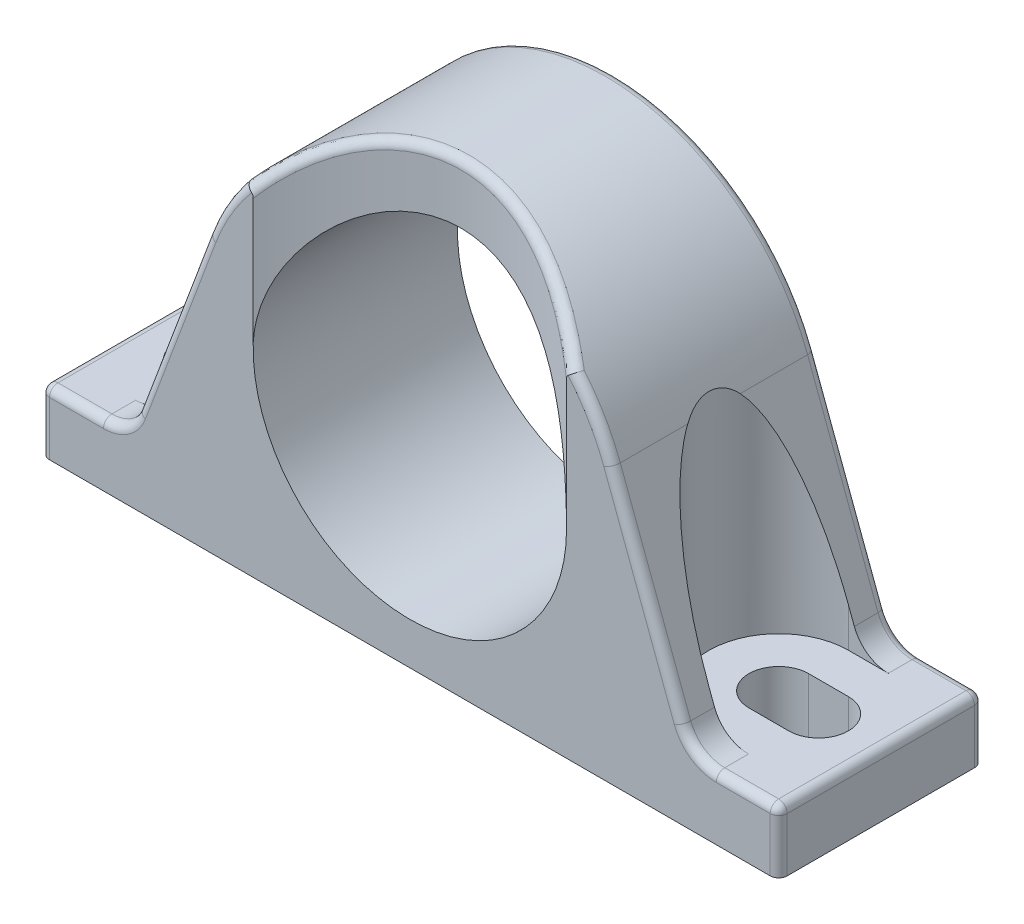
ISO-10303-21;
HEADER;
FILE_DESCRIPTION(('STEP AP214'),'2;1');
FILE_NAME('part.step','',(''),(''),'','','');
FILE_SCHEMA(('AUTOMOTIVE_DESIGN { 1 0 10303 214 1 1 1 1 }'));
ENDSEC;
DATA;
#1=APPLICATION_CONTEXT('core data for automotive mechanical design processes');
#2=APPLICATION_PROTOCOL_DEFINITION('international standard','automotive_design',2000,#1);
#3=PRODUCT_CONTEXT('',#1,'mechanical');
#4=PRODUCT('Part','Part','',(#3));
#5=PRODUCT_RELATED_PRODUCT_CATEGORY('part','',(#4));
#6=PRODUCT_DEFINITION_FORMATION('','',#4);
#7=PRODUCT_DEFINITION_CONTEXT('part definition',#1,'design');
#8=PRODUCT_DEFINITION('design','',#6,#7);
#9=PRODUCT_DEFINITION_SHAPE('','',#8);
#10=(LENGTH_UNIT() NAMED_UNIT(*) SI_UNIT(.MILLI.,.METRE.));
#11=(NAMED_UNIT(*) PLANE_ANGLE_UNIT() SI_UNIT($,.RADIAN.));
#12=(NAMED_UNIT(*) SI_UNIT($,.STERADIAN.) SOLID_ANGLE_UNIT());
#13=UNCERTAINTY_MEASURE_WITH_UNIT(LENGTH_MEASURE(1.E-05),#10,'distance_accuracy_value','');
#14=(GEOMETRIC_REPRESENTATION_CONTEXT(3) GLOBAL_UNCERTAINTY_ASSIGNED_CONTEXT((#13)) GLOBAL_UNIT_ASSIGNED_CONTEXT((#10,
#11,#12)) REPRESENTATION_CONTEXT('',''));
#15=CARTESIAN_POINT('',(0.,0.,0.));
#16=DIRECTION('',(0.,0.,1.));
#17=DIRECTION('',(1.,0.,0.));
#18=AXIS2_PLACEMENT_3D('',#15,#16,#17);
#19=CARTESIAN_POINT('',(0.,0.,28.575));
#20=DIRECTION('',(0.,0.,-1.));
#21=DIRECTION('',(-1.,0.,0.));
#22=AXIS2_PLACEMENT_3D('',#19,#20,#21);
#23=CYLINDRICAL_SURFACE('',#22,60.325);
#24=DIRECTION('',(0.,0.,-1.));
#25=VECTOR('',#24,1.);
#26=CARTESIAN_POINT('',(56.4948100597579,21.1528263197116,28.575));
#27=LINE('',#26,#25);
#28=CARTESIAN_POINT('',(56.4948100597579,21.1528263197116,-7.335143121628));
#29=VERTEX_POINT('',#28);
#30=CARTESIAN_POINT('',(56.4948100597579,21.1528263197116,-26.19375));
#31=VERTEX_POINT('',#30);
#32=EDGE_CURVE('E833',#29,#31,#27,.T.);
#33=ORIENTED_EDGE('',*,*,#32,.T.);
#34=CARTESIAN_POINT('',(0.,0.,-26.19375));
#35=DIRECTION('',(0.,0.,1.));
#36=DIRECTION('',(1.,0.,0.));
#37=AXIS2_PLACEMENT_3D('',#34,#35,#36);
#38=CIRCLE('',#37,60.325);
#39=CARTESIAN_POINT('',(-56.4948100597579,21.1528263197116,-26.19375));
#40=VERTEX_POINT('',#39);
#41=EDGE_CURVE('E483',#31,#40,#38,.T.);
#42=ORIENTED_EDGE('',*,*,#41,.T.);
#43=DIRECTION('',(0.,0.,-1.));
#44=VECTOR('',#43,1.);
#45=CARTESIAN_POINT('',(-56.4948100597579,21.1528263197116,28.575));
#46=LINE('',#45,#44);
#47=CARTESIAN_POINT('',(-56.4948100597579,21.1528263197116,-7.33514312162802));
#48=VERTEX_POINT('',#47);
#49=EDGE_CURVE('E675',#48,#40,#46,.T.);
#50=ORIENTED_EDGE('',*,*,#49,.F.);
#51=CARTESIAN_POINT('',(-56.4948100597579,21.1528263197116,-7.33514312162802));
#52=CARTESIAN_POINT('',(-56.410671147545,21.3775883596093,-7.1271309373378));
#53=CARTESIAN_POINT('',(-56.3274774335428,21.595652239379,-6.91124479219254));
#54=CARTESIAN_POINT('',(-56.1643649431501,22.0163632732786,-6.46298036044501));
#55=CARTESIAN_POINT('',(-56.0844527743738,22.2189799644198,-6.23057114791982));
#56=CARTESIAN_POINT('',(-55.9289357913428,22.60761133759,-5.74717652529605));
#57=CARTESIAN_POINT('',(-55.8533755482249,22.7934625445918,-5.49604443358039));
#58=CARTESIAN_POINT('',(-55.7092480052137,23.1434890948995,-4.97739638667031));
#59=CARTESIAN_POINT('',(-55.640675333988,23.3076811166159,-4.70989327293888));
#60=CARTESIAN_POINT('',(-55.5270414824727,23.5768858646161,-4.22178173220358));
#61=CARTESIAN_POINT('',(-55.4801782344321,23.6868684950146,-4.00432761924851));
#62=CARTESIAN_POINT('',(-55.392741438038,23.890628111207,-3.56075398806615));
#63=CARTESIAN_POINT('',(-55.3521663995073,23.9844089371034,-3.33463653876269));
#64=CARTESIAN_POINT('',(-55.2783439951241,24.1540649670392,-2.8754829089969));
#65=CARTESIAN_POINT('',(-55.2450723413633,24.2299995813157,-2.64247267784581));
#66=CARTESIAN_POINT('',(-55.1865155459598,24.363074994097,-2.17014429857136));
#67=CARTESIAN_POINT('',(-55.1612302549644,24.4202161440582,-1.93082626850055));
#68=CARTESIAN_POINT('',(-55.1191836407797,24.514973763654,-1.44580546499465));
#69=CARTESIAN_POINT('',(-55.102484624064,24.5524475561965,-1.20006925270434));
#70=CARTESIAN_POINT('',(-55.0783753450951,24.6064844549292,-0.705842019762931));
#71=CARTESIAN_POINT('',(-55.0709651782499,24.6230473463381,-0.457350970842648));
#72=CARTESIAN_POINT('',(-55.0656572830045,24.6349153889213,0.0403825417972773));
#73=CARTESIAN_POINT('',(-55.0677649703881,24.630208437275,0.289625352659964));
#74=CARTESIAN_POINT('',(-55.081441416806,24.599608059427,0.78653172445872));
#75=CARTESIAN_POINT('',(-55.0930096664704,24.5737157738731,1.03419536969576));
#76=CARTESIAN_POINT('',(-55.1237767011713,24.5046146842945,1.50331644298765));
#77=CARTESIAN_POINT('',(-55.1421791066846,24.4632101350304,1.72509561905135));
#78=CARTESIAN_POINT('',(-55.1860696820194,24.3640365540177,2.1643260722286));
#79=CARTESIAN_POINT('',(-55.2115604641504,24.3062614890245,2.38177572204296));
#80=CARTESIAN_POINT('',(-55.2690586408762,24.175232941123,2.81106024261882));
#81=CARTESIAN_POINT('',(-55.3010660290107,24.1019794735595,3.02289511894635));
#82=CARTESIAN_POINT('',(-55.3709432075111,23.9410103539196,3.44001615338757));
#83=CARTESIAN_POINT('',(-55.4088142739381,23.8532915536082,3.64530087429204));
#84=CARTESIAN_POINT('',(-55.5037488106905,23.6317280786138,4.1185110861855));
#85=CARTESIAN_POINT('',(-55.562914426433,23.4924348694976,4.38348182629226));
#86=CARTESIAN_POINT('',(-55.688839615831,23.1923562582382,4.89899421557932));
#87=CARTESIAN_POINT('',(-55.7556022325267,23.0315622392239,5.1495300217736));
#88=CARTESIAN_POINT('',(-55.9648083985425,22.5206618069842,5.87885227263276));
#89=CARTESIAN_POINT('',(-56.1162033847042,22.1419612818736,6.33550978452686));
#90=CARTESIAN_POINT('',(-56.3096774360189,21.6410783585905,6.86062063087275));
#91=CARTESIAN_POINT('',(-56.3464110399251,21.545266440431,6.95785782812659));
#92=CARTESIAN_POINT('',(-56.4202955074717,21.3510317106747,7.14893373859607));
#93=CARTESIAN_POINT('',(-56.4574449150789,21.252616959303,7.24278120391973));
#94=CARTESIAN_POINT('',(-56.4948100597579,21.1528263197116,7.33514312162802));
#95=B_SPLINE_CURVE_WITH_KNOTS('',3,(#51,#52,#53,#54,#55,#56,#57,#58,#59,#60,#61,#62,#63,#64,#65,
#66,#67,#68,#69,#70,#71,#72,#73,#74,#75,#76,#77,#78,#79,#80,#81,#82,#83,#84,#85,#86,#87,#88,#89,
#90,#91,#92,#93,#94),.UNSPECIFIED.,.F.,.F.,(4,2,2,2,2,2,2,2,2,2,2,2,2,2,2,2,2,2,2,2,2,4),(0.,
0.952865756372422,1.90756447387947,2.87074431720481,3.8331780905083,4.57694279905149,
5.32053098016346,6.0616075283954,6.80267021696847,7.54903712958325,8.29541170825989,
9.04221103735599,9.78897016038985,10.4672986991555,11.1458775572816,11.824455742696,
12.5031818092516,13.4171957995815,14.3315772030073,16.1598161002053,16.5839127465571,
17.006822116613),.UNSPECIFIED.);
#96=CARTESIAN_POINT('',(-56.4948100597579,21.1528263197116,7.33514312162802));
#97=VERTEX_POINT('',#96);
#98=EDGE_CURVE('E832',#48,#97,#95,.T.);
#99=ORIENTED_EDGE('',*,*,#98,.T.);
#100=CARTESIAN_POINT('',(-56.4948100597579,21.1528263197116,26.19375));
#101=VERTEX_POINT('',#100);
#102=EDGE_CURVE('E826',#101,#97,#46,.T.);
#103=ORIENTED_EDGE('',*,*,#102,.F.);
#104=CARTESIAN_POINT('',(0.,0.,26.19375));
#105=DIRECTION('',(0.,0.,1.));
#106=DIRECTION('',(1.,0.,0.));
#107=AXIS2_PLACEMENT_3D('',#104,#105,#106);
#108=CIRCLE('',#107,60.325);
#109=CARTESIAN_POINT('',(-46.4217523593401,38.5243628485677,26.19375));
#110=VERTEX_POINT('',#109);
#111=EDGE_CURVE('E414',#101,#110,#108,.F.);
#112=ORIENTED_EDGE('',*,*,#111,.T.);
#113=CARTESIAN_POINT('',(57.1985697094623,19.1684440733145,35.0651462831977));
#114=CARTESIAN_POINT('',(57.045420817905,19.6254398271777,36.5458274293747));
#115=CARTESIAN_POINT('',(55.631436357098,19.3553892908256,37.1394914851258));
#116=CARTESIAN_POINT('',(54.2174518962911,19.0853387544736,37.7331555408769));
#117=CARTESIAN_POINT('',(53.2367553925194,18.4117949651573,36.7285215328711));
#118=CARTESIAN_POINT('',(56.9267947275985,19.9793762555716,34.7977142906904));
#119=CARTESIAN_POINT('',(56.7637947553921,20.4442583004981,36.2670908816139));
#120=CARTESIAN_POINT('',(55.3601735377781,20.1647742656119,36.8615910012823));
#121=CARTESIAN_POINT('',(53.9573504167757,19.8828876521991,37.4569280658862));
#122=CARTESIAN_POINT('',(52.9838046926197,19.1907166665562,36.4693838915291));
#123=CARTESIAN_POINT('',(56.639107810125,20.7806365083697,34.5185558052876));
#124=CARTESIAN_POINT('',(56.4659676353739,21.2529934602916,35.9762271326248));
#125=CARTESIAN_POINT('',(55.0735058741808,20.9631205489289,36.5719994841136));
#126=CARTESIAN_POINT('',(53.6819645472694,20.6708370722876,37.1686915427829));
#127=CARTESIAN_POINT('',(52.7160441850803,19.9603482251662,36.1988834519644));
#128=CARTESIAN_POINT('',(56.0331009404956,22.3632608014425,33.9402733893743));
#129=CARTESIAN_POINT('',(55.8399047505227,22.847668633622,35.3745859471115));
#130=CARTESIAN_POINT('',(54.4706613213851,22.5374949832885,35.9730952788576));
#131=CARTESIAN_POINT('',(53.1023235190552,22.224962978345,36.5724990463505));
#132=CARTESIAN_POINT('',(52.1520119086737,21.4805005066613,35.6385363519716));
#133=CARTESIAN_POINT('',(55.7147894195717,23.1446302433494,33.6411549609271));
#134=CARTESIAN_POINT('',(55.5118166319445,23.6335626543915,35.063919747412));
#135=CARTESIAN_POINT('',(54.1544925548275,23.3135292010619,35.6637880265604));
#136=CARTESIAN_POINT('',(52.7982074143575,22.9910931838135,36.264653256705));
#137=CARTESIAN_POINT('',(51.8557479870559,22.2310264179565,35.3486950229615));
#138=CARTESIAN_POINT('',(55.0489665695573,24.6864565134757,33.0266521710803));
#139=CARTESIAN_POINT('',(54.826896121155,25.1818677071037,34.4265639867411));
#140=CARTESIAN_POINT('',(53.4941855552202,24.8425810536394,35.0293310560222));
#141=CARTESIAN_POINT('',(52.1625105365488,24.5008931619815,35.6330944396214));
#142=CARTESIAN_POINT('',(51.2360428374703,23.7119911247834,34.753250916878));
#143=CARTESIAN_POINT('',(54.7014901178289,25.4469369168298,32.7112874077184));
#144=CARTESIAN_POINT('',(54.4702272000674,25.9442898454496,34.0999803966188));
#145=CARTESIAN_POINT('',(53.1500807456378,25.5956247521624,34.704200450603));
#146=CARTESIAN_POINT('',(51.831084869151,25.2445718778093,35.3094863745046));
#147=CARTESIAN_POINT('',(50.9126340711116,24.4424525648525,34.4476671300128));
#148=CARTESIAN_POINT('',(53.9779148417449,26.9478093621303,32.067037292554));
#149=CARTESIAN_POINT('',(53.7288841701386,27.4467584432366,33.4336631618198));
#150=CARTESIAN_POINT('',(52.4345391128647,27.079832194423,34.0409212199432));
#151=CARTESIAN_POINT('',(51.1413439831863,26.7105219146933,34.6492458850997));
#152=CARTESIAN_POINT('',(50.2391766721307,25.8840800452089,33.8233983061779));
#153=CARTESIAN_POINT('',(53.6018138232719,27.6881998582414,31.7381509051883));
#154=CARTESIAN_POINT('',(53.3443244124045,28.1868207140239,33.0939946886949));
#155=CARTESIAN_POINT('',(52.0631001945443,27.8109942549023,33.7027715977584));
#156=CARTESIAN_POINT('',(50.7831377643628,27.4328073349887,34.3126780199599));
#157=CARTESIAN_POINT('',(49.8891259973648,26.5952446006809,33.5047122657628));
#158=CARTESIAN_POINT('',(52.4312897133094,29.8799419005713,30.7351580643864));
#159=CARTESIAN_POINT('',(52.1514568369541,30.3710749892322,32.0609867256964));
#160=CARTESIAN_POINT('',(50.9085643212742,29.9728076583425,32.6728230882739));
#161=CARTESIAN_POINT('',(49.6706596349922,29.5651965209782,33.289101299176));
#162=CARTESIAN_POINT('',(48.7996773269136,28.7004705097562,32.5328270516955));
#163=CARTESIAN_POINT('',(51.5949255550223,31.3012185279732,30.0449800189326));
#164=CARTESIAN_POINT('',(51.3009924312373,31.7860495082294,31.3508372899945));
#165=CARTESIAN_POINT('',(50.0855260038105,31.3711466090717,31.9657951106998));
#166=CARTESIAN_POINT('',(48.8757755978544,30.9473815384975,32.5854375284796));
#167=CARTESIAN_POINT('',(48.0212432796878,30.0656441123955,31.8640547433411));
#168=CARTESIAN_POINT('',(49.8150642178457,34.0626589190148,28.6421062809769));
#169=CARTESIAN_POINT('',(49.4961404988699,34.5288433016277,29.9100403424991));
#170=CARTESIAN_POINT('',(48.3377091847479,34.0828640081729,30.5315628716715));
#171=CARTESIAN_POINT('',(47.1849757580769,33.6280383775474,31.1577668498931));
#172=CARTESIAN_POINT('',(46.3646626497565,32.7180802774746,30.5046908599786));
#173=CARTESIAN_POINT('',(48.8715279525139,35.4027928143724,27.9294024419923));
#174=CARTESIAN_POINT('',(48.5423677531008,35.8572298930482,29.1795009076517));
#175=CARTESIAN_POINT('',(47.4128935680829,35.3962111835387,29.8043513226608));
#176=CARTESIAN_POINT('',(46.2896584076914,34.9270556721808,30.4338672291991));
#177=CARTESIAN_POINT('',(45.4864796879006,34.0053141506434,29.8140913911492));
#178=CARTESIAN_POINT('',(46.8585059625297,38.0287016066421,26.4831932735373));
#179=CARTESIAN_POINT('',(46.5124063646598,38.454734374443,27.6995557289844));
#180=CARTESIAN_POINT('',(45.4430633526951,37.9657770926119,28.3310140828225));
#181=CARTESIAN_POINT('',(44.3801898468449,37.468378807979,28.9673123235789));
#182=CARTESIAN_POINT('',(43.6128880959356,36.5275686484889,28.4127361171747));
#183=CARTESIAN_POINT('',(45.7867140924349,39.3126427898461,25.7495742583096));
#184=CARTESIAN_POINT('',(45.4343595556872,39.7228938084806,26.9498827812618));
#185=CARTESIAN_POINT('',(44.3958595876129,39.2201143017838,27.5848230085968));
#186=CARTESIAN_POINT('',(43.3642338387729,38.7097666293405,28.2243913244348));
#187=CARTESIAN_POINT('',(42.6153330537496,37.7608279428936,27.7018701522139));
#188=CARTESIAN_POINT('',(43.5366073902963,41.7907895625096,24.2934898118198));
#189=CARTESIAN_POINT('',(43.1756541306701,42.1662786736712,25.4640176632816));
#190=CARTESIAN_POINT('',(42.2002574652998,41.6382308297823,26.1056196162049));
#191=CARTESIAN_POINT('',(41.2316930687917,41.1026555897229,26.751827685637));
#192=CARTESIAN_POINT('',(40.5210782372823,40.1411531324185,26.2909458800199));
#193=CARTESIAN_POINT('',(42.3582996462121,42.9850011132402,23.5710236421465));
#194=CARTESIAN_POINT('',(41.9953333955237,43.3424172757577,24.727540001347));
#195=CARTESIAN_POINT('',(41.051865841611,42.8020161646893,25.3726064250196));
#196=CARTESIAN_POINT('',(40.1154508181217,42.2550439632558,26.0219026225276));
#197=CARTESIAN_POINT('',(39.4243850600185,41.2882247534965,25.5908868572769));
#198=CARTESIAN_POINT('',(39.8968409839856,45.2788892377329,22.1523327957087));
#199=CARTESIAN_POINT('',(39.533842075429,45.5981287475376,23.2831244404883));
#200=CARTESIAN_POINT('',(38.6553508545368,45.0353808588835,23.9345825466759));
#201=CARTESIAN_POINT('',(37.7838714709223,44.4660971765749,24.5902501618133));
#202=CARTESIAN_POINT('',(37.1334174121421,43.4915646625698,24.2161964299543));
#203=CARTESIAN_POINT('',(38.6136839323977,46.3785602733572,21.4561096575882));
#204=CARTESIAN_POINT('',(38.2528073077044,46.6786689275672,22.5747594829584));
#205=CARTESIAN_POINT('',(37.4072216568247,46.1049546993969,23.2295735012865));
#206=CARTESIAN_POINT('',(36.5686836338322,45.5257048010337,23.8880999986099));
#207=CARTESIAN_POINT('',(35.9391372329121,44.5478276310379,23.5415665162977));
#208=CARTESIAN_POINT('',(35.9449427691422,48.4762428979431,20.10461558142));
#209=CARTESIAN_POINT('',(35.5923105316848,48.737061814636,21.20123092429));
#210=CARTESIAN_POINT('',(34.8133971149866,48.1437509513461,21.8620366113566));
#211=CARTESIAN_POINT('',(34.0414830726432,47.5449345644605,22.5265357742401));
#212=CARTESIAN_POINT('',(33.4552443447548,46.5627069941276,22.2319887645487));
#213=CARTESIAN_POINT('',(34.5593733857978,49.4742690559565,19.4493387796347));
#214=CARTESIAN_POINT('',(34.2128055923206,49.7159365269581,20.5355253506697));
#215=CARTESIAN_POINT('',(33.46771580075,49.1129877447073,21.1995026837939));
#216=CARTESIAN_POINT('',(32.7294479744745,48.5055551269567,21.8665849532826));
#217=CARTESIAN_POINT('',(32.1656453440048,47.5213373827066,21.5970352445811));
#218=CARTESIAN_POINT('',(31.8929050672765,51.2261602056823,18.2831105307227));
#219=CARTESIAN_POINT('',(31.560391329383,51.4326898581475,19.3515598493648));
#220=CARTESIAN_POINT('',(30.8796102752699,50.8133929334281,20.0210293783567));
#221=CARTESIAN_POINT('',(30.2038422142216,50.1908039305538,20.6927827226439));
#222=CARTESIAN_POINT('',(29.6838678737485,49.2040749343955,20.4669773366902));
#223=CARTESIAN_POINT('',(30.6250167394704,51.9945806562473,17.7648685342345));
#224=CARTESIAN_POINT('',(30.3006957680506,52.1852486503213,18.8257093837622));
#225=CARTESIAN_POINT('',(29.6495952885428,51.5588316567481,19.4976236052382));
#226=CARTESIAN_POINT('',(29.0032635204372,50.929764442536,20.1714168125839));
#227=CARTESIAN_POINT('',(28.5037988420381,49.9421629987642,19.9648085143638));
#228=CARTESIAN_POINT('',(28.0197222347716,53.4436339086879,16.7780929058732));
#229=CARTESIAN_POINT('',(27.7146359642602,53.603080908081,17.8252447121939));
#230=CARTESIAN_POINT('',(27.1231919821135,52.9640060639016,18.5014041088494));
#231=CARTESIAN_POINT('',(26.5364926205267,52.3222901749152,19.1794358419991));
#232=CARTESIAN_POINT('',(26.0789580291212,51.3340167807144,19.0086375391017));
#233=CARTESIAN_POINT('',(26.6823159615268,54.1242665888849,16.3095593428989));
#234=CARTESIAN_POINT('',(26.3879658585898,54.2689865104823,17.3502232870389));
#235=CARTESIAN_POINT('',(25.8268035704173,53.6237416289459,18.0285904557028));
#236=CARTESIAN_POINT('',(25.2700162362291,52.9764750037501,18.7084172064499));
#237=CARTESIAN_POINT('',(24.8341861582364,51.9877823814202,18.554635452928));
#238=CARTESIAN_POINT('',(23.9458658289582,55.3892472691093,15.4320403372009));
#239=CARTESIAN_POINT('',(23.6756943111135,55.5055346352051,16.4612270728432));
#240=CARTESIAN_POINT('',(23.175166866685,54.8495153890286,17.143324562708));
#241=CARTESIAN_POINT('',(22.6789847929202,54.1914867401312,17.8268738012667));
#242=CARTESIAN_POINT('',(22.2872741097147,53.2028296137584,17.7043325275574));
#243=CARTESIAN_POINT('',(22.5469533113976,55.9737889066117,15.0229353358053));
#244=CARTESIAN_POINT('',(22.2897854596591,56.0769650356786,16.0467253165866));
#245=CARTESIAN_POINT('',(21.8200440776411,55.415742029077,16.730751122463));
#246=CARTESIAN_POINT('',(21.3541455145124,54.75308649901,17.4158266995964));
#247=CARTESIAN_POINT('',(20.9852561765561,53.7642972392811,17.3079158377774));
#248=CARTESIAN_POINT('',(19.6920251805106,57.0407729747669,14.2717308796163));
#249=CARTESIAN_POINT('',(19.4634302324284,57.1191693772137,15.2861713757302));
#250=CARTESIAN_POINT('',(19.0551993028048,56.4490589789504,15.9733524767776));
#251=CARTESIAN_POINT('',(18.6507919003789,55.7775159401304,16.6615839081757));
#252=CARTESIAN_POINT('',(18.3280724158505,54.7891635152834,16.5800098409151));
#253=CARTESIAN_POINT('',(18.2360294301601,57.5232505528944,13.9296083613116));
#254=CARTESIAN_POINT('',(18.0224235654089,57.5905253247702,14.9397100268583));
#255=CARTESIAN_POINT('',(17.6454963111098,56.916183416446,15.6285039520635));
#256=CARTESIAN_POINT('',(17.2717463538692,56.24091717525,16.3179825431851));
#257=CARTESIAN_POINT('',(16.9729250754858,55.2525959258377,16.2484981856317));
#258=CARTESIAN_POINT('',(15.849920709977,58.2131992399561,13.4382210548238));
#259=CARTESIAN_POINT('',(15.6613761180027,58.264346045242,14.4422292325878));
#260=CARTESIAN_POINT('',(15.3356998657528,57.5840658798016,15.1332842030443));
#261=CARTESIAN_POINT('',(15.0112225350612,56.9034424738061,15.8245941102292));
#262=CARTESIAN_POINT('',(14.7520883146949,55.9153097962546,15.7723511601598));
#263=CARTESIAN_POINT('',(14.934692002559,58.4547822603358,13.2656001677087));
#264=CARTESIAN_POINT('',(14.7562792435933,58.5001901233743,14.26753040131));
#265=CARTESIAN_POINT('',(14.4498442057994,57.8178933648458,14.9593386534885));
#266=CARTESIAN_POINT('',(14.144433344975,57.135352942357,15.6513286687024));
#267=CARTESIAN_POINT('',(13.9002522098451,56.1473566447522,15.6050840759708));
#268=CARTESIAN_POINT('',(13.0886862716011,58.8956023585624,12.9499003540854));
#269=CARTESIAN_POINT('',(12.9312594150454,58.9303965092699,13.9481276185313));
#270=CARTESIAN_POINT('',(12.6632543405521,58.2445252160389,14.6412435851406));
#271=CARTESIAN_POINT('',(12.3962689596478,57.5584095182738,15.3345416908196));
#272=CARTESIAN_POINT('',(12.1821086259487,56.5707759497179,15.2991756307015));
#273=CARTESIAN_POINT('',(12.157911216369,59.0948447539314,12.8068177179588));
#274=CARTESIAN_POINT('',(12.0111565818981,59.1248582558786,13.8033508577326));
#275=CARTESIAN_POINT('',(11.7625220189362,58.4373347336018,14.4970903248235));
#276=CARTESIAN_POINT('',(11.5147219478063,57.7496533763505,15.1909479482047));
#277=CARTESIAN_POINT('',(11.3158029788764,56.7621535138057,15.1605306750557));
#278=CARTESIAN_POINT('',(10.2831231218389,59.4497564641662,12.5515028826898));
#279=CARTESIAN_POINT('',(10.1583539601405,59.4711457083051,13.5450889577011));
#280=CARTESIAN_POINT('',(9.94838231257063,58.7807652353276,14.2398818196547));
#281=CARTESIAN_POINT('',(9.73924622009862,58.0902264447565,14.9347933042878));
#282=CARTESIAN_POINT('',(9.57087061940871,57.1030555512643,14.9131343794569));
#283=CARTESIAN_POINT('',(9.33910469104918,59.6054074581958,12.4392836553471));
#284=CARTESIAN_POINT('',(9.22545090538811,59.6230319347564,13.4315589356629));
#285=CARTESIAN_POINT('',(9.03496976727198,58.931368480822,14.1268396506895));
#286=CARTESIAN_POINT('',(8.84512287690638,58.2396151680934,14.8221878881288));
#287=CARTESIAN_POINT('',(8.69223888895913,57.2525624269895,14.8043956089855));
#288=CARTESIAN_POINT('',(7.44141305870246,59.8719407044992,12.2468871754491));
#289=CARTESIAN_POINT('',(7.35053325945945,59.8830439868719,13.2369683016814));
#290=CARTESIAN_POINT('',(7.19890365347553,59.1892463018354,13.9330411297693));
#291=CARTESIAN_POINT('',(7.04790855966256,58.4953602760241,14.6291803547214));
#292=CARTESIAN_POINT('',(6.9259893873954,57.5085746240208,14.6179662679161));
#293=CARTESIAN_POINT('',(6.48774094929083,59.9828279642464,12.166706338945));
#294=CARTESIAN_POINT('',(6.40830917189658,59.9912349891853,13.1558591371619));
#295=CARTESIAN_POINT('',(6.27625113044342,59.2965257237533,13.8522811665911));
#296=CARTESIAN_POINT('',(6.14461695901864,58.6017807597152,14.5487300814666));
#297=CARTESIAN_POINT('',(6.03837263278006,57.6150847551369,14.5402722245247));
#298=CARTESIAN_POINT('',(4.11651417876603,60.2011225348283,12.0087559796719));
#299=CARTESIAN_POINT('',(4.06625041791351,60.2041349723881,12.9961439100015));
#300=CARTESIAN_POINT('',(3.98223388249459,59.5077126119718,13.6931939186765));
#301=CARTESIAN_POINT('',(3.89913890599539,58.8112005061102,14.3903115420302));
#302=CARTESIAN_POINT('',(3.83138703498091,57.8247624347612,14.3872206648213));
#303=CARTESIAN_POINT('',(2.69492546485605,60.281578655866,11.9504243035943));
#304=CARTESIAN_POINT('',(2.66179306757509,60.282647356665,12.9371258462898));
#305=CARTESIAN_POINT('',(2.60700542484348,59.5855432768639,13.6344467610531));
#306=CARTESIAN_POINT('',(2.55242888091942,58.8884336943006,14.3317717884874));
#307=CARTESIAN_POINT('',(2.50826355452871,57.9020426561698,14.3306981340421));
#308=CARTESIAN_POINT('',(-0.151788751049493,60.3416154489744,11.9069064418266));
#309=CARTESIAN_POINT('',(-0.149812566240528,60.3412036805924,12.8931185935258));
#310=CARTESIAN_POINT('',(-0.146839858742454,59.6436214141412,13.5906185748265));
#311=CARTESIAN_POINT('',(-0.143649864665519,58.946035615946,14.2881212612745));
#312=CARTESIAN_POINT('',(-0.141275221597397,57.9597095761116,14.2885299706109));
#313=CARTESIAN_POINT('',(-1.57691496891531,60.3211736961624,11.9217365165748));
#314=CARTESIAN_POINT('',(-1.55769634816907,60.3212563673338,12.9081228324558));
#315=CARTESIAN_POINT('',(-1.52545736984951,59.6238471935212,13.6055539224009));
#316=CARTESIAN_POINT('',(-1.49372386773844,58.9264129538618,14.3030039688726));
#317=CARTESIAN_POINT('',(-1.46769118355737,57.9400747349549,14.3029000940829));
#318=CARTESIAN_POINT('',(-4.42040922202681,60.1796752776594,12.0242547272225));
#319=CARTESIAN_POINT('',(-4.36622324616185,60.1832462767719,13.0117942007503));
#320=CARTESIAN_POINT('',(-4.27623247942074,59.4869626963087,13.7088049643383));
#321=CARTESIAN_POINT('',(-4.18674481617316,58.7906539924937,14.4058346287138));
#322=CARTESIAN_POINT('',(-4.11423302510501,57.8041617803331,14.4022387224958));
#323=CARTESIAN_POINT('',(-5.83877126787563,60.0585418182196,12.1119984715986));
#324=CARTESIAN_POINT('',(-5.76758980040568,60.065036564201,13.1005716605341));
#325=CARTESIAN_POINT('',(-5.64838434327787,59.369778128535,13.7971766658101));
#326=CARTESIAN_POINT('',(-5.53038523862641,58.6743731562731,14.4938920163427));
#327=CARTESIAN_POINT('',(-5.43435333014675,57.6878099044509,14.4872611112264));
#328=CARTESIAN_POINT('',(-8.65667609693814,59.7175180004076,12.3584316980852));
#329=CARTESIAN_POINT('',(-8.55143124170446,59.7323764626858,13.3498029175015));
#330=CARTESIAN_POINT('',(-8.37466999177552,59.0398420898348,14.0453956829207));
#331=CARTESIAN_POINT('',(-8.19911245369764,58.3471625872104,14.7410975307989));
#332=CARTESIAN_POINT('',(-8.05707817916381,57.3602475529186,14.7260512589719));
#333=CARTESIAN_POINT('',(-10.056219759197,59.4976322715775,12.5171178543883));
#334=CARTESIAN_POINT('',(-9.93460290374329,59.5177602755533,13.5103805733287));
#335=CARTESIAN_POINT('',(-9.72880461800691,58.8270950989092,14.2052396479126));
#336=CARTESIAN_POINT('',(-9.52486683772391,58.1360697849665,14.9003685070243));
#337=CARTESIAN_POINT('',(-9.35968354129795,57.1490415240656,14.8798157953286));
#338=CARTESIAN_POINT('',(-12.8214674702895,58.9634750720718,12.9012569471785));
#339=CARTESIAN_POINT('',(-12.6674859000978,58.9965763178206,13.8989574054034));
#340=CARTESIAN_POINT('',(-12.4046295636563,58.3102115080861,14.5922324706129));
#341=CARTESIAN_POINT('',(-12.1436202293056,57.6234906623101,15.2857739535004));
#342=CARTESIAN_POINT('',(-11.9333985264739,56.6359694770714,15.2520408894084));
#343=CARTESIAN_POINT('',(-14.1872780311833,58.6495577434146,13.1264593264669));
#344=CARTESIAN_POINT('',(-14.0179402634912,58.6900965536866,14.1268936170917));
#345=CARTESIAN_POINT('',(-13.7264218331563,58.0064178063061,14.8191287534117));
#346=CARTESIAN_POINT('',(-13.4373328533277,57.3220908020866,15.5118459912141));
#347=CARTESIAN_POINT('',(-13.2046072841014,56.33444362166,15.4702586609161));
#348=CARTESIAN_POINT('',(-16.8818740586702,57.9314453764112,13.6392415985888));
#349=CARTESIAN_POINT('',(-16.6825320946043,57.9891692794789,14.6457530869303));
#350=CARTESIAN_POINT('',(-16.3345792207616,57.311341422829,15.3358589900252));
#351=CARTESIAN_POINT('',(-15.9890590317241,56.6328660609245,16.026446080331));
#352=CARTESIAN_POINT('',(-15.7125642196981,55.644677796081,15.9671370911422));
#353=CARTESIAN_POINT('',(-18.2106590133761,57.527249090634,13.926822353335));
#354=CARTESIAN_POINT('',(-17.9972220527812,57.5943929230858,14.9369157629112));
#355=CARTESIAN_POINT('',(-17.6209438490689,56.9200575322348,15.6256938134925));
#356=CARTESIAN_POINT('',(-17.2475999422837,56.2447179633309,16.3152115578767));
#357=CARTESIAN_POINT('',(-16.9493119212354,55.2564366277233,16.2457985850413));
#358=CARTESIAN_POINT('',(-20.8239884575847,56.6336846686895,14.5588614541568));
#359=CARTESIAN_POINT('',(-20.5834276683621,56.7217882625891,15.5766974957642));
#360=CARTESIAN_POINT('',(-20.1513599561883,56.0548433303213,16.2628302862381));
#361=CARTESIAN_POINT('',(-19.7222322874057,55.3868939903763,16.949702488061));
#362=CARTESIAN_POINT('',(-19.3816311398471,54.398144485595,16.8582351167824));
#363=CARTESIAN_POINT('',(-22.1085351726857,56.1443208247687,14.9033169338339));
#364=CARTESIAN_POINT('',(-21.8554109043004,56.2435799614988,15.9255873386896));
#365=CARTESIAN_POINT('',(-21.395413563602,55.580917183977,16.6101290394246));
#366=CARTESIAN_POINT('',(-20.9387685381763,54.9168448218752,17.2956964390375));
#367=CARTESIAN_POINT('',(-20.5772047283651,53.9280976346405,17.1920073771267));
#368=CARTESIAN_POINT('',(-24.6278151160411,55.0857832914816,15.6430606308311));
#369=CARTESIAN_POINT('',(-24.3509557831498,55.2092307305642,16.6747715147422));
#370=CARTESIAN_POINT('',(-23.8359055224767,54.5554843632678,17.3561876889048));
#371=CARTESIAN_POINT('',(-23.3242182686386,53.9003259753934,18.0386310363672));
#372=CARTESIAN_POINT('',(-22.9219887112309,52.911344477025,17.9088080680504));
#373=CARTESIAN_POINT('',(-25.8625466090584,54.51660682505,16.0383506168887));
#374=CARTESIAN_POINT('',(-25.5748881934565,54.6526622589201,17.0753614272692));
#375=CARTESIAN_POINT('',(-25.0323422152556,54.0039749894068,17.7549493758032));
#376=CARTESIAN_POINT('',(-24.4934824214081,53.3534365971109,18.4358647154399));
#377=CARTESIAN_POINT('',(-24.0711974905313,52.3646355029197,18.2918382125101));
#378=CARTESIAN_POINT('',(-28.348095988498,53.2685262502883,16.8976595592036));
#379=CARTESIAN_POINT('',(-28.0401645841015,53.4320540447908,17.94626293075));
#380=CARTESIAN_POINT('',(-27.4415703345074,52.7942181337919,18.6221020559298));
#381=CARTESIAN_POINT('',(-26.8471139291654,52.1543046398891,19.2994298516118));
#382=CARTESIAN_POINT('',(-26.3845872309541,51.1658212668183,19.1244958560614));
#383=CARTESIAN_POINT('',(-29.5956756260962,52.5851666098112,17.3643381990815));
#384=CARTESIAN_POINT('',(-29.2784677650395,52.7632448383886,18.4195357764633));
#385=CARTESIAN_POINT('',(-28.651268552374,52.1316292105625,19.0931933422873));
#386=CARTESIAN_POINT('',(-28.0284817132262,51.4973909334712,19.7686952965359));
#387=CARTESIAN_POINT('',(-27.5457542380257,50.5094363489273,19.5767005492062));
#388=CARTESIAN_POINT('',(-32.0264654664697,51.1410799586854,18.3396933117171));
#389=CARTESIAN_POINT('',(-31.6928691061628,51.3496733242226,19.4087675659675));
#390=CARTESIAN_POINT('',(-31.0092306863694,50.7308081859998,20.0782085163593));
#391=CARTESIAN_POINT('',(-30.3300241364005,50.1093115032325,20.7494996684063));
#392=CARTESIAN_POINT('',(-29.808177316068,49.1223531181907,20.5218052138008));
#393=CARTESIAN_POINT('',(-33.2096738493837,50.3803507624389,18.8483709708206));
#394=CARTESIAN_POINT('',(-32.8691859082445,50.6043566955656,19.9250747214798));
#395=CARTESIAN_POINT('',(-32.1574928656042,49.992573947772,20.5921336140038));
#396=CARTESIAN_POINT('',(-31.4504000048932,49.377602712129,21.2613836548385));
#397=CARTESIAN_POINT('',(-30.9094316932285,48.3916527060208,21.014706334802));
#398=CARTESIAN_POINT('',(-35.5103851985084,48.7860547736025,19.9004569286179));
#399=CARTESIAN_POINT('',(-35.1585414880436,49.0418684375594,20.9931984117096));
#400=CARTESIAN_POINT('',(-34.3913914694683,48.4445766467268,21.6556477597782));
#401=CARTESIAN_POINT('',(-33.6288702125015,47.8440780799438,22.3202996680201));
#402=CARTESIAN_POINT('',(-33.0507860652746,46.860289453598,22.0341620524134));
#403=CARTESIAN_POINT('',(-36.6278162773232,47.9524106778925,20.4439019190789));
#404=CARTESIAN_POINT('',(-36.2716228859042,48.2240658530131,21.545375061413));
#405=CARTESIAN_POINT('',(-35.476959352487,47.6347376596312,22.2052744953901));
#406=CARTESIAN_POINT('',(-34.6869942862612,47.0416451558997,22.8676884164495));
#407=CARTESIAN_POINT('',(-34.0908191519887,46.0595523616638,22.5607522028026));
#408=CARTESIAN_POINT('',(-38.7938725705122,46.2176023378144,21.5571393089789));
#409=CARTESIAN_POINT('',(-38.4316437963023,46.5213996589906,22.6769589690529));
#410=CARTESIAN_POINT('',(-37.5825638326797,45.9483454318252,23.3319156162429));
#411=CARTESIAN_POINT('',(-36.738208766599,45.3715082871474,23.9893999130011));
#412=CARTESIAN_POINT('',(-36.1068452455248,44.3932232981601,23.6394627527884));
#413=CARTESIAN_POINT('',(-39.8424931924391,45.3164335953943,22.1269334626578));
#414=CARTESIAN_POINT('',(-39.4785982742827,45.6359803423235,23.2566564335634));
#415=CARTESIAN_POINT('',(-38.6025960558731,45.071787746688,23.9089318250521));
#416=CARTESIAN_POINT('',(-37.731303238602,44.5032615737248,24.564010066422));
#417=CARTESIAN_POINT('',(-37.0828339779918,43.5276270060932,24.1915848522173));
#418=CARTESIAN_POINT('',(-42.0742134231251,43.2620796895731,23.4017108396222));
#419=CARTESIAN_POINT('',(-41.7108571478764,43.6151979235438,24.5549778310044));
#420=CARTESIAN_POINT('',(-40.7751254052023,43.0719224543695,25.2008972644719));
#421=CARTESIAN_POINT('',(-39.8462156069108,42.5223653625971,25.8508708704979));
#422=CARTESIAN_POINT('',(-39.1599758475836,41.5543660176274,25.4268252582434));
#423=CARTESIAN_POINT('',(-43.2417737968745,42.0947260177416,24.1107799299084));
#424=CARTESIAN_POINT('',(-42.8800671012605,42.465759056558,25.2776699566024));
#425=CARTESIAN_POINT('',(-41.912840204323,41.9345072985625,25.9201920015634));
#426=CARTESIAN_POINT('',(-40.9522444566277,41.3960575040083,26.5671401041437));
#427=CARTESIAN_POINT('',(-40.2466660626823,40.4330920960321,26.1139027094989));
#428=CARTESIAN_POINT('',(-45.4740263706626,39.6728060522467,25.5410847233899));
#429=CARTESIAN_POINT('',(-45.1200182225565,40.0784376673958,26.7368996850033));
#430=CARTESIAN_POINT('',(-44.0905377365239,39.571778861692,27.3728842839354));
#431=CARTESIAN_POINT('',(-43.067735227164,39.0578781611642,28.0133210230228));
#432=CARTESIAN_POINT('',(-42.3243034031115,38.1067742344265,27.4998468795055));
#433=CARTESIAN_POINT('',(-46.5387036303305,38.4182271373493,26.2623221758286));
#434=CARTESIAN_POINT('',(-46.1904444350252,38.8396731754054,27.4737231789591));
#435=CARTESIAN_POINT('',(-45.1305062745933,38.3464528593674,28.1062838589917));
#436=CARTESIAN_POINT('',(-44.0768772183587,37.8451495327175,28.7435155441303));
#437=CARTESIAN_POINT('',(-43.3152366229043,36.9017181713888,28.1987152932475));
#438=CARTESIAN_POINT('',(-48.5615114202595,35.8271202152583,27.7002690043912));
#439=CARTESIAN_POINT('',(-48.229312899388,36.2774239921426,28.9448087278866));
#440=CARTESIAN_POINT('',(-47.1092525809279,35.8117879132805,29.5707155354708));
#441=CARTESIAN_POINT('',(-45.9955204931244,35.3380471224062,30.2013039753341));
#442=CARTESIAN_POINT('',(-45.1979362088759,34.4128917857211,29.5920644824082));
#443=CARTESIAN_POINT('',(-49.5198072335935,34.4907244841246,28.4169837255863));
#444=CARTESIAN_POINT('',(-49.1974531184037,34.9532900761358,29.6791960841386));
#445=CARTESIAN_POINT('',(-48.0481872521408,34.5025844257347,30.3017495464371));
#446=CARTESIAN_POINT('',(-46.9047198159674,34.0430441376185,30.9290217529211));
#447=CARTESIAN_POINT('',(-46.089856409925,33.1292485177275,30.2865504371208));
#448=CARTESIAN_POINT('',(-51.3289686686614,31.7357573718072,29.829806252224));
#449=CARTESIAN_POINT('',(-51.0308768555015,32.2181842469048,31.1296208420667));
#450=CARTESIAN_POINT('',(-49.8240521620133,31.7983255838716,31.7455635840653));
#451=CARTESIAN_POINT('',(-48.6230546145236,31.3695983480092,32.3662393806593));
#452=CARTESIAN_POINT('',(-47.7737076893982,30.4830301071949,31.6555545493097));
#453=CARTESIAN_POINT('',(-52.1798391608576,30.3171897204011,30.5259149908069));
#454=CARTESIAN_POINT('',(-51.8955206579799,30.8065943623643,31.8455645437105));
#455=CARTESIAN_POINT('',(-50.6609870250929,30.4032741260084,32.4583444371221));
#456=CARTESIAN_POINT('',(-49.4315665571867,29.9905609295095,33.0756461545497));
#457=CARTESIAN_POINT('',(-48.5656433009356,29.1204585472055,32.3300736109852));
#458=CARTESIAN_POINT('',(-53.62664351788,27.6612577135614,31.7557933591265));
#459=CARTESIAN_POINT('',(-53.3704229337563,28.1584329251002,33.1129433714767));
#460=CARTESIAN_POINT('',(-52.08733461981,27.7848902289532,33.7206619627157));
#461=CARTESIAN_POINT('',(-50.8077155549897,27.4049843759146,34.3314535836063));
#462=CARTESIAN_POINT('',(-49.9122358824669,26.5693659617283,33.5218075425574));
#463=CARTESIAN_POINT('',(-54.2409014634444,26.4372146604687,32.2962364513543));
#464=CARTESIAN_POINT('',(-53.9986648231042,26.9345652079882,33.6711941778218));
#465=CARTESIAN_POINT('',(-52.6941885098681,26.5758242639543,34.2764952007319));
#466=CARTESIAN_POINT('',(-51.3926944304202,26.2105907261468,34.8846076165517));
#467=CARTESIAN_POINT('',(-50.4839477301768,25.3936403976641,34.0454888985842));
#468=CARTESIAN_POINT('',(-55.3904446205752,23.9353022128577,33.3366182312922));
#469=CARTESIAN_POINT('',(-55.1785147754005,24.4265620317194,34.7485450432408));
#470=CARTESIAN_POINT('',(-53.8323784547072,24.0986238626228,35.3489355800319));
#471=CARTESIAN_POINT('',(-52.4892332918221,23.7641775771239,35.9521430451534));
#472=CARTESIAN_POINT('',(-51.5538686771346,22.9904876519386,35.0536034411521));
#473=CARTESIAN_POINT('',(-55.9257718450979,22.6574619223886,33.8365784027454));
#474=CARTESIAN_POINT('',(-55.7296230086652,23.1424321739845,35.2673346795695));
#475=CARTESIAN_POINT('',(-54.363754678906,22.8305213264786,35.8655635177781));
#476=CARTESIAN_POINT('',(-53.0003183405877,22.5121690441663,36.4662169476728));
#477=CARTESIAN_POINT('',(-52.0521168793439,21.7630884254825,35.5380574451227));
#478=CARTESIAN_POINT('',(-56.9148978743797,20.0438936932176,34.7832462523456));
#479=CARTESIAN_POINT('',(-56.7519128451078,20.5081212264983,36.2525370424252));
#480=CARTESIAN_POINT('',(-55.3480206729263,20.2297926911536,36.8462944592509));
#481=CARTESIAN_POINT('',(-53.9465884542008,19.9449797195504,37.4425016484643));
#482=CARTESIAN_POINT('',(-52.9727318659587,19.2526873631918,36.4553645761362));
#483=CARTESIAN_POINT('',(-57.3684204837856,18.7079878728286,35.2297718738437));
#484=CARTESIAN_POINT('',(-57.2221912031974,19.1579968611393,36.7182850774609));
#485=CARTESIAN_POINT('',(-55.8006443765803,18.8969666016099,37.310217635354));
#486=CARTESIAN_POINT('',(-54.3809214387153,18.6298641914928,37.9040541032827));
#487=CARTESIAN_POINT('',(-53.3948415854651,17.9695146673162,36.8880412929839));
#488=CARTESIAN_POINT('',(-57.9816899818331,16.6654102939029,35.8459162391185));
#489=CARTESIAN_POINT('',(-57.8600652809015,17.089109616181,37.362331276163));
#490=CARTESIAN_POINT('',(-56.4143029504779,16.8530855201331,37.9520890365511));
#491=CARTESIAN_POINT('',(-54.9690033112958,16.6155190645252,38.5423326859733));
#492=CARTESIAN_POINT('',(-53.9656334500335,16.0075651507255,37.4850760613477));
#493=CARTESIAN_POINT('',(-58.1750846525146,15.9774755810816,36.0425063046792));
#494=CARTESIAN_POINT('',(-58.0618087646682,16.3905211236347,37.5683206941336));
#495=CARTESIAN_POINT('',(-56.6081180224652,16.1637252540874,38.1572005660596));
#496=CARTESIAN_POINT('',(-55.1548056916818,15.9354951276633,38.7464836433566));
#497=CARTESIAN_POINT('',(-54.1456327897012,15.3467857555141,37.675568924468));
#498=CARTESIAN_POINT('',(-58.5386059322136,14.5894498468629,36.4155435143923));
#499=CARTESIAN_POINT('',(-58.4417777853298,14.9786849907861,37.959801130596));
#500=CARTESIAN_POINT('',(-56.9729228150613,14.7707999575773,38.5469386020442));
#501=CARTESIAN_POINT('',(-55.5044463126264,14.5614591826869,39.1344814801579));
#502=CARTESIAN_POINT('',(-54.4839750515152,14.013550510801,38.037036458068));
#503=CARTESIAN_POINT('',(-58.7087264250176,13.8893556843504,36.5919853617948));
#504=CARTESIAN_POINT('',(-58.6199111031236,14.2655409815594,38.1452058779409));
#505=CARTESIAN_POINT('',(-57.1439065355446,14.0672312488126,38.7315597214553));
#506=CARTESIAN_POINT('',(-55.6681989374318,13.8675486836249,39.3182428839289));
#507=CARTESIAN_POINT('',(-54.6423122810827,13.3410916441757,38.2080059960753));
#508=CARTESIAN_POINT('',(-58.8667935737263,13.1835594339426,36.7572620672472));
#509=CARTESIAN_POINT('',(-58.785593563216,13.5461310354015,38.3189843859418));
#510=CARTESIAN_POINT('',(-57.3029889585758,13.3569026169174,38.9047355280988));
#511=CARTESIAN_POINT('',(-55.8203843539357,13.1676741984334,39.4904866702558));
#512=CARTESIAN_POINT('',(-54.7894310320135,12.6631557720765,38.3681566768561));
#513=(BOUNDED_SURFACE() B_SPLINE_SURFACE(3,2,((#113,#114,#115,#116,#117),(#118,#119,#120,#121,
#122),(#123,#124,#125,#126,#127),(#128,#129,#130,#131,#132),(#133,#134,#135,#136,#137),(#138,
#139,#140,#141,#142),(#143,#144,#145,#146,#147),(#148,#149,#150,#151,#152),(#153,#154,#155,#156,
#157),(#158,#159,#160,#161,#162),(#163,#164,#165,#166,#167),(#168,#169,#170,#171,#172),(#173,
#174,#175,#176,#177),(#178,#179,#180,#181,#182),(#183,#184,#185,#186,#187),(#188,#189,#190,#191,
#192),(#193,#194,#195,#196,#197),(#198,#199,#200,#201,#202),(#203,#204,#205,#206,#207),(#208,
#209,#210,#211,#212),(#213,#214,#215,#216,#217),(#218,#219,#220,#221,#222),(#223,#224,#225,#226,
#227),(#228,#229,#230,#231,#232),(#233,#234,#235,#236,#237),(#238,#239,#240,#241,#242),(#243,
#244,#245,#246,#247),(#248,#249,#250,#251,#252),(#253,#254,#255,#256,#257),(#258,#259,#260,#261,
#262),(#263,#264,#265,#266,#267),(#268,#269,#270,#271,#272),(#273,#274,#275,#276,#277),(#278,
#279,#280,#281,#282),(#283,#284,#285,#286,#287),(#288,#289,#290,#291,#292),(#293,#294,#295,#296,
#297),(#298,#299,#300,#301,#302),(#303,#304,#305,#306,#307),(#308,#309,#310,#311,#312),(#313,
#314,#315,#316,#317),(#318,#319,#320,#321,#322),(#323,#324,#325,#326,#327),(#328,#329,#330,#331,
#332),(#333,#334,#335,#336,#337),(#338,#339,#340,#341,#342),(#343,#344,#345,#346,#347),(#348,
#349,#350,#351,#352),(#353,#354,#355,#356,#357),(#358,#359,#360,#361,#362),(#363,#364,#365,#366,
#367),(#368,#369,#370,#371,#372),(#373,#374,#375,#376,#377),(#378,#379,#380,#381,#382),(#383,
#384,#385,#386,#387),(#388,#389,#390,#391,#392),(#393,#394,#395,#396,#397),(#398,#399,#400,#401,
#402),(#403,#404,#405,#406,#407),(#408,#409,#410,#411,#412),(#413,#414,#415,#416,#417),(#418,
#419,#420,#421,#422),(#423,#424,#425,#426,#427),(#428,#429,#430,#431,#432),(#433,#434,#435,#436,
#437),(#438,#439,#440,#441,#442),(#443,#444,#445,#446,#447),(#448,#449,#450,#451,#452),(#453,
#454,#455,#456,#457),(#458,#459,#460,#461,#462),(#463,#464,#465,#466,#467),(#468,#469,#470,#471,
#472),(#473,#474,#475,#476,#477),(#478,#479,#480,#481,#482),(#483,#484,#485,#486,#487),(#488,
#489,#490,#491,#492),(#493,#494,#495,#496,#497),(#498,#499,#500,#501,#502),(#503,#504,#505,#506,
#507),(#508,#509,#510,#511,#512)),.UNSPECIFIED.,.F.,.F.,.F.) B_SPLINE_SURFACE_WITH_KNOTS((4,2,2,
2,2,2,2,2,2,2,2,2,2,2,2,2,2,2,2,2,2,2,2,2,2,2,2,2,2,2,2,2,2,2,2,2,2,2,2,4),(3,2,3),(0.,
2.59135336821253,5.18199534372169,7.76958223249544,10.3573676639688,15.5351065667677,
20.7147399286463,26.0078306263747,31.3005693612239,36.5936179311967,41.8859067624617,
46.4278793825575,50.9698582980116,55.5025691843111,60.0337166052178,62.8087663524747,
65.583467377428,68.3593328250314,71.1348876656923,75.2359355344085,79.3378949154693,
83.4429855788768,87.5478838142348,91.63751250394,95.7271977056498,99.8166768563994,
103.906298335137,108.233683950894,112.561191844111,116.893344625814,121.225786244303,
126.432122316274,131.639213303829,136.838097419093,142.036745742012,146.300011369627,
150.560999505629,154.836115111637,156.977444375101,159.119335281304),(0.,0.5,1.),
.UNSPECIFIED.) GEOMETRIC_REPRESENTATION_ITEM() RATIONAL_B_SPLINE_SURFACE(((1.,0.836940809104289,
1.,0.836940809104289,1.),(1.,0.838142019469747,1.,0.838142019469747,1.),(1.,0.839383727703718,
1.,0.839383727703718,1.),(1.,0.841930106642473,1.,0.841930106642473,1.),(1.,0.84323475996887,1.,
0.84323475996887,1.),(1.,0.845888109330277,1.,0.845888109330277,1.),(1.,0.847236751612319,1.,
0.847236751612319,1.),(1.,0.849965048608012,1.,0.849965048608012,1.),(1.,0.851344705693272,1.,
0.851344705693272,1.),(1.,0.855512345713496,1.,0.855512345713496,1.),(1.,0.858327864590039,1.,
0.858327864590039,1.),(1.,0.863951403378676,1.,0.863951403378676,1.),(1.,0.866759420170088,1.,
0.866759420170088,1.),(1.,0.872369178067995,1.,0.872369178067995,1.),(1.,0.875169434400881,1.,
0.875169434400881,1.),(1.,0.880649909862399,1.,0.880649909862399,1.),(1.,0.883330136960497,1.,
0.883330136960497,1.),(1.,0.888529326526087,1.,0.888529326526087,1.),(1.,0.891048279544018,1.,
0.891048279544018,1.),(1.,0.895886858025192,1.,0.895886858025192,1.),(1.,0.898206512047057,1.,
0.898206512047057,1.),(1.,0.902298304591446,1.,0.902298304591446,1.),(1.,0.904101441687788,1.,
0.904101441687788,1.),(1.,0.907512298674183,1.,0.907512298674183,1.),(1.,0.909120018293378,1.,
0.909120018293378,1.),(1.,0.912114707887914,1.,0.912114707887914,1.),(1.,0.913502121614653,1.,
0.913502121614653,1.),(1.,0.916038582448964,1.,0.916038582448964,1.),(1.,0.917187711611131,1.,
0.917187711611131,1.),(1.,0.918832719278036,1.,0.918832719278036,1.),(1.,0.919409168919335,1.,
0.919409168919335,1.),(1.,0.920461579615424,1.,0.920461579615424,1.),(1.,0.920937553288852,1.,
0.920937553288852,1.),(1.,0.92178573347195,1.,0.92178573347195,1.),(1.,0.92215789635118,1.,
0.92215789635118,1.),(1.,0.922795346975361,1.,0.922795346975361,1.),(1.,0.923060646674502,1.,
0.923060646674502,1.),(1.,0.923582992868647,1.,0.923582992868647,1.),(1.,0.923775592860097,1.,
0.923775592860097,1.),(1.,0.923919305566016,1.,0.923919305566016,1.),(1.,0.923870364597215,1.,
0.923870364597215,1.),(1.,0.923531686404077,1.,0.923531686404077,1.),(1.,0.923241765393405,1.,
0.923241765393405,1.),(1.,0.92242597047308,1.,0.92242597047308,1.),(1.,0.921900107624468,1.,
0.921900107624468,1.),(1.,0.920623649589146,1.,0.920623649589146,1.),(1.,0.919873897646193,1.,
0.919873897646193,1.),(1.,0.91816066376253,1.,0.91816066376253,1.),(1.,0.917197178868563,1.,
0.917197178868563,1.),(1.,0.915070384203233,1.,0.915070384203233,1.),(1.,0.91390708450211,1.,
0.91390708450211,1.),(1.,0.911395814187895,1.,0.911395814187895,1.),(1.,0.910047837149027,1.,
0.910047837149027,1.),(1.,0.90709982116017,1.,0.90709982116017,1.),(1.,0.905489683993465,1.,
0.905489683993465,1.),(1.,0.902099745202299,1.,0.902099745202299,1.),(1.,0.900319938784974,1.,
0.900319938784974,1.),(1.,0.896608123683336,1.,0.896608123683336,1.),(1.,0.894675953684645,1.,
0.894675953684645,1.),(1.,0.89068091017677,1.,0.89068091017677,1.),(1.,0.888618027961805,1.,
0.888618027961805,1.),(1.,0.883954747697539,1.,0.883954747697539,1.),(1.,0.88132985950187,1.,
0.88132985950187,1.),(1.,0.87596002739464,1.,0.87596002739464,1.),(1.,0.87321506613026,1.,
0.87321506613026,1.),(1.,0.867656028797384,1.,0.867656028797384,1.),(1.,0.864842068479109,1.,
0.864842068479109,1.),(1.,0.859198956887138,1.,0.859198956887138,1.),(1.,0.856369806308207,1.,
0.856369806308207,1.),(1.,0.851278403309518,1.,0.851278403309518,1.),(1.,0.849005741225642,1.,
0.849005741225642,1.),(1.,0.8445617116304,1.,0.8445617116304,1.),(1.,0.842390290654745,1.,
0.842390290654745,1.),(1.,0.83821393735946,1.,0.83821393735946,1.),(1.,0.836209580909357,1.,
0.836209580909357,1.),(1.,0.833403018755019,1.,0.833403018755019,1.),(1.,0.832500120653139,1.,
0.832500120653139,1.),(1.,0.830774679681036,1.,0.830774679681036,1.),(1.,0.829952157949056,1.,
0.829952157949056,1.),(1.,0.829176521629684,1.,0.829176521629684,1.))) REPRESENTATION_ITEM('') SURFACE());
#514=CARTESIAN_POINT('',(-58.8667935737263,13.1835594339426,36.7572620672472));
#515=CARTESIAN_POINT('',(-58.7087264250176,13.8893556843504,36.5919853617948));
#516=CARTESIAN_POINT('',(-58.5386059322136,14.5894498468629,36.4155435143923));
#517=CARTESIAN_POINT('',(-58.1750846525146,15.9774755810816,36.0425063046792));
#518=CARTESIAN_POINT('',(-57.9816899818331,16.6654102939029,35.8459162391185));
#519=CARTESIAN_POINT('',(-57.3684204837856,18.7079878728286,35.2297718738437));
#520=CARTESIAN_POINT('',(-56.9148978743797,20.0438936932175,34.7832462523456));
#521=CARTESIAN_POINT('',(-55.9257718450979,22.6574619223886,33.8365784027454));
#522=CARTESIAN_POINT('',(-55.3904446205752,23.9353022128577,33.3366182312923));
#523=CARTESIAN_POINT('',(-54.2409014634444,26.4372146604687,32.2962364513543));
#524=CARTESIAN_POINT('',(-53.62664351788,27.6612577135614,31.7557933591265));
#525=CARTESIAN_POINT('',(-52.1798391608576,30.3171897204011,30.5259149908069));
#526=CARTESIAN_POINT('',(-51.3289686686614,31.7357573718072,29.829806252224));
#527=CARTESIAN_POINT('',(-49.5198072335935,34.4907244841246,28.4169837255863));
#528=CARTESIAN_POINT('',(-48.5615114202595,35.8271202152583,27.7002690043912));
#529=CARTESIAN_POINT('',(-46.5387036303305,38.4182271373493,26.2623221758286));
#530=CARTESIAN_POINT('',(-45.4740263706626,39.6728060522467,25.5410847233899));
#531=CARTESIAN_POINT('',(-43.2417737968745,42.0947260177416,24.1107799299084));
#532=CARTESIAN_POINT('',(-42.0742134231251,43.2620796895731,23.4017108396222));
#533=CARTESIAN_POINT('',(-39.8424931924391,45.3164335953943,22.1269334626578));
#534=CARTESIAN_POINT('',(-38.7938725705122,46.2176023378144,21.5571393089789));
#535=CARTESIAN_POINT('',(-36.6278162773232,47.9524106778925,20.4439019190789));
#536=CARTESIAN_POINT('',(-35.5103851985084,48.7860547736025,19.9004569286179));
#537=CARTESIAN_POINT('',(-33.2096738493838,50.3803507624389,18.8483709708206));
#538=CARTESIAN_POINT('',(-32.0264654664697,51.1410799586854,18.3396933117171));
#539=CARTESIAN_POINT('',(-29.5956756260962,52.5851666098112,17.3643381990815));
#540=CARTESIAN_POINT('',(-28.348095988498,53.2685262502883,16.8976595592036));
#541=CARTESIAN_POINT('',(-25.8625466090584,54.5166068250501,16.0383506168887));
#542=CARTESIAN_POINT('',(-24.6278151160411,55.0857832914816,15.6430606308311));
#543=CARTESIAN_POINT('',(-22.1085351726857,56.1443208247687,14.9033169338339));
#544=CARTESIAN_POINT('',(-20.8239884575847,56.6336846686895,14.5588614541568));
#545=CARTESIAN_POINT('',(-18.2106590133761,57.527249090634,13.926822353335));
#546=CARTESIAN_POINT('',(-16.8818740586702,57.9314453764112,13.6392415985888));
#547=CARTESIAN_POINT('',(-14.1872780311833,58.6495577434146,13.1264593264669));
#548=CARTESIAN_POINT('',(-12.8214674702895,58.9634750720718,12.9012569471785));
#549=CARTESIAN_POINT('',(-10.056219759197,59.4976322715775,12.5171178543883));
#550=CARTESIAN_POINT('',(-8.65667609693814,59.7175180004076,12.3584316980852));
#551=CARTESIAN_POINT('',(-5.83877126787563,60.0585418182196,12.1119984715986));
#552=CARTESIAN_POINT('',(-4.42040922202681,60.1796752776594,12.0242547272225));
#553=CARTESIAN_POINT('',(-1.57691496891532,60.3211736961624,11.9217365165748));
#554=CARTESIAN_POINT('',(-0.151788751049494,60.3416154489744,11.9069064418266));
#555=CARTESIAN_POINT('',(2.69492546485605,60.281578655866,11.9504243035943));
#556=CARTESIAN_POINT('',(4.11651417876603,60.2011225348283,12.0087559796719));
#557=CARTESIAN_POINT('',(6.48774094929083,59.9828279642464,12.166706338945));
#558=CARTESIAN_POINT('',(7.44141305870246,59.8719407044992,12.2468871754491));
#559=CARTESIAN_POINT('',(9.33910469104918,59.6054074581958,12.4392836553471));
#560=CARTESIAN_POINT('',(10.2831231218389,59.4497564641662,12.5515028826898));
#561=CARTESIAN_POINT('',(12.157911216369,59.0948447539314,12.8068177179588));
#562=CARTESIAN_POINT('',(13.0886862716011,58.8956023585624,12.9499003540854));
#563=CARTESIAN_POINT('',(14.934692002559,58.4547822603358,13.2656001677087));
#564=CARTESIAN_POINT('',(15.849920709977,58.2131992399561,13.4382210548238));
#565=CARTESIAN_POINT('',(18.2360294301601,57.5232505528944,13.9296083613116));
#566=CARTESIAN_POINT('',(19.6920251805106,57.0407729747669,14.2717308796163));
#567=CARTESIAN_POINT('',(22.5469533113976,55.9737889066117,15.0229353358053));
#568=CARTESIAN_POINT('',(23.9458658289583,55.3892472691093,15.4320403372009));
#569=CARTESIAN_POINT('',(26.6823159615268,54.1242665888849,16.3095593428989));
#570=CARTESIAN_POINT('',(28.0197222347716,53.4436339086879,16.7780929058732));
#571=CARTESIAN_POINT('',(30.6250167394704,51.9945806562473,17.7648685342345));
#572=CARTESIAN_POINT('',(31.8929050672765,51.2261602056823,18.2831105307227));
#573=CARTESIAN_POINT('',(34.5593733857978,49.4742690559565,19.4493387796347));
#574=CARTESIAN_POINT('',(35.9449427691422,48.4762428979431,20.10461558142));
#575=CARTESIAN_POINT('',(38.6136839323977,46.3785602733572,21.4561096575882));
#576=CARTESIAN_POINT('',(39.8968409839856,45.2788892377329,22.1523327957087));
#577=CARTESIAN_POINT('',(42.3582996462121,42.9850011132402,23.5710236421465));
#578=CARTESIAN_POINT('',(43.5366073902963,41.7907895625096,24.2934898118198));
#579=CARTESIAN_POINT('',(45.7867140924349,39.3126427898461,25.7495742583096));
#580=CARTESIAN_POINT('',(46.8585059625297,38.0287016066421,26.4831932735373));
#581=CARTESIAN_POINT('',(48.8715279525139,35.4027928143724,27.9294024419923));
#582=CARTESIAN_POINT('',(49.8150642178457,34.0626589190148,28.6421062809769));
#583=CARTESIAN_POINT('',(51.5949255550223,31.3012185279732,30.0449800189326));
#584=CARTESIAN_POINT('',(52.4312897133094,29.8799419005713,30.7351580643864));
#585=CARTESIAN_POINT('',(53.6018138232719,27.6881998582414,31.7381509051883));
#586=CARTESIAN_POINT('',(53.9779148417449,26.9478093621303,32.067037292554));
#587=CARTESIAN_POINT('',(54.7014901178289,25.4469369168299,32.7112874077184));
#588=CARTESIAN_POINT('',(55.0489665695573,24.6864565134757,33.0266521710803));
#589=CARTESIAN_POINT('',(55.7147894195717,23.1446302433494,33.6411549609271));
#590=CARTESIAN_POINT('',(56.0331009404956,22.3632608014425,33.9402733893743));
#591=CARTESIAN_POINT('',(56.639107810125,20.7806365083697,34.5185558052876));
#592=CARTESIAN_POINT('',(56.9267947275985,19.9793762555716,34.7977142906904));
#593=CARTESIAN_POINT('',(57.1985697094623,19.1684440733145,35.0651462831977));
#594=B_SPLINE_CURVE_WITH_KNOTS('',3,(#514,#515,#516,#517,#518,#519,#520,#521,#522,#523,#524,
#525,#526,#527,#528,#529,#530,#531,#532,#533,#534,#535,#536,#537,#538,#539,#540,#541,#542,#543,
#544,#545,#546,#547,#548,#549,#550,#551,#552,#553,#554,#555,#556,#557,#558,#559,#560,#561,#562,
#563,#564,#565,#566,#567,#568,#569,#570,#571,#572,#573,#574,#575,#576,#577,#578,#579,#580,#581,
#582,#583,#584,#585,#586,#587,#588,#589,#590,#591,#592,#593),.UNSPECIFIED.,.F.,.F.,(4,2,2,2,2,2,
2,2,2,2,2,2,2,2,2,2,2,2,2,2,2,2,2,2,2,2,2,2,2,2,2,2,2,2,2,2,2,2,2,4),(0.,2.14189090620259,
4.28322016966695,8.55833577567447,12.819323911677,17.0825895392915,22.2812378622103,
27.4801219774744,32.6872129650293,37.8935490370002,42.2259906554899,46.5581434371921,
50.8856513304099,55.2130369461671,59.3026584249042,63.3921375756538,67.4818227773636,
71.5714514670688,75.6763497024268,79.7814403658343,83.8833997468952,87.9844476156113,
90.7600024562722,93.5358679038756,96.3105689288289,99.0856186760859,103.616766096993,
108.149476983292,112.691455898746,117.233428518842,122.525717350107,127.81876592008,
133.111504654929,138.404595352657,143.584228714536,148.761967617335,151.349753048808,
153.937339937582,156.527981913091,159.119335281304),.UNSPECIFIED.);
#595=CARTESIAN_POINT('',(46.4217523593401,38.5243628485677,26.19375));
#596=VERTEX_POINT('',#595);
#597=EDGE_CURVE('E408',#110,#596,#594,.T.);
#598=ORIENTED_EDGE('',*,*,#597,.T.);
#599=CARTESIAN_POINT('',(0.,0.,26.19375));
#600=DIRECTION('',(0.,0.,1.));
#601=DIRECTION('',(1.,0.,0.));
#602=AXIS2_PLACEMENT_3D('',#599,#600,#601);
#603=CIRCLE('',#602,60.325);
#604=CARTESIAN_POINT('',(56.4948100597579,21.1528263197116,26.19375));
#605=VERTEX_POINT('',#604);
#606=EDGE_CURVE('E839',#596,#605,#603,.F.);
#607=ORIENTED_EDGE('',*,*,#606,.T.);
#608=CARTESIAN_POINT('',(56.4948100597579,21.1528263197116,7.33514312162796));
#609=VERTEX_POINT('',#608);
#610=EDGE_CURVE('E878',#605,#609,#27,.T.);
#611=ORIENTED_EDGE('',*,*,#610,.T.);
#612=CARTESIAN_POINT('',(56.4948100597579,21.1528263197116,7.33514312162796));
#613=CARTESIAN_POINT('',(56.410671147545,21.3775883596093,7.12713093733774));
#614=CARTESIAN_POINT('',(56.3274774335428,21.595652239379,6.91124479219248));
#615=CARTESIAN_POINT('',(56.1643649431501,22.0163632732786,6.46298036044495));
#616=CARTESIAN_POINT('',(56.0844527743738,22.2189799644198,6.23057114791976));
#617=CARTESIAN_POINT('',(55.9289357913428,22.60761133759,5.74717652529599));
#618=CARTESIAN_POINT('',(55.8533755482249,22.7934625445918,5.49604443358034));
#619=CARTESIAN_POINT('',(55.7092480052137,23.1434890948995,4.97739638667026));
#620=CARTESIAN_POINT('',(55.640675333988,23.3076811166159,4.70989327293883));
#621=CARTESIAN_POINT('',(55.5270414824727,23.5768858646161,4.22178173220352));
#622=CARTESIAN_POINT('',(55.4801782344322,23.6868684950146,4.00432761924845));
#623=CARTESIAN_POINT('',(55.392741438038,23.8906281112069,3.56075398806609));
#624=CARTESIAN_POINT('',(55.3521663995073,23.9844089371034,3.33463653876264));
#625=CARTESIAN_POINT('',(55.2783439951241,24.1540649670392,2.87548290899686));
#626=CARTESIAN_POINT('',(55.2450723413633,24.2299995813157,2.64247267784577));
#627=CARTESIAN_POINT('',(55.1865155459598,24.3630749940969,2.17014429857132));
#628=CARTESIAN_POINT('',(55.1612302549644,24.4202161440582,1.9308262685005));
#629=CARTESIAN_POINT('',(55.1191836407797,24.5149737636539,1.4458054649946));
#630=CARTESIAN_POINT('',(55.1024846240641,24.5524475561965,1.2000692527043));
#631=CARTESIAN_POINT('',(55.0783753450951,24.6064844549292,0.705842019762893));
#632=CARTESIAN_POINT('',(55.0709651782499,24.6230473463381,0.457350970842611));
#633=CARTESIAN_POINT('',(55.0656572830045,24.6349153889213,-0.0403825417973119));
#634=CARTESIAN_POINT('',(55.0677649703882,24.6302084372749,-0.289625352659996));
#635=CARTESIAN_POINT('',(55.081441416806,24.599608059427,-0.78653172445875));
#636=CARTESIAN_POINT('',(55.0930096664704,24.573715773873,-1.03419536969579));
#637=CARTESIAN_POINT('',(55.1237767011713,24.5046146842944,-1.50331644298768));
#638=CARTESIAN_POINT('',(55.1421791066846,24.4632101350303,-1.72509561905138));
#639=CARTESIAN_POINT('',(55.1860696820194,24.3640365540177,-2.16432607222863));
#640=CARTESIAN_POINT('',(55.2115604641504,24.3062614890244,-2.38177572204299));
#641=CARTESIAN_POINT('',(55.2690586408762,24.175232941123,-2.81106024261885));
#642=CARTESIAN_POINT('',(55.3010660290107,24.1019794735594,-3.02289511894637));
#643=CARTESIAN_POINT('',(55.3709432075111,23.9410103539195,-3.44001615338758));
#644=CARTESIAN_POINT('',(55.4088142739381,23.8532915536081,-3.64530087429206));
#645=CARTESIAN_POINT('',(55.5037488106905,23.6317280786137,-4.11851108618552));
#646=CARTESIAN_POINT('',(55.562914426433,23.4924348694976,-4.38348182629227));
#647=CARTESIAN_POINT('',(55.688839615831,23.1923562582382,-4.89899421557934));
#648=CARTESIAN_POINT('',(55.7556022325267,23.0315622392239,-5.14953002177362));
#649=CARTESIAN_POINT('',(55.9648083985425,22.5206618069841,-5.87885227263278));
#650=CARTESIAN_POINT('',(56.1162033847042,22.1419612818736,-6.33550978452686));
#651=CARTESIAN_POINT('',(56.3096774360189,21.6410783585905,-6.86062063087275));
#652=CARTESIAN_POINT('',(56.3464110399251,21.5452664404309,-6.95785782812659));
#653=CARTESIAN_POINT('',(56.4202955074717,21.3510317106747,-7.14893373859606));
#654=CARTESIAN_POINT('',(56.4574449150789,21.252616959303,-7.24278120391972));
#655=CARTESIAN_POINT('',(56.4948100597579,21.1528263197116,-7.335143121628));
#656=B_SPLINE_CURVE_WITH_KNOTS('',3,(#612,#613,#614,#615,#616,#617,#618,#619,#620,#621,#622,
#623,#624,#625,#626,#627,#628,#629,#630,#631,#632,#633,#634,#635,#636,#637,#638,#639,#640,#641,
#642,#643,#644,#645,#646,#647,#648,#649,#650,#651,#652,#653,#654,#655),.UNSPECIFIED.,.F.,.F.,(4,
2,2,2,2,2,2,2,2,2,2,2,2,2,2,2,2,2,2,2,2,4),(0.,0.952865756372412,1.90756447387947,
2.8707443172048,3.83317809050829,4.57694279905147,5.32053098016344,6.06160752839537,
6.80267021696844,7.54903712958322,8.29541170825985,9.04221103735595,9.78897016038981,
10.4672986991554,11.1458775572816,11.8244557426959,12.5031818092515,13.4171957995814,
14.3315772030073,16.1598161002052,16.583912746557,17.0068221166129),.UNSPECIFIED.);
#657=EDGE_CURVE('E353',#609,#29,#656,.T.);
#658=ORIENTED_EDGE('',*,*,#657,.T.);
#659=EDGE_LOOP('',(#33,#42,#50,#99,#103,#112,#598,#607,#611,#658));
#660=FACE_BOUND('',#659,.T.);
#661=ADVANCED_FACE('F15',(#660),#23,.T.);
#662=CARTESIAN_POINT('',(-85.725,-27.94,28.575));
#663=DIRECTION('',(0.,0.,1.));
#664=DIRECTION('',(1.,0.,0.));
#665=AXIS2_PLACEMENT_3D('',#662,#663,#664);
#666=PLANE('',#665);
#667=DIRECTION('',(1.,0.,0.));
#668=VECTOR('',#667,1.);
#669=CARTESIAN_POINT('',(103.1875,-55.5752,28.575));
#670=LINE('',#669,#668);
#671=CARTESIAN_POINT('',(-100.80625,-55.5752,28.575));
#672=VERTEX_POINT('',#671);
#673=CARTESIAN_POINT('',(100.80625,-55.5752,28.575));
#674=VERTEX_POINT('',#673);
#675=EDGE_CURVE('E880',#672,#674,#670,.T.);
#676=ORIENTED_EDGE('',*,*,#675,.T.);
#677=DIRECTION('',(0.,1.,0.));
#678=VECTOR('',#677,1.);
#679=CARTESIAN_POINT('',(100.80625,-38.1,28.575));
#680=LINE('',#679,#678);
#681=CARTESIAN_POINT('',(100.80625,-40.48125,28.575));
#682=VERTEX_POINT('',#681);
#683=EDGE_CURVE('E816',#674,#682,#680,.T.);
#684=ORIENTED_EDGE('',*,*,#683,.T.);
#685=DIRECTION('',(-1.,0.,0.));
#686=VECTOR('',#685,1.);
#687=CARTESIAN_POINT('',(85.725,-40.48125,28.575));
#688=LINE('',#687,#686);
#689=CARTESIAN_POINT('',(85.725,-40.48125,28.575));
#690=VERTEX_POINT('',#689);
#691=EDGE_CURVE('E812',#682,#690,#688,.T.);
#692=ORIENTED_EDGE('',*,*,#691,.T.);
#693=CARTESIAN_POINT('',(85.725,-27.94,28.575));
#694=DIRECTION('',(0.,0.,1.));
#695=DIRECTION('',(1.,0.,0.));
#696=AXIS2_PLACEMENT_3D('',#693,#694,#695);
#697=CIRCLE('',#696,12.54125);
#698=CARTESIAN_POINT('',(73.9800263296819,-32.3375612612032,28.575));
#699=VERTEX_POINT('',#698);
#700=EDGE_CURVE('E804',#690,#699,#697,.F.);
#701=ORIENTED_EDGE('',*,*,#700,.T.);
#702=DIRECTION('',(-0.35064776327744,0.936507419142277,0.));
#703=VECTOR('',#702,1.);
#704=CARTESIAN_POINT('',(54.2647517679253,20.3178463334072,28.575));
#705=LINE('',#704,#703);
#706=CARTESIAN_POINT('',(54.2647517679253,20.3178463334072,28.575));
#707=VERTEX_POINT('',#706);
#708=EDGE_CURVE('E808',#699,#707,#705,.T.);
#709=ORIENTED_EDGE('',*,*,#708,.T.);
#710=CARTESIAN_POINT('',(0.,0.,28.575));
#711=DIRECTION('',(0.,0.,1.));
#712=DIRECTION('',(1.,0.,0.));
#713=AXIS2_PLACEMENT_3D('',#710,#711,#712);
#714=CIRCLE('',#713,57.94375);
#715=CARTESIAN_POINT('',(44.2574106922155,37.3999968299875,28.575));
#716=VERTEX_POINT('',#715);
#717=EDGE_CURVE('E810',#707,#716,#714,.T.);
#718=ORIENTED_EDGE('',*,*,#717,.T.);
#719=CARTESIAN_POINT('',(44.2574106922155,37.3999968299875,28.575));
#720=CARTESIAN_POINT('',(44.2337629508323,37.3803908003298,28.575));
#721=CARTESIAN_POINT('',(44.211062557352,37.3596713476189,28.575));
#722=CARTESIAN_POINT('',(44.1676923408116,37.3162582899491,28.575));
#723=CARTESIAN_POINT('',(44.147019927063,37.2935672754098,28.575));
#724=CARTESIAN_POINT('',(44.0887789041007,37.2235782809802,28.575));
#725=CARTESIAN_POINT('',(44.054235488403,37.1737312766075,28.575));
#726=CARTESIAN_POINT('',(43.9853597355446,37.055641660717,28.575));
#727=CARTESIAN_POINT('',(43.9534612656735,36.9860042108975,28.575));
#728=CARTESIAN_POINT('',(43.9009524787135,36.8419823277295,28.575));
#729=CARTESIAN_POINT('',(43.8804572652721,36.7675576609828,28.575));
#730=CARTESIAN_POINT('',(43.8486173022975,36.6150703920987,28.575));
#731=CARTESIAN_POINT('',(43.8374988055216,36.536963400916,28.575));
#732=CARTESIAN_POINT('',(43.8234631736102,36.3813528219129,28.575));
#733=CARTESIAN_POINT('',(43.8204069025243,36.3038623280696,28.575));
#734=CARTESIAN_POINT('',(43.8203520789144,36.2265723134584,28.575));
#735=B_SPLINE_CURVE_WITH_KNOTS('',3,(#719,#720,#721,#722,#723,#724,#725,#726,#727,#728,#729,
#730,#731,#732,#733,#734),.UNSPECIFIED.,.F.,.F.,(4,2,2,2,2,2,2,4),(0.,0.0920877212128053,
0.184056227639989,0.365090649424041,0.593628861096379,0.824433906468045,1.06066055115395,
1.29278294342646),.UNSPECIFIED.);
#736=CARTESIAN_POINT('',(43.8203520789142,36.2265723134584,28.575));
#737=VERTEX_POINT('',#736);
#738=EDGE_CURVE('E312',#716,#737,#735,.T.);
#739=ORIENTED_EDGE('',*,*,#738,.T.);
#740=DIRECTION('',(0.,-1.,0.));
#741=VECTOR('',#740,1.);
#742=CARTESIAN_POINT('',(43.8203520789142,60.326,28.575));
#743=LINE('',#742,#741);
#744=CARTESIAN_POINT('',(43.8203520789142,1.32567561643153,28.575));
#745=VERTEX_POINT('',#744);
#746=EDGE_CURVE('E298',#745,#737,#743,.F.);
#747=ORIENTED_EDGE('',*,*,#746,.F.);
#748=CARTESIAN_POINT('',(0.,0.,28.575));
#749=DIRECTION('',(0.,0.,1.));
#750=DIRECTION('',(1.,0.,0.));
#751=AXIS2_PLACEMENT_3D('',#748,#749,#750);
#752=CIRCLE('',#751,43.8404);
#753=CARTESIAN_POINT('',(-43.8203520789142,1.32567561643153,28.575));
#754=VERTEX_POINT('',#753);
#755=EDGE_CURVE('E310',#754,#745,#752,.T.);
#756=ORIENTED_EDGE('',*,*,#755,.F.);
#757=DIRECTION('',(0.,-1.,0.));
#758=VECTOR('',#757,1.);
#759=CARTESIAN_POINT('',(-43.8203520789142,60.326,28.575));
#760=LINE('',#759,#758);
#761=CARTESIAN_POINT('',(-43.8203520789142,36.2265723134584,28.575));
#762=VERTEX_POINT('',#761);
#763=EDGE_CURVE('E301',#762,#754,#760,.T.);
#764=ORIENTED_EDGE('',*,*,#763,.F.);
#765=CARTESIAN_POINT('',(-43.8203520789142,36.2265723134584,28.575));
#766=CARTESIAN_POINT('',(-43.8203570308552,36.2684528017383,28.575));
#767=CARTESIAN_POINT('',(-43.8212648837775,36.3103311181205,28.575));
#768=CARTESIAN_POINT('',(-43.8251401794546,36.3940393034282,28.575));
#769=CARTESIAN_POINT('',(-43.8281100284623,36.4358690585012,28.575));
#770=CARTESIAN_POINT('',(-43.8406768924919,36.5629477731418,28.575));
#771=CARTESIAN_POINT('',(-43.8539561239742,36.64789303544,28.575));
#772=CARTESIAN_POINT('',(-43.892971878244,36.815754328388,28.575));
#773=CARTESIAN_POINT('',(-43.9188103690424,36.8986478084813,28.575));
#774=CARTESIAN_POINT('',(-43.985771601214,37.0571979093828,28.575));
#775=CARTESIAN_POINT('',(-44.0266976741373,37.1329325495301,28.575));
#776=CARTESIAN_POINT('',(-44.1016022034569,37.2392004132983,28.575));
#777=CARTESIAN_POINT('',(-44.1295439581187,37.2740300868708,28.575));
#778=CARTESIAN_POINT('',(-44.1900630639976,37.3400712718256,28.575));
#779=CARTESIAN_POINT('',(-44.2226863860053,37.3712405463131,28.575));
#780=CARTESIAN_POINT('',(-44.2574106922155,37.3999968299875,28.575));
#781=B_SPLINE_CURVE_WITH_KNOTS('',3,(#765,#766,#767,#768,#769,#770,#771,#772,#773,#774,#775,
#776,#777,#778,#779,#780),.UNSPECIFIED.,.F.,.F.,(4,2,2,2,2,2,2,4),(0.,0.1256207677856,
0.25138837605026,0.508576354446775,0.767888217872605,1.02393299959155,1.15753500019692,
1.29255228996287),.UNSPECIFIED.);
#782=CARTESIAN_POINT('',(-44.2574106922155,37.3999968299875,28.575));
#783=VERTEX_POINT('',#782);
#784=EDGE_CURVE('E494',#762,#783,#781,.T.);
#785=ORIENTED_EDGE('',*,*,#784,.T.);
#786=CARTESIAN_POINT('',(0.,0.,28.575));
#787=DIRECTION('',(0.,0.,1.));
#788=DIRECTION('',(1.,0.,0.));
#789=AXIS2_PLACEMENT_3D('',#786,#787,#788);
#790=CIRCLE('',#789,57.94375);
#791=CARTESIAN_POINT('',(-54.2647517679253,20.3178463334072,28.575));
#792=VERTEX_POINT('',#791);
#793=EDGE_CURVE('E490',#783,#792,#790,.T.);
#794=ORIENTED_EDGE('',*,*,#793,.T.);
#795=DIRECTION('',(-0.35064776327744,-0.936507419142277,0.));
#796=VECTOR('',#795,1.);
#797=CARTESIAN_POINT('',(-73.9800263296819,-32.3375612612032,28.575));
#798=LINE('',#797,#796);
#799=CARTESIAN_POINT('',(-73.9800263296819,-32.3375612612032,28.575));
#800=VERTEX_POINT('',#799);
#801=EDGE_CURVE('E488',#792,#800,#798,.T.);
#802=ORIENTED_EDGE('',*,*,#801,.T.);
#803=CARTESIAN_POINT('',(-85.725,-27.94,28.575));
#804=DIRECTION('',(0.,0.,1.));
#805=DIRECTION('',(1.,0.,0.));
#806=AXIS2_PLACEMENT_3D('',#803,#804,#805);
#807=CIRCLE('',#806,12.54125);
#808=CARTESIAN_POINT('',(-85.725,-40.48125,28.575));
#809=VERTEX_POINT('',#808);
#810=EDGE_CURVE('E478',#800,#809,#807,.F.);
#811=ORIENTED_EDGE('',*,*,#810,.T.);
#812=DIRECTION('',(-1.,0.,0.));
#813=VECTOR('',#812,1.);
#814=CARTESIAN_POINT('',(-103.1875,-40.48125,28.575));
#815=LINE('',#814,#813);
#816=CARTESIAN_POINT('',(-100.80625,-40.48125,28.575));
#817=VERTEX_POINT('',#816);
#818=EDGE_CURVE('E481',#809,#817,#815,.T.);
#819=ORIENTED_EDGE('',*,*,#818,.T.);
#820=DIRECTION('',(0.,-1.,0.));
#821=VECTOR('',#820,1.);
#822=CARTESIAN_POINT('',(-100.80625,-55.5752,28.575));
#823=LINE('',#822,#821);
#824=EDGE_CURVE('E492',#817,#672,#823,.T.);
#825=ORIENTED_EDGE('',*,*,#824,.T.);
#826=EDGE_LOOP('',(#676,#684,#692,#701,#709,#718,#739,#747,#756,#764,#785,#794,#802,#811,#819,#825));
#827=FACE_BOUND('',#826,.T.);
#828=ADVANCED_FACE('F309',(#827),#666,.T.);
#829=CARTESIAN_POINT('',(0.,0.,-28.575));
#830=DIRECTION('',(0.,0.,1.));
#831=DIRECTION('',(1.,0.,0.));
#832=AXIS2_PLACEMENT_3D('',#829,#830,#831);
#833=CYLINDRICAL_SURFACE('',#832,43.8404);
#834=CARTESIAN_POINT('',(0.,0.,-28.575));
#835=DIRECTION('',(0.,0.,1.));
#836=DIRECTION('',(1.,0.,0.));
#837=AXIS2_PLACEMENT_3D('',#834,#835,#836);
#838=CIRCLE('',#837,43.8404);
#839=CARTESIAN_POINT('',(43.8404,0.,-28.575));
#840=VERTEX_POINT('',#839);
#841=EDGE_CURVE('E315',#840,#840,#838,.T.);
#842=ORIENTED_EDGE('',*,*,#841,.F.);
#843=EDGE_LOOP('',(#842));
#844=FACE_BOUND('',#843,.T.);
#845=CARTESIAN_POINT('',(43.8203520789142,1.32567561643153,28.575));
#846=CARTESIAN_POINT('',(43.8032802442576,1.89052675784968,28.5625754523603));
#847=CARTESIAN_POINT('',(43.7752605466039,2.45485209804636,28.5421461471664));
#848=CARTESIAN_POINT('',(43.6975300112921,3.58117314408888,28.4856477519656));
#849=CARTESIAN_POINT('',(43.6478210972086,4.14316905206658,28.4495800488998));
#850=CARTESIAN_POINT('',(43.526975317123,5.26308200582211,28.362216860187));
#851=CARTESIAN_POINT('',(43.4558603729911,5.82100262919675,28.310936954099));
#852=CARTESIAN_POINT('',(43.2925093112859,6.93215563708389,28.1937192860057));
#853=CARTESIAN_POINT('',(43.2002728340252,7.48538794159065,28.1277812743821));
#854=CARTESIAN_POINT('',(42.8939871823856,9.12797767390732,27.9100986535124));
#855=CARTESIAN_POINT('',(42.6493921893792,10.209125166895,27.7377721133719));
#856=CARTESIAN_POINT('',(42.0818803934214,12.3415762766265,27.3446353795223));
#857=CARTESIAN_POINT('',(41.7589456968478,13.3928730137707,27.1238141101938));
#858=CARTESIAN_POINT('',(41.0400751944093,15.455781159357,26.6423677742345));
#859=CARTESIAN_POINT('',(40.6444365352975,16.4675344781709,26.3819054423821));
#860=CARTESIAN_POINT('',(39.7831162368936,18.4513922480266,25.828528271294));
#861=CARTESIAN_POINT('',(39.3174377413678,19.4234984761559,25.5356148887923));
#862=CARTESIAN_POINT('',(38.3184704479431,21.3268199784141,24.9246083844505));
#863=CARTESIAN_POINT('',(37.7850393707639,22.2579434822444,24.6064628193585));
#864=CARTESIAN_POINT('',(36.6543644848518,24.0745272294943,23.9531683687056));
#865=CARTESIAN_POINT('',(36.0571142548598,24.9599828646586,23.6180177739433));
#866=CARTESIAN_POINT('',(35.0768513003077,26.3050114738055,23.0871245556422));
#867=CARTESIAN_POINT('',(34.7146379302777,26.781187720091,22.8946460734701));
#868=CARTESIAN_POINT('',(33.9714983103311,27.7177790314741,22.5079275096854));
#869=CARTESIAN_POINT('',(33.5905759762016,28.1781973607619,22.313687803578));
#870=CARTESIAN_POINT('',(32.4201545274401,29.5354314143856,21.7300362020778));
#871=CARTESIAN_POINT('',(31.6029835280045,30.408250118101,21.3396822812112));
#872=CARTESIAN_POINT('',(29.8983163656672,32.0858520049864,20.5658869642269));
#873=CARTESIAN_POINT('',(29.0108054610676,32.8906208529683,20.1824470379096));
#874=CARTESIAN_POINT('',(27.168817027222,34.4278216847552,19.4313780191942));
#875=CARTESIAN_POINT('',(26.2143373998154,35.1602514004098,19.0637494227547));
#876=CARTESIAN_POINT('',(24.1652523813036,36.6020535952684,18.3251366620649));
#877=CARTESIAN_POINT('',(23.0655236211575,37.3051811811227,17.9561236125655));
#878=CARTESIAN_POINT('',(20.7982461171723,38.6151217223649,17.256654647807));
#879=CARTESIAN_POINT('',(19.6306924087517,39.221927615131,16.9262015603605));
#880=CARTESIAN_POINT('',(17.2360619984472,40.3316085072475,16.3138040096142));
#881=CARTESIAN_POINT('',(16.0090336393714,40.834566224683,16.0318209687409));
#882=CARTESIAN_POINT('',(13.5039443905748,41.7299952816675,15.5248821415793));
#883=CARTESIAN_POINT('',(12.2258923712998,42.1224857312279,15.2999164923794));
#884=CARTESIAN_POINT('',(9.77078410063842,42.7544245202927,14.9353244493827));
#885=CARTESIAN_POINT('',(8.59778087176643,43.0058441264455,14.7890942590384));
#886=CARTESIAN_POINT('',(6.2296402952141,43.4121532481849,14.5519341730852));
#887=CARTESIAN_POINT('',(5.03450453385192,43.5670496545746,14.4610003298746));
#888=CARTESIAN_POINT('',(2.63326140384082,43.7778303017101,14.337102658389));
#889=CARTESIAN_POINT('',(1.42716104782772,43.8337738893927,14.3041040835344));
#890=CARTESIAN_POINT('',(-0.985678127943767,43.8459146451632,14.2969508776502));
#891=CARTESIAN_POINT('',(-2.19241689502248,43.802119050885,14.322791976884));
#892=CARTESIAN_POINT('',(-4.46434380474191,43.6257218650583,14.4265315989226));
#893=CARTESIAN_POINT('',(-5.53061866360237,43.5033245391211,14.4984464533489));
#894=CARTESIAN_POINT('',(-7.64740830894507,43.1815201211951,14.6866653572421));
#895=CARTESIAN_POINT('',(-8.69792453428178,42.9821201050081,14.802965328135));
#896=CARTESIAN_POINT('',(-10.7764197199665,42.5086548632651,15.0773597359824));
#897=CARTESIAN_POINT('',(-11.8043975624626,42.2345859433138,15.2354562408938));
#898=CARTESIAN_POINT('',(-13.8317014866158,41.6147617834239,15.5900476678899));
#899=CARTESIAN_POINT('',(-14.831026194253,41.2690031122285,15.7865444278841));
#900=CARTESIAN_POINT('',(-16.8201553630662,40.4997322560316,16.2192304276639));
#901=CARTESIAN_POINT('',(-17.8091052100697,40.0745004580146,16.4562851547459));
#902=CARTESIAN_POINT('',(-19.7465733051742,39.156135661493,16.96166628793));
#903=CARTESIAN_POINT('',(-20.6950913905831,38.6630023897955,17.2299928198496));
#904=CARTESIAN_POINT('',(-22.5479889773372,37.612542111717,17.7927802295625));
#905=CARTESIAN_POINT('',(-23.4523595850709,37.0552022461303,18.0872463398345));
#906=CARTESIAN_POINT('',(-25.2135809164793,35.880035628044,18.6968141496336));
#907=CARTESIAN_POINT('',(-26.0704287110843,35.26220515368,19.0119171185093));
#908=CARTESIAN_POINT('',(-27.8371662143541,33.8891576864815,19.6971495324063));
#909=CARTESIAN_POINT('',(-28.7404425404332,33.1264060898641,20.0692549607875));
#910=CARTESIAN_POINT('',(-30.4802166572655,31.5329800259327,20.8240524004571));
#911=CARTESIAN_POINT('',(-31.3167092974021,30.7023003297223,21.2067452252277));
#912=CARTESIAN_POINT('',(-32.9209826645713,28.97551483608,21.9745777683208));
#913=CARTESIAN_POINT('',(-33.6886587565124,28.0793130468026,22.3597202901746));
#914=CARTESIAN_POINT('',(-35.1506774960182,26.2260133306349,23.1226893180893));
#915=CARTESIAN_POINT('',(-35.8450181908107,25.2689137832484,23.5005156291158));
#916=CARTESIAN_POINT('',(-37.2203683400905,23.2015417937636,24.2749106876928));
#917=CARTESIAN_POINT('',(-37.8935819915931,22.0854102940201,24.6697536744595));
#918=CARTESIAN_POINT('',(-39.1421933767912,19.7883524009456,25.425355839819));
#919=CARTESIAN_POINT('',(-39.7175710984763,18.607412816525,25.786108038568));
#920=CARTESIAN_POINT('',(-40.7624406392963,16.1904380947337,26.4580449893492));
#921=CARTESIAN_POINT('',(-41.2322760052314,14.9545978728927,26.7693895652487));
#922=CARTESIAN_POINT('',(-41.8539829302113,13.0638914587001,27.1893978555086));
#923=CARTESIAN_POINT('',(-42.0473589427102,12.4275785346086,27.3215525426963));
#924=CARTESIAN_POINT('',(-42.4056827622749,11.1437268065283,27.5685776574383));
#925=CARTESIAN_POINT('',(-42.5706348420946,10.4961897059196,27.6834506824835));
#926=CARTESIAN_POINT('',(-42.8805782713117,9.15106384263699,27.9008447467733));
#927=CARTESIAN_POINT('',(-43.0237106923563,8.45285154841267,28.0021667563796));
#928=CARTESIAN_POINT('',(-43.2761043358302,7.04761988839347,28.1818697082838));
#929=CARTESIAN_POINT('',(-43.3853760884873,6.34060333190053,28.2602577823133));
#930=CARTESIAN_POINT('',(-43.5695841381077,4.91806364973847,28.3929129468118));
#931=CARTESIAN_POINT('',(-43.6444353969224,4.20252388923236,28.4471202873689));
#932=CARTESIAN_POINT('',(-43.7589436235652,2.76683946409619,28.5302611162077));
#933=CARTESIAN_POINT('',(-43.7985840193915,2.04669279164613,28.5591827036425));
#934=CARTESIAN_POINT('',(-43.8203520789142,1.32567561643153,28.575));
#935=B_SPLINE_CURVE_WITH_KNOTS('',3,(#845,#846,#847,#848,#849,#850,#851,#852,#853,#854,#855,
#856,#857,#858,#859,#860,#861,#862,#863,#864,#865,#866,#867,#868,#869,#870,#871,#872,#873,#874,
#875,#876,#877,#878,#879,#880,#881,#882,#883,#884,#885,#886,#887,#888,#889,#890,#891,#892,#893,
#894,#895,#896,#897,#898,#899,#900,#901,#902,#903,#904,#905,#906,#907,#908,#909,#910,#911,#912,
#913,#914,#915,#916,#917,#918,#919,#920,#921,#922,#923,#924,#925,#926,#927,#928,#929,#930,#931,
#932,#933,#934),.UNSPECIFIED.,.F.,.F.,(4,2,2,2,2,2,2,2,2,2,2,2,2,2,2,2,2,2,2,2,2,2,2,2,2,2,2,2,
2,2,2,2,2,2,2,2,2,2,2,2,2,2,2,2,4),(0.,1.69554469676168,3.3909390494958,5.08460302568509,
6.77829584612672,10.1388476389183,13.5001677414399,16.8480436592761,20.1957693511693,
23.5506451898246,26.9058589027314,28.7908755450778,30.6754993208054,34.444653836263,
38.2146003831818,41.9846650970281,46.0485291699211,50.1126910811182,54.1736031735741,
58.2338123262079,61.8542839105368,65.4744969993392,69.0925381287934,72.7103167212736,
75.9336075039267,79.1566021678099,82.3797563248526,85.6030647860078,88.9065231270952,
92.2099947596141,95.5141291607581,98.8184669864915,102.532867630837,106.247554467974,
109.967796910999,113.688138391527,117.768588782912,121.849872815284,125.917673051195,
127.951074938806,129.984170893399,132.142678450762,134.300514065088,136.463652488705,
138.627808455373),.UNSPECIFIED.);
#936=EDGE_CURVE('E295',#745,#754,#935,.T.);
#937=ORIENTED_EDGE('',*,*,#936,.T.);
#938=ORIENTED_EDGE('',*,*,#755,.T.);
#939=EDGE_LOOP('',(#937,#938));
#940=FACE_BOUND('',#939,.T.);
#941=ADVANCED_FACE('F314',(#844,#940),#833,.F.);
#942=CARTESIAN_POINT('',(85.725,-27.94,28.575));
#943=DIRECTION('',(0.,0.,-1.));
#944=DIRECTION('',(-1.,0.,0.));
#945=AXIS2_PLACEMENT_3D('',#942,#943,#944);
#946=CYLINDRICAL_SURFACE('',#945,10.16);
#947=DIRECTION('',(0.,0.,-1.));
#948=VECTOR('',#947,1.);
#949=CARTESIAN_POINT('',(85.725,-38.1,28.575));
#950=LINE('',#949,#948);
#951=CARTESIAN_POINT('',(85.725,-38.1,-19.558));
#952=VERTEX_POINT('',#951);
#953=CARTESIAN_POINT('',(85.725,-38.1,-26.19375));
#954=VERTEX_POINT('',#953);
#955=EDGE_CURVE('E450',#952,#954,#950,.T.);
#956=ORIENTED_EDGE('',*,*,#955,.T.);
#957=CARTESIAN_POINT('',(85.725,-27.94,-26.19375));
#958=DIRECTION('',(0.,0.,1.));
#959=DIRECTION('',(1.,0.,0.));
#960=AXIS2_PLACEMENT_3D('',#957,#958,#959);
#961=CIRCLE('',#960,10.16);
#962=CARTESIAN_POINT('',(76.2100846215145,-31.5025812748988,-26.19375));
#963=VERTEX_POINT('',#962);
#964=EDGE_CURVE('E454',#954,#963,#961,.F.);
#965=ORIENTED_EDGE('',*,*,#964,.T.);
#966=DIRECTION('',(0.,0.,-1.));
#967=VECTOR('',#966,1.);
#968=CARTESIAN_POINT('',(76.2100846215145,-31.5025812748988,28.575));
#969=LINE('',#968,#967);
#970=CARTESIAN_POINT('',(76.2100846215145,-31.5025812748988,-19.558));
#971=VERTEX_POINT('',#970);
#972=EDGE_CURVE('E877',#971,#963,#969,.T.);
#973=ORIENTED_EDGE('',*,*,#972,.F.);
#974=CARTESIAN_POINT('',(85.725,-27.94,-19.558));
#975=DIRECTION('',(0.,0.,1.));
#976=DIRECTION('',(1.,0.,0.));
#977=AXIS2_PLACEMENT_3D('',#974,#975,#976);
#978=CIRCLE('',#977,10.16);
#979=EDGE_CURVE('E324',#971,#952,#978,.T.);
#980=ORIENTED_EDGE('',*,*,#979,.T.);
#981=EDGE_LOOP('',(#956,#965,#973,#980));
#982=FACE_BOUND('',#981,.T.);
#983=ADVANCED_FACE('F437',(#982),#946,.F.);
#984=CARTESIAN_POINT('',(76.2100846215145,-31.5025812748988,26.19375));
#985=VERTEX_POINT('',#984);
#986=CARTESIAN_POINT('',(76.2100846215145,-31.5025812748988,19.558));
#987=VERTEX_POINT('',#986);
#988=EDGE_CURVE('E457',#985,#987,#969,.T.);
#989=ORIENTED_EDGE('',*,*,#988,.F.);
#990=CARTESIAN_POINT('',(85.725,-27.94,26.19375));
#991=DIRECTION('',(0.,0.,1.));
#992=DIRECTION('',(1.,0.,0.));
#993=AXIS2_PLACEMENT_3D('',#990,#991,#992);
#994=CIRCLE('',#993,10.16);
#995=CARTESIAN_POINT('',(85.725,-38.1,26.19375));
#996=VERTEX_POINT('',#995);
#997=EDGE_CURVE('E805',#985,#996,#994,.T.);
#998=ORIENTED_EDGE('',*,*,#997,.T.);
#999=CARTESIAN_POINT('',(85.725,-38.1,19.558));
#1000=VERTEX_POINT('',#999);
#1001=EDGE_CURVE('E456',#996,#1000,#950,.T.);
#1002=ORIENTED_EDGE('',*,*,#1001,.T.);
#1003=CARTESIAN_POINT('',(85.725,-27.94,19.558));
#1004=DIRECTION('',(0.,0.,-1.));
#1005=DIRECTION('',(-1.,0.,0.));
#1006=AXIS2_PLACEMENT_3D('',#1003,#1004,#1005);
#1007=CIRCLE('',#1006,10.16);
#1008=EDGE_CURVE('E318',#1000,#987,#1007,.T.);
#1009=ORIENTED_EDGE('',*,*,#1008,.T.);
#1010=EDGE_LOOP('',(#989,#998,#1002,#1009));
#1011=FACE_BOUND('',#1010,.T.);
#1012=ADVANCED_FACE('F439',(#1011),#946,.F.);
#1013=CARTESIAN_POINT('',(76.2100846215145,-31.5025812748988,28.575));
#1014=DIRECTION('',(-0.936507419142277,-0.35064776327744,0.));
#1015=DIRECTION('',(0.35064776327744,-0.936507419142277,0.));
#1016=AXIS2_PLACEMENT_3D('',#1013,#1014,#1015);
#1017=PLANE('',#1016);
#1018=ORIENTED_EDGE('',*,*,#610,.F.);
#1019=DIRECTION('',(-0.35064776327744,0.936507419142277,0.));
#1020=VECTOR('',#1019,1.);
#1021=CARTESIAN_POINT('',(76.2100846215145,-31.5025812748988,26.19375));
#1022=LINE('',#1021,#1020);
#1023=EDGE_CURVE('E724',#605,#985,#1022,.F.);
#1024=ORIENTED_EDGE('',*,*,#1023,.T.);
#1025=ORIENTED_EDGE('',*,*,#988,.T.);
#1026=DIRECTION('',(-0.35064776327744,0.936507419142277,0.));
#1027=VECTOR('',#1026,1.);
#1028=CARTESIAN_POINT('',(45.86015882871,49.5557731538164,19.558));
#1029=LINE('',#1028,#1027);
#1030=CARTESIAN_POINT('',(74.6252,-27.2696833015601,19.558));
#1031=VERTEX_POINT('',#1030);
#1032=EDGE_CURVE('E330',#987,#1031,#1029,.T.);
#1033=ORIENTED_EDGE('',*,*,#1032,.T.);
#1034=CARTESIAN_POINT('',(74.6252,-27.2696833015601,0.));
#1035=DIRECTION('',(-0.936507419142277,-0.35064776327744,0.));
#1036=DIRECTION('',(0.35064776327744,-0.936507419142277,0.));
#1037=AXIS2_PLACEMENT_3D('',#1034,#1035,#1036);
#1038=ELLIPSE('',#1037,55.7767710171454,19.558);
#1039=EDGE_CURVE('E331',#1031,#609,#1038,.T.);
#1040=ORIENTED_EDGE('',*,*,#1039,.T.);
#1041=EDGE_LOOP('',(#1018,#1024,#1025,#1033,#1040));
#1042=FACE_BOUND('',#1041,.T.);
#1043=ADVANCED_FACE('F399',(#1042),#1017,.F.);
#1044=ORIENTED_EDGE('',*,*,#972,.T.);
#1045=DIRECTION('',(-0.35064776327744,0.936507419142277,0.));
#1046=VECTOR('',#1045,1.);
#1047=CARTESIAN_POINT('',(76.2100846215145,-31.5025812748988,-26.19375));
#1048=LINE('',#1047,#1046);
#1049=EDGE_CURVE('E479',#963,#31,#1048,.T.);
#1050=ORIENTED_EDGE('',*,*,#1049,.T.);
#1051=ORIENTED_EDGE('',*,*,#32,.F.);
#1052=CARTESIAN_POINT('',(74.6252,-27.2696833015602,-19.558));
#1053=VERTEX_POINT('',#1052);
#1054=EDGE_CURVE('E327',#29,#1053,#1038,.T.);
#1055=ORIENTED_EDGE('',*,*,#1054,.T.);
#1056=DIRECTION('',(0.35064776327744,-0.936507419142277,0.));
#1057=VECTOR('',#1056,1.);
#1058=CARTESIAN_POINT('',(50.2917010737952,37.7200433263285,-19.558));
#1059=LINE('',#1058,#1057);
#1060=EDGE_CURVE('E350',#1053,#971,#1059,.T.);
#1061=ORIENTED_EDGE('',*,*,#1060,.T.);
#1062=EDGE_LOOP('',(#1044,#1050,#1051,#1055,#1061));
#1063=FACE_BOUND('',#1062,.T.);
#1064=ADVANCED_FACE('F1215',(#1063),#1017,.F.);
#1065=CARTESIAN_POINT('',(-76.2100846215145,-31.5025812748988,28.575));
#1066=DIRECTION('',(0.936507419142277,-0.35064776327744,0.));
#1067=DIRECTION('',(0.35064776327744,0.936507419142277,0.));
#1068=AXIS2_PLACEMENT_3D('',#1065,#1066,#1067);
#1069=PLANE('',#1068);
#1070=ORIENTED_EDGE('',*,*,#49,.T.);
#1071=DIRECTION('',(-0.35064776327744,-0.936507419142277,0.));
#1072=VECTOR('',#1071,1.);
#1073=CARTESIAN_POINT('',(-76.2100846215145,-31.5025812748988,-26.19375));
#1074=LINE('',#1073,#1072);
#1075=CARTESIAN_POINT('',(-76.2100846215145,-31.5025812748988,-26.19375));
#1076=VERTEX_POINT('',#1075);
#1077=EDGE_CURVE('E415',#40,#1076,#1074,.T.);
#1078=ORIENTED_EDGE('',*,*,#1077,.T.);
#1079=DIRECTION('',(0.,0.,-1.));
#1080=VECTOR('',#1079,1.);
#1081=CARTESIAN_POINT('',(-76.2100846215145,-31.5025812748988,28.575));
#1082=LINE('',#1081,#1080);
#1083=CARTESIAN_POINT('',(-76.2100846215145,-31.5025812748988,-19.558));
#1084=VERTEX_POINT('',#1083);
#1085=EDGE_CURVE('E532',#1084,#1076,#1082,.T.);
#1086=ORIENTED_EDGE('',*,*,#1085,.F.);
#1087=DIRECTION('',(0.35064776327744,0.936507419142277,0.));
#1088=VECTOR('',#1087,1.);
#1089=CARTESIAN_POINT('',(-50.2917010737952,37.7200433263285,-19.558));
#1090=LINE('',#1089,#1088);
#1091=CARTESIAN_POINT('',(-74.6252,-27.2696833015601,-19.558));
#1092=VERTEX_POINT('',#1091);
#1093=EDGE_CURVE('E958',#1084,#1092,#1090,.T.);
#1094=ORIENTED_EDGE('',*,*,#1093,.T.);
#1095=CARTESIAN_POINT('',(-74.6252,-27.2696833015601,0.));
#1096=DIRECTION('',(0.936507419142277,-0.35064776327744,0.));
#1097=DIRECTION('',(-0.35064776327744,-0.936507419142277,0.));
#1098=AXIS2_PLACEMENT_3D('',#1095,#1096,#1097);
#1099=ELLIPSE('',#1098,55.7767710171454,19.558);
#1100=EDGE_CURVE('E966',#1092,#48,#1099,.T.);
#1101=ORIENTED_EDGE('',*,*,#1100,.T.);
#1102=EDGE_LOOP('',(#1070,#1078,#1086,#1094,#1101));
#1103=FACE_BOUND('',#1102,.T.);
#1104=ADVANCED_FACE('F397',(#1103),#1069,.F.);
#1105=CARTESIAN_POINT('',(-76.2100846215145,-31.5025812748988,26.19375));
#1106=VERTEX_POINT('',#1105);
#1107=CARTESIAN_POINT('',(-76.2100846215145,-31.5025812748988,19.558));
#1108=VERTEX_POINT('',#1107);
#1109=EDGE_CURVE('E680',#1106,#1108,#1082,.T.);
#1110=ORIENTED_EDGE('',*,*,#1109,.F.);
#1111=DIRECTION('',(-0.35064776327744,-0.936507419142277,0.));
#1112=VECTOR('',#1111,1.);
#1113=CARTESIAN_POINT('',(-56.4948100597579,21.1528263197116,26.19375));
#1114=LINE('',#1113,#1112);
#1115=EDGE_CURVE('E709',#1106,#101,#1114,.F.);
#1116=ORIENTED_EDGE('',*,*,#1115,.T.);
#1117=ORIENTED_EDGE('',*,*,#102,.T.);
#1118=CARTESIAN_POINT('',(-74.6252,-27.2696833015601,19.558));
#1119=VERTEX_POINT('',#1118);
#1120=EDGE_CURVE('E978',#97,#1119,#1099,.T.);
#1121=ORIENTED_EDGE('',*,*,#1120,.T.);
#1122=DIRECTION('',(-0.35064776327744,-0.936507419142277,0.));
#1123=VECTOR('',#1122,1.);
#1124=CARTESIAN_POINT('',(-45.86015882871,49.5557731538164,19.558));
#1125=LINE('',#1124,#1123);
#1126=EDGE_CURVE('E936',#1119,#1108,#1125,.T.);
#1127=ORIENTED_EDGE('',*,*,#1126,.T.);
#1128=EDGE_LOOP('',(#1110,#1116,#1117,#1121,#1127));
#1129=FACE_BOUND('',#1128,.T.);
#1130=ADVANCED_FACE('F513',(#1129),#1069,.F.);
#1131=CARTESIAN_POINT('',(-85.725,-27.94,28.575));
#1132=DIRECTION('',(0.,0.,-1.));
#1133=DIRECTION('',(-1.,0.,0.));
#1134=AXIS2_PLACEMENT_3D('',#1131,#1132,#1133);
#1135=CYLINDRICAL_SURFACE('',#1134,10.16);
#1136=DIRECTION('',(0.,0.,-1.));
#1137=VECTOR('',#1136,1.);
#1138=CARTESIAN_POINT('',(-85.725,-38.1,28.575));
#1139=LINE('',#1138,#1137);
#1140=CARTESIAN_POINT('',(-85.725,-38.1,26.19375));
#1141=VERTEX_POINT('',#1140);
#1142=CARTESIAN_POINT('',(-85.725,-38.1,19.558));
#1143=VERTEX_POINT('',#1142);
#1144=EDGE_CURVE('E525',#1141,#1143,#1139,.T.);
#1145=ORIENTED_EDGE('',*,*,#1144,.F.);
#1146=CARTESIAN_POINT('',(-85.725,-27.94,26.19375));
#1147=DIRECTION('',(0.,0.,1.));
#1148=DIRECTION('',(1.,0.,0.));
#1149=AXIS2_PLACEMENT_3D('',#1146,#1147,#1148);
#1150=CIRCLE('',#1149,10.16);
#1151=EDGE_CURVE('E10',#1141,#1106,#1150,.T.);
#1152=ORIENTED_EDGE('',*,*,#1151,.T.);
#1153=ORIENTED_EDGE('',*,*,#1109,.T.);
#1154=CARTESIAN_POINT('',(-85.725,-27.94,19.558));
#1155=DIRECTION('',(0.,0.,-1.));
#1156=DIRECTION('',(-1.,0.,0.));
#1157=AXIS2_PLACEMENT_3D('',#1154,#1155,#1156);
#1158=CIRCLE('',#1157,10.16);
#1159=EDGE_CURVE('E529',#1108,#1143,#1158,.T.);
#1160=ORIENTED_EDGE('',*,*,#1159,.T.);
#1161=EDGE_LOOP('',(#1145,#1152,#1153,#1160));
#1162=FACE_BOUND('',#1161,.T.);
#1163=ADVANCED_FACE('F510',(#1162),#1135,.F.);
#1164=ORIENTED_EDGE('',*,*,#1085,.T.);
#1165=CARTESIAN_POINT('',(-85.725,-27.94,-26.19375));
#1166=DIRECTION('',(0.,0.,1.));
#1167=DIRECTION('',(1.,0.,0.));
#1168=AXIS2_PLACEMENT_3D('',#1165,#1166,#1167);
#1169=CIRCLE('',#1168,10.16);
#1170=CARTESIAN_POINT('',(-85.725,-38.1,-26.19375));
#1171=VERTEX_POINT('',#1170);
#1172=EDGE_CURVE('E662',#1076,#1171,#1169,.F.);
#1173=ORIENTED_EDGE('',*,*,#1172,.T.);
#1174=CARTESIAN_POINT('',(-85.725,-38.1,-19.558));
#1175=VERTEX_POINT('',#1174);
#1176=EDGE_CURVE('E533',#1175,#1171,#1139,.T.);
#1177=ORIENTED_EDGE('',*,*,#1176,.F.);
#1178=CARTESIAN_POINT('',(-85.725,-27.94,-19.558));
#1179=DIRECTION('',(0.,0.,1.));
#1180=DIRECTION('',(1.,0.,0.));
#1181=AXIS2_PLACEMENT_3D('',#1178,#1179,#1180);
#1182=CIRCLE('',#1181,10.16);
#1183=EDGE_CURVE('E361',#1175,#1084,#1182,.T.);
#1184=ORIENTED_EDGE('',*,*,#1183,.T.);
#1185=EDGE_LOOP('',(#1164,#1173,#1177,#1184));
#1186=FACE_BOUND('',#1185,.T.);
#1187=ADVANCED_FACE('F512',(#1186),#1135,.F.);
#1188=CARTESIAN_POINT('',(-74.6252,60.325,0.));
#1189=DIRECTION('',(0.,-1.,0.));
#1190=DIRECTION('',(0.,0.,-1.));
#1191=AXIS2_PLACEMENT_3D('',#1188,#1189,#1190);
#1192=CYLINDRICAL_SURFACE('',#1191,8.334375);
#1193=DIRECTION('',(0.,-1.,0.));
#1194=VECTOR('',#1193,1.);
#1195=CARTESIAN_POINT('',(-74.6252,60.325,8.334375));
#1196=LINE('',#1195,#1194);
#1197=CARTESIAN_POINT('',(-74.6252,-38.1,8.334375));
#1198=VERTEX_POINT('',#1197);
#1199=CARTESIAN_POINT('',(-74.6252,-55.5752,8.334375));
#1200=VERTEX_POINT('',#1199);
#1201=EDGE_CURVE('E887',#1198,#1200,#1196,.T.);
#1202=ORIENTED_EDGE('',*,*,#1201,.F.);
#1203=CARTESIAN_POINT('',(-74.6252,-38.1,0.));
#1204=DIRECTION('',(0.,1.,0.));
#1205=DIRECTION('',(0.,0.,1.));
#1206=AXIS2_PLACEMENT_3D('',#1203,#1204,#1205);
#1207=CIRCLE('',#1206,8.334375);
#1208=CARTESIAN_POINT('',(-74.6252,-38.1,-8.334375));
#1209=VERTEX_POINT('',#1208);
#1210=EDGE_CURVE('E972',#1209,#1198,#1207,.F.);
#1211=ORIENTED_EDGE('',*,*,#1210,.F.);
#1212=DIRECTION('',(0.,-1.,0.));
#1213=VECTOR('',#1212,1.);
#1214=CARTESIAN_POINT('',(-74.6252,60.325,-8.334375));
#1215=LINE('',#1214,#1213);
#1216=CARTESIAN_POINT('',(-74.6252,-55.5752,-8.334375));
#1217=VERTEX_POINT('',#1216);
#1218=EDGE_CURVE('E889',#1209,#1217,#1215,.T.);
#1219=ORIENTED_EDGE('',*,*,#1218,.T.);
#1220=CARTESIAN_POINT('',(-74.6252,-55.5752,0.));
#1221=DIRECTION('',(0.,1.,0.));
#1222=DIRECTION('',(0.,0.,1.));
#1223=AXIS2_PLACEMENT_3D('',#1220,#1221,#1222);
#1224=CIRCLE('',#1223,8.334375);
#1225=EDGE_CURVE('E897',#1200,#1217,#1224,.T.);
#1226=ORIENTED_EDGE('',*,*,#1225,.F.);
#1227=EDGE_LOOP('',(#1202,#1211,#1219,#1226));
#1228=FACE_BOUND('',#1227,.T.);
#1229=ADVANCED_FACE('F520',(#1228),#1192,.F.);
#1230=CARTESIAN_POINT('',(-74.6252,60.325,8.334375));
#1231=DIRECTION('',(0.,0.,-1.));
#1232=DIRECTION('',(-1.,0.,0.));
#1233=AXIS2_PLACEMENT_3D('',#1230,#1231,#1232);
#1234=PLANE('',#1233);
#1235=DIRECTION('',(1.,0.,0.));
#1236=VECTOR('',#1235,1.);
#1237=CARTESIAN_POINT('',(-103.1875,-38.1,8.334375));
#1238=LINE('',#1237,#1236);
#1239=CARTESIAN_POINT('',(-85.7504,-38.1,8.334375));
#1240=VERTEX_POINT('',#1239);
#1241=EDGE_CURVE('E865',#1240,#1198,#1238,.T.);
#1242=ORIENTED_EDGE('',*,*,#1241,.T.);
#1243=ORIENTED_EDGE('',*,*,#1201,.T.);
#1244=DIRECTION('',(1.,0.,0.));
#1245=VECTOR('',#1244,1.);
#1246=CARTESIAN_POINT('',(-74.6252,-55.5752,8.334375));
#1247=LINE('',#1246,#1245);
#1248=CARTESIAN_POINT('',(-85.7504,-55.5752,8.334375));
#1249=VERTEX_POINT('',#1248);
#1250=EDGE_CURVE('E900',#1249,#1200,#1247,.T.);
#1251=ORIENTED_EDGE('',*,*,#1250,.F.);
#1252=DIRECTION('',(0.,-1.,0.));
#1253=VECTOR('',#1252,1.);
#1254=CARTESIAN_POINT('',(-85.7504,60.325,8.334375));
#1255=LINE('',#1254,#1253);
#1256=EDGE_CURVE('E885',#1240,#1249,#1255,.T.);
#1257=ORIENTED_EDGE('',*,*,#1256,.F.);
#1258=EDGE_LOOP('',(#1242,#1243,#1251,#1257));
#1259=FACE_BOUND('',#1258,.T.);
#1260=ADVANCED_FACE('F987',(#1259),#1234,.T.);
#1261=CARTESIAN_POINT('',(-85.7504,60.325,-8.334375));
#1262=DIRECTION('',(0.,0.,1.));
#1263=DIRECTION('',(1.,0.,0.));
#1264=AXIS2_PLACEMENT_3D('',#1261,#1262,#1263);
#1265=PLANE('',#1264);
#1266=ORIENTED_EDGE('',*,*,#1218,.F.);
#1267=DIRECTION('',(-1.,0.,0.));
#1268=VECTOR('',#1267,1.);
#1269=CARTESIAN_POINT('',(-103.1875,-38.1,-8.33437499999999));
#1270=LINE('',#1269,#1268);
#1271=CARTESIAN_POINT('',(-85.7504,-38.1,-8.334375));
#1272=VERTEX_POINT('',#1271);
#1273=EDGE_CURVE('E869',#1209,#1272,#1270,.T.);
#1274=ORIENTED_EDGE('',*,*,#1273,.T.);
#1275=DIRECTION('',(0.,-1.,0.));
#1276=VECTOR('',#1275,1.);
#1277=CARTESIAN_POINT('',(-85.7504,60.325,-8.334375));
#1278=LINE('',#1277,#1276);
#1279=CARTESIAN_POINT('',(-85.7504,-55.5752,-8.33437499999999));
#1280=VERTEX_POINT('',#1279);
#1281=EDGE_CURVE('E891',#1272,#1280,#1278,.T.);
#1282=ORIENTED_EDGE('',*,*,#1281,.T.);
#1283=DIRECTION('',(-1.,0.,0.));
#1284=VECTOR('',#1283,1.);
#1285=CARTESIAN_POINT('',(-85.7504,-55.5752,-8.334375));
#1286=LINE('',#1285,#1284);
#1287=EDGE_CURVE('E894',#1217,#1280,#1286,.T.);
#1288=ORIENTED_EDGE('',*,*,#1287,.F.);
#1289=EDGE_LOOP('',(#1266,#1274,#1282,#1288));
#1290=FACE_BOUND('',#1289,.T.);
#1291=ADVANCED_FACE('F430',(#1290),#1265,.T.);
#1292=CARTESIAN_POINT('',(103.1875,-55.5752,28.575));
#1293=DIRECTION('',(0.,1.,0.));
#1294=DIRECTION('',(0.,0.,1.));
#1295=AXIS2_PLACEMENT_3D('',#1292,#1293,#1294);
#1296=PLANE('',#1295);
#1297=CARTESIAN_POINT('',(-85.7504,-55.5752,0.));
#1298=DIRECTION('',(0.,1.,0.));
#1299=DIRECTION('',(0.,0.,1.));
#1300=AXIS2_PLACEMENT_3D('',#1297,#1298,#1299);
#1301=CIRCLE('',#1300,8.334375);
#1302=EDGE_CURVE('E903',#1280,#1249,#1301,.T.);
#1303=ORIENTED_EDGE('',*,*,#1302,.T.);
#1304=ORIENTED_EDGE('',*,*,#1250,.T.);
#1305=ORIENTED_EDGE('',*,*,#1225,.T.);
#1306=ORIENTED_EDGE('',*,*,#1287,.T.);
#1307=EDGE_LOOP('',(#1303,#1304,#1305,#1306));
#1308=FACE_BOUND('',#1307,.T.);
#1309=DIRECTION('',(0.,0.,-1.));
#1310=VECTOR('',#1309,1.);
#1311=CARTESIAN_POINT('',(-103.1875,-55.5752,28.575));
#1312=LINE('',#1311,#1310);
#1313=CARTESIAN_POINT('',(-103.1875,-55.5752,26.19375));
#1314=VERTEX_POINT('',#1313);
#1315=CARTESIAN_POINT('',(-103.1875,-55.5752,-26.19375));
#1316=VERTEX_POINT('',#1315);
#1317=EDGE_CURVE('E871',#1314,#1316,#1312,.T.);
#1318=ORIENTED_EDGE('',*,*,#1317,.T.);
#1319=CARTESIAN_POINT('',(-100.80625,-55.5752,-26.19375));
#1320=DIRECTION('',(0.,1.,0.));
#1321=DIRECTION('',(0.,0.,1.));
#1322=AXIS2_PLACEMENT_3D('',#1319,#1320,#1321);
#1323=CIRCLE('',#1322,2.38125);
#1324=CARTESIAN_POINT('',(-100.80625,-55.5752,-28.575));
#1325=VERTEX_POINT('',#1324);
#1326=EDGE_CURVE('E718',#1316,#1325,#1323,.F.);
#1327=ORIENTED_EDGE('',*,*,#1326,.T.);
#1328=DIRECTION('',(1.,0.,0.));
#1329=VECTOR('',#1328,1.);
#1330=CARTESIAN_POINT('',(103.1875,-55.5752,-28.575));
#1331=LINE('',#1330,#1329);
#1332=CARTESIAN_POINT('',(100.80625,-55.5752,-28.575));
#1333=VERTEX_POINT('',#1332);
#1334=EDGE_CURVE('E882',#1325,#1333,#1331,.T.);
#1335=ORIENTED_EDGE('',*,*,#1334,.T.);
#1336=CARTESIAN_POINT('',(100.80625,-55.5752,-26.19375));
#1337=DIRECTION('',(0.,1.,0.));
#1338=DIRECTION('',(0.,0.,1.));
#1339=AXIS2_PLACEMENT_3D('',#1336,#1337,#1338);
#1340=CIRCLE('',#1339,2.38125);
#1341=CARTESIAN_POINT('',(103.1875,-55.5752,-26.19375));
#1342=VERTEX_POINT('',#1341);
#1343=EDGE_CURVE('E716',#1333,#1342,#1340,.F.);
#1344=ORIENTED_EDGE('',*,*,#1343,.T.);
#1345=DIRECTION('',(0.,0.,-1.));
#1346=VECTOR('',#1345,1.);
#1347=CARTESIAN_POINT('',(103.1875,-55.5752,28.575));
#1348=LINE('',#1347,#1346);
#1349=CARTESIAN_POINT('',(103.1875,-55.5752,26.19375));
#1350=VERTEX_POINT('',#1349);
#1351=EDGE_CURVE('E874',#1350,#1342,#1348,.T.);
#1352=ORIENTED_EDGE('',*,*,#1351,.F.);
#1353=CARTESIAN_POINT('',(100.80625,-55.5752,26.19375));
#1354=DIRECTION('',(0.,1.,0.));
#1355=DIRECTION('',(0.,0.,1.));
#1356=AXIS2_PLACEMENT_3D('',#1353,#1354,#1355);
#1357=CIRCLE('',#1356,2.38125);
#1358=EDGE_CURVE('E714',#1350,#674,#1357,.F.);
#1359=ORIENTED_EDGE('',*,*,#1358,.T.);
#1360=ORIENTED_EDGE('',*,*,#675,.F.);
#1361=CARTESIAN_POINT('',(-100.80625,-55.5752,26.19375));
#1362=DIRECTION('',(0.,1.,0.));
#1363=DIRECTION('',(0.,0.,1.));
#1364=AXIS2_PLACEMENT_3D('',#1361,#1362,#1363);
#1365=CIRCLE('',#1364,2.38125);
#1366=EDGE_CURVE('E707',#672,#1314,#1365,.F.);
#1367=ORIENTED_EDGE('',*,*,#1366,.T.);
#1368=EDGE_LOOP('',(#1318,#1327,#1335,#1344,#1352,#1359,#1360,#1367));
#1369=FACE_BOUND('',#1368,.T.);
#1370=CARTESIAN_POINT('',(85.7504,-55.5752,0.));
#1371=DIRECTION('',(0.,1.,0.));
#1372=DIRECTION('',(0.,0.,-1.));
#1373=AXIS2_PLACEMENT_3D('',#1370,#1371,#1372);
#1374=CIRCLE('',#1373,8.334375);
#1375=CARTESIAN_POINT('',(85.7504,-55.5752,8.334375));
#1376=VERTEX_POINT('',#1375);
#1377=CARTESIAN_POINT('',(85.7504,-55.5752,-8.334375));
#1378=VERTEX_POINT('',#1377);
#1379=EDGE_CURVE('E928',#1376,#1378,#1374,.T.);
#1380=ORIENTED_EDGE('',*,*,#1379,.T.);
#1381=DIRECTION('',(-1.,0.,0.));
#1382=VECTOR('',#1381,1.);
#1383=CARTESIAN_POINT('',(85.7504,-55.5752,-8.334375));
#1384=LINE('',#1383,#1382);
#1385=CARTESIAN_POINT('',(74.6252,-55.5752,-8.334375));
#1386=VERTEX_POINT('',#1385);
#1387=EDGE_CURVE('E925',#1378,#1386,#1384,.T.);
#1388=ORIENTED_EDGE('',*,*,#1387,.T.);
#1389=CARTESIAN_POINT('',(74.6252,-55.5752,0.));
#1390=DIRECTION('',(0.,1.,0.));
#1391=DIRECTION('',(0.,0.,-1.));
#1392=AXIS2_PLACEMENT_3D('',#1389,#1390,#1391);
#1393=CIRCLE('',#1392,8.334375);
#1394=CARTESIAN_POINT('',(74.6252,-55.5752,8.334375));
#1395=VERTEX_POINT('',#1394);
#1396=EDGE_CURVE('E922',#1386,#1395,#1393,.T.);
#1397=ORIENTED_EDGE('',*,*,#1396,.T.);
#1398=DIRECTION('',(1.,0.,0.));
#1399=VECTOR('',#1398,1.);
#1400=CARTESIAN_POINT('',(74.6252,-55.5752,8.334375));
#1401=LINE('',#1400,#1399);
#1402=EDGE_CURVE('E919',#1395,#1376,#1401,.T.);
#1403=ORIENTED_EDGE('',*,*,#1402,.T.);
#1404=EDGE_LOOP('',(#1380,#1388,#1397,#1403));
#1405=FACE_BOUND('',#1404,.T.);
#1406=ADVANCED_FACE('F426',(#1308,#1369,#1405),#1296,.F.);
#1407=CARTESIAN_POINT('',(103.1875,-38.1,28.575));
#1408=DIRECTION('',(0.,-1.,0.));
#1409=DIRECTION('',(0.,0.,-1.));
#1410=AXIS2_PLACEMENT_3D('',#1407,#1408,#1409);
#1411=PLANE('',#1410);
#1412=ORIENTED_EDGE('',*,*,#1001,.F.);
#1413=DIRECTION('',(-1.,0.,0.));
#1414=VECTOR('',#1413,1.);
#1415=CARTESIAN_POINT('',(103.1875,-38.1,26.19375));
#1416=LINE('',#1415,#1414);
#1417=CARTESIAN_POINT('',(100.80625,-38.1,26.19375));
#1418=VERTEX_POINT('',#1417);
#1419=EDGE_CURVE('E821',#996,#1418,#1416,.F.);
#1420=ORIENTED_EDGE('',*,*,#1419,.T.);
#1421=DIRECTION('',(0.,0.,-1.));
#1422=VECTOR('',#1421,1.);
#1423=CARTESIAN_POINT('',(100.80625,-38.1,28.575));
#1424=LINE('',#1423,#1422);
#1425=CARTESIAN_POINT('',(100.80625,-38.1,-26.19375));
#1426=VERTEX_POINT('',#1425);
#1427=EDGE_CURVE('E818',#1418,#1426,#1424,.T.);
#1428=ORIENTED_EDGE('',*,*,#1427,.T.);
#1429=DIRECTION('',(-1.,0.,0.));
#1430=VECTOR('',#1429,1.);
#1431=CARTESIAN_POINT('',(103.1875,-38.1,-26.19375));
#1432=LINE('',#1431,#1430);
#1433=EDGE_CURVE('E466',#1426,#954,#1432,.T.);
#1434=ORIENTED_EDGE('',*,*,#1433,.T.);
#1435=ORIENTED_EDGE('',*,*,#955,.F.);
#1436=DIRECTION('',(-1.,0.,0.));
#1437=VECTOR('',#1436,1.);
#1438=CARTESIAN_POINT('',(110.667520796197,-38.1,-19.558));
#1439=LINE('',#1438,#1437);
#1440=CARTESIAN_POINT('',(74.6252,-38.1,-19.558));
#1441=VERTEX_POINT('',#1440);
#1442=EDGE_CURVE('E340',#952,#1441,#1439,.T.);
#1443=ORIENTED_EDGE('',*,*,#1442,.T.);
#1444=CARTESIAN_POINT('',(74.6252,-38.1,0.));
#1445=DIRECTION('',(0.,1.,0.));
#1446=DIRECTION('',(0.,0.,-1.));
#1447=AXIS2_PLACEMENT_3D('',#1444,#1445,#1446);
#1448=CIRCLE('',#1447,19.558);
#1449=CARTESIAN_POINT('',(74.6252,-38.1,19.558));
#1450=VERTEX_POINT('',#1449);
#1451=EDGE_CURVE('E334',#1441,#1450,#1448,.T.);
#1452=ORIENTED_EDGE('',*,*,#1451,.T.);
#1453=DIRECTION('',(1.,0.,0.));
#1454=VECTOR('',#1453,1.);
#1455=CARTESIAN_POINT('',(74.6252,-38.1,19.558));
#1456=LINE('',#1455,#1454);
#1457=EDGE_CURVE('E337',#1450,#1000,#1456,.T.);
#1458=ORIENTED_EDGE('',*,*,#1457,.T.);
#1459=EDGE_LOOP('',(#1412,#1420,#1428,#1434,#1435,#1443,#1452,#1458));
#1460=FACE_BOUND('',#1459,.T.);
#1461=DIRECTION('',(-1.,0.,0.));
#1462=VECTOR('',#1461,1.);
#1463=CARTESIAN_POINT('',(103.1875,-38.1,-8.33437499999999));
#1464=LINE('',#1463,#1462);
#1465=CARTESIAN_POINT('',(85.7504,-38.1,-8.334375));
#1466=VERTEX_POINT('',#1465);
#1467=CARTESIAN_POINT('',(74.6252,-38.1,-8.334375));
#1468=VERTEX_POINT('',#1467);
#1469=EDGE_CURVE('E906',#1466,#1468,#1464,.T.);
#1470=ORIENTED_EDGE('',*,*,#1469,.F.);
#1471=CARTESIAN_POINT('',(85.7504,-38.1,0.));
#1472=DIRECTION('',(0.,-1.,0.));
#1473=DIRECTION('',(0.,0.,-1.));
#1474=AXIS2_PLACEMENT_3D('',#1471,#1472,#1473);
#1475=CIRCLE('',#1474,8.334375);
#1476=CARTESIAN_POINT('',(85.7504,-38.1,8.334375));
#1477=VERTEX_POINT('',#1476);
#1478=EDGE_CURVE('E863',#1477,#1466,#1475,.F.);
#1479=ORIENTED_EDGE('',*,*,#1478,.F.);
#1480=DIRECTION('',(1.,0.,0.));
#1481=VECTOR('',#1480,1.);
#1482=CARTESIAN_POINT('',(103.1875,-38.1,8.334375));
#1483=LINE('',#1482,#1481);
#1484=CARTESIAN_POINT('',(74.6252,-38.1,8.334375));
#1485=VERTEX_POINT('',#1484);
#1486=EDGE_CURVE('E908',#1485,#1477,#1483,.T.);
#1487=ORIENTED_EDGE('',*,*,#1486,.F.);
#1488=CARTESIAN_POINT('',(74.6252,-38.1,0.));
#1489=DIRECTION('',(0.,-1.,0.));
#1490=DIRECTION('',(0.,0.,-1.));
#1491=AXIS2_PLACEMENT_3D('',#1488,#1489,#1490);
#1492=CIRCLE('',#1491,8.334375);
#1493=EDGE_CURVE('E347',#1468,#1485,#1492,.F.);
#1494=ORIENTED_EDGE('',*,*,#1493,.F.);
#1495=EDGE_LOOP('',(#1470,#1479,#1487,#1494));
#1496=FACE_BOUND('',#1495,.T.);
#1497=ADVANCED_FACE('F429',(#1460,#1496),#1411,.F.);
#1498=CARTESIAN_POINT('',(-103.1875,-38.1,28.575));
#1499=DIRECTION('',(0.,-1.,0.));
#1500=DIRECTION('',(0.,0.,-1.));
#1501=AXIS2_PLACEMENT_3D('',#1498,#1499,#1500);
#1502=PLANE('',#1501);
#1503=ORIENTED_EDGE('',*,*,#1176,.T.);
#1504=DIRECTION('',(-1.,0.,0.));
#1505=VECTOR('',#1504,1.);
#1506=CARTESIAN_POINT('',(-103.1875,-38.1,-26.19375));
#1507=LINE('',#1506,#1505);
#1508=CARTESIAN_POINT('',(-100.80625,-38.1,-26.19375));
#1509=VERTEX_POINT('',#1508);
#1510=EDGE_CURVE('E644',#1171,#1509,#1507,.T.);
#1511=ORIENTED_EDGE('',*,*,#1510,.T.);
#1512=DIRECTION('',(0.,0.,-1.));
#1513=VECTOR('',#1512,1.);
#1514=CARTESIAN_POINT('',(-100.80625,-38.1,28.575));
#1515=LINE('',#1514,#1513);
#1516=CARTESIAN_POINT('',(-100.80625,-38.1,26.19375));
#1517=VERTEX_POINT('',#1516);
#1518=EDGE_CURVE('E700',#1509,#1517,#1515,.F.);
#1519=ORIENTED_EDGE('',*,*,#1518,.T.);
#1520=DIRECTION('',(-1.,0.,0.));
#1521=VECTOR('',#1520,1.);
#1522=CARTESIAN_POINT('',(-85.725,-38.1,26.19375));
#1523=LINE('',#1522,#1521);
#1524=EDGE_CURVE('E548',#1517,#1141,#1523,.F.);
#1525=ORIENTED_EDGE('',*,*,#1524,.T.);
#1526=ORIENTED_EDGE('',*,*,#1144,.T.);
#1527=DIRECTION('',(1.,0.,0.));
#1528=VECTOR('',#1527,1.);
#1529=CARTESIAN_POINT('',(-74.6252,-38.1,19.558));
#1530=LINE('',#1529,#1528);
#1531=CARTESIAN_POINT('',(-74.6252,-38.1,19.558));
#1532=VERTEX_POINT('',#1531);
#1533=EDGE_CURVE('E962',#1143,#1532,#1530,.T.);
#1534=ORIENTED_EDGE('',*,*,#1533,.T.);
#1535=CARTESIAN_POINT('',(-74.6252,-38.1,0.));
#1536=DIRECTION('',(0.,1.,0.));
#1537=DIRECTION('',(0.,0.,1.));
#1538=AXIS2_PLACEMENT_3D('',#1535,#1536,#1537);
#1539=CIRCLE('',#1538,19.558);
#1540=CARTESIAN_POINT('',(-74.6252,-38.1,-19.558));
#1541=VERTEX_POINT('',#1540);
#1542=EDGE_CURVE('E961',#1532,#1541,#1539,.T.);
#1543=ORIENTED_EDGE('',*,*,#1542,.T.);
#1544=DIRECTION('',(-1.,0.,0.));
#1545=VECTOR('',#1544,1.);
#1546=CARTESIAN_POINT('',(-110.667520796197,-38.1,-19.558));
#1547=LINE('',#1546,#1545);
#1548=EDGE_CURVE('E956',#1541,#1175,#1547,.T.);
#1549=ORIENTED_EDGE('',*,*,#1548,.T.);
#1550=EDGE_LOOP('',(#1503,#1511,#1519,#1525,#1526,#1534,#1543,#1549));
#1551=FACE_BOUND('',#1550,.T.);
#1552=ORIENTED_EDGE('',*,*,#1210,.T.);
#1553=ORIENTED_EDGE('',*,*,#1241,.F.);
#1554=CARTESIAN_POINT('',(-85.7504,-38.1,0.));
#1555=DIRECTION('',(0.,-1.,0.));
#1556=DIRECTION('',(0.,0.,-1.));
#1557=AXIS2_PLACEMENT_3D('',#1554,#1555,#1556);
#1558=CIRCLE('',#1557,8.334375);
#1559=EDGE_CURVE('E867',#1272,#1240,#1558,.F.);
#1560=ORIENTED_EDGE('',*,*,#1559,.F.);
#1561=ORIENTED_EDGE('',*,*,#1273,.F.);
#1562=EDGE_LOOP('',(#1552,#1553,#1560,#1561));
#1563=FACE_BOUND('',#1562,.T.);
#1564=ADVANCED_FACE('F424',(#1551,#1563),#1502,.F.);
#1565=CARTESIAN_POINT('',(-103.1875,-55.5752,28.575));
#1566=DIRECTION('',(1.,0.,0.));
#1567=DIRECTION('',(0.,0.,-1.));
#1568=AXIS2_PLACEMENT_3D('',#1565,#1566,#1567);
#1569=PLANE('',#1568);
#1570=DIRECTION('',(0.,0.,-1.));
#1571=VECTOR('',#1570,1.);
#1572=CARTESIAN_POINT('',(-103.1875,-40.48125,28.575));
#1573=LINE('',#1572,#1571);
#1574=CARTESIAN_POINT('',(-103.1875,-40.48125,26.19375));
#1575=VERTEX_POINT('',#1574);
#1576=CARTESIAN_POINT('',(-103.1875,-40.48125,-26.19375));
#1577=VERTEX_POINT('',#1576);
#1578=EDGE_CURVE('E701',#1575,#1577,#1573,.T.);
#1579=ORIENTED_EDGE('',*,*,#1578,.T.);
#1580=DIRECTION('',(0.,-1.,0.));
#1581=VECTOR('',#1580,1.);
#1582=CARTESIAN_POINT('',(-103.1875,-55.5752,-26.19375));
#1583=LINE('',#1582,#1581);
#1584=EDGE_CURVE('E704',#1577,#1316,#1583,.T.);
#1585=ORIENTED_EDGE('',*,*,#1584,.T.);
#1586=ORIENTED_EDGE('',*,*,#1317,.F.);
#1587=DIRECTION('',(0.,-1.,0.));
#1588=VECTOR('',#1587,1.);
#1589=CARTESIAN_POINT('',(-103.1875,-38.1,26.19375));
#1590=LINE('',#1589,#1588);
#1591=EDGE_CURVE('E705',#1314,#1575,#1590,.F.);
#1592=ORIENTED_EDGE('',*,*,#1591,.T.);
#1593=EDGE_LOOP('',(#1579,#1585,#1586,#1592));
#1594=FACE_BOUND('',#1593,.T.);
#1595=ADVANCED_FACE('F420',(#1594),#1569,.F.);
#1596=CARTESIAN_POINT('',(103.1875,-55.5752,28.575));
#1597=DIRECTION('',(-1.,0.,0.));
#1598=DIRECTION('',(0.,0.,1.));
#1599=AXIS2_PLACEMENT_3D('',#1596,#1597,#1598);
#1600=PLANE('',#1599);
#1601=ORIENTED_EDGE('',*,*,#1351,.T.);
#1602=DIRECTION('',(0.,1.,0.));
#1603=VECTOR('',#1602,1.);
#1604=CARTESIAN_POINT('',(103.1875,-55.5752,-26.19375));
#1605=LINE('',#1604,#1603);
#1606=CARTESIAN_POINT('',(103.1875,-40.48125,-26.19375));
#1607=VERTEX_POINT('',#1606);
#1608=EDGE_CURVE('E31',#1342,#1607,#1605,.T.);
#1609=ORIENTED_EDGE('',*,*,#1608,.T.);
#1610=DIRECTION('',(0.,0.,-1.));
#1611=VECTOR('',#1610,1.);
#1612=CARTESIAN_POINT('',(103.1875,-40.48125,28.575));
#1613=LINE('',#1612,#1611);
#1614=CARTESIAN_POINT('',(103.1875,-40.48125,26.19375));
#1615=VERTEX_POINT('',#1614);
#1616=EDGE_CURVE('E35',#1607,#1615,#1613,.F.);
#1617=ORIENTED_EDGE('',*,*,#1616,.T.);
#1618=DIRECTION('',(0.,1.,0.));
#1619=VECTOR('',#1618,1.);
#1620=CARTESIAN_POINT('',(103.1875,-55.5752,26.19375));
#1621=LINE('',#1620,#1619);
#1622=EDGE_CURVE('E720',#1615,#1350,#1621,.F.);
#1623=ORIENTED_EDGE('',*,*,#1622,.T.);
#1624=EDGE_LOOP('',(#1601,#1609,#1617,#1623));
#1625=FACE_BOUND('',#1624,.T.);
#1626=ADVANCED_FACE('F423',(#1625),#1600,.F.);
#1627=CARTESIAN_POINT('',(-85.725,-27.94,-28.575));
#1628=DIRECTION('',(0.,0.,1.));
#1629=DIRECTION('',(1.,0.,0.));
#1630=AXIS2_PLACEMENT_3D('',#1627,#1628,#1629);
#1631=PLANE('',#1630);
#1632=ORIENTED_EDGE('',*,*,#841,.T.);
#1633=EDGE_LOOP('',(#1632));
#1634=FACE_BOUND('',#1633,.T.);
#1635=ORIENTED_EDGE('',*,*,#1334,.F.);
#1636=DIRECTION('',(0.,-1.,0.));
#1637=VECTOR('',#1636,1.);
#1638=CARTESIAN_POINT('',(-100.80625,-27.94,-28.575));
#1639=LINE('',#1638,#1637);
#1640=CARTESIAN_POINT('',(-100.80625,-40.48125,-28.575));
#1641=VERTEX_POINT('',#1640);
#1642=EDGE_CURVE('E659',#1325,#1641,#1639,.F.);
#1643=ORIENTED_EDGE('',*,*,#1642,.T.);
#1644=DIRECTION('',(-1.,0.,0.));
#1645=VECTOR('',#1644,1.);
#1646=CARTESIAN_POINT('',(-85.725,-40.48125,-28.575));
#1647=LINE('',#1646,#1645);
#1648=CARTESIAN_POINT('',(-85.725,-40.48125,-28.575));
#1649=VERTEX_POINT('',#1648);
#1650=EDGE_CURVE('E641',#1641,#1649,#1647,.F.);
#1651=ORIENTED_EDGE('',*,*,#1650,.T.);
#1652=CARTESIAN_POINT('',(-85.725,-27.94,-28.575));
#1653=DIRECTION('',(0.,0.,1.));
#1654=DIRECTION('',(1.,0.,0.));
#1655=AXIS2_PLACEMENT_3D('',#1652,#1653,#1654);
#1656=CIRCLE('',#1655,12.54125);
#1657=CARTESIAN_POINT('',(-73.9800263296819,-32.3375612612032,-28.575));
#1658=VERTEX_POINT('',#1657);
#1659=EDGE_CURVE('E650',#1649,#1658,#1656,.T.);
#1660=ORIENTED_EDGE('',*,*,#1659,.T.);
#1661=DIRECTION('',(-0.35064776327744,-0.936507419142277,0.));
#1662=VECTOR('',#1661,1.);
#1663=CARTESIAN_POINT('',(-73.9800263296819,-32.3375612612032,-28.575));
#1664=LINE('',#1663,#1662);
#1665=CARTESIAN_POINT('',(-54.2647517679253,20.3178463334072,-28.575));
#1666=VERTEX_POINT('',#1665);
#1667=EDGE_CURVE('E655',#1658,#1666,#1664,.F.);
#1668=ORIENTED_EDGE('',*,*,#1667,.T.);
#1669=CARTESIAN_POINT('',(0.,0.,-28.575));
#1670=DIRECTION('',(0.,0.,1.));
#1671=DIRECTION('',(1.,0.,0.));
#1672=AXIS2_PLACEMENT_3D('',#1669,#1670,#1671);
#1673=CIRCLE('',#1672,57.94375);
#1674=CARTESIAN_POINT('',(54.2647517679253,20.3178463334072,-28.575));
#1675=VERTEX_POINT('',#1674);
#1676=EDGE_CURVE('E849',#1666,#1675,#1673,.F.);
#1677=ORIENTED_EDGE('',*,*,#1676,.T.);
#1678=DIRECTION('',(-0.35064776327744,0.936507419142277,0.));
#1679=VECTOR('',#1678,1.);
#1680=CARTESIAN_POINT('',(52.8995880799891,23.963915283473,-28.575));
#1681=LINE('',#1680,#1679);
#1682=CARTESIAN_POINT('',(73.9800263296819,-32.3375612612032,-28.575));
#1683=VERTEX_POINT('',#1682);
#1684=EDGE_CURVE('E851',#1675,#1683,#1681,.F.);
#1685=ORIENTED_EDGE('',*,*,#1684,.T.);
#1686=CARTESIAN_POINT('',(85.725,-27.94,-28.575));
#1687=DIRECTION('',(0.,0.,1.));
#1688=DIRECTION('',(1.,0.,0.));
#1689=AXIS2_PLACEMENT_3D('',#1686,#1687,#1688);
#1690=CIRCLE('',#1689,12.54125);
#1691=CARTESIAN_POINT('',(85.725,-40.48125,-28.575));
#1692=VERTEX_POINT('',#1691);
#1693=EDGE_CURVE('E853',#1683,#1692,#1690,.T.);
#1694=ORIENTED_EDGE('',*,*,#1693,.T.);
#1695=DIRECTION('',(-1.,0.,0.));
#1696=VECTOR('',#1695,1.);
#1697=CARTESIAN_POINT('',(-85.725,-40.48125,-28.575));
#1698=LINE('',#1697,#1696);
#1699=CARTESIAN_POINT('',(100.80625,-40.48125,-28.575));
#1700=VERTEX_POINT('',#1699);
#1701=EDGE_CURVE('E467',#1692,#1700,#1698,.F.);
#1702=ORIENTED_EDGE('',*,*,#1701,.T.);
#1703=DIRECTION('',(0.,1.,0.));
#1704=VECTOR('',#1703,1.);
#1705=CARTESIAN_POINT('',(100.80625,-27.94,-28.575));
#1706=LINE('',#1705,#1704);
#1707=EDGE_CURVE('E858',#1700,#1333,#1706,.F.);
#1708=ORIENTED_EDGE('',*,*,#1707,.T.);
#1709=EDGE_LOOP('',(#1635,#1643,#1651,#1660,#1668,#1677,#1685,#1694,#1702,#1708));
#1710=FACE_BOUND('',#1709,.T.);
#1711=ADVANCED_FACE('F434',(#1634,#1710),#1631,.F.);
#1712=CARTESIAN_POINT('',(-85.7504,60.325,0.));
#1713=DIRECTION('',(0.,-1.,0.));
#1714=DIRECTION('',(0.,0.,-1.));
#1715=AXIS2_PLACEMENT_3D('',#1712,#1713,#1714);
#1716=CYLINDRICAL_SURFACE('',#1715,8.334375);
#1717=ORIENTED_EDGE('',*,*,#1559,.T.);
#1718=ORIENTED_EDGE('',*,*,#1256,.T.);
#1719=ORIENTED_EDGE('',*,*,#1302,.F.);
#1720=ORIENTED_EDGE('',*,*,#1281,.F.);
#1721=EDGE_LOOP('',(#1717,#1718,#1719,#1720));
#1722=FACE_BOUND('',#1721,.T.);
#1723=ADVANCED_FACE('F990',(#1722),#1716,.F.);
#1724=CARTESIAN_POINT('',(85.7504,60.325,0.));
#1725=DIRECTION('',(0.,-1.,0.));
#1726=DIRECTION('',(0.,0.,-1.));
#1727=AXIS2_PLACEMENT_3D('',#1724,#1725,#1726);
#1728=CYLINDRICAL_SURFACE('',#1727,8.334375);
#1729=ORIENTED_EDGE('',*,*,#1478,.T.);
#1730=DIRECTION('',(0.,-1.,0.));
#1731=VECTOR('',#1730,1.);
#1732=CARTESIAN_POINT('',(85.7504,60.325,-8.334375));
#1733=LINE('',#1732,#1731);
#1734=EDGE_CURVE('E910',#1466,#1378,#1733,.T.);
#1735=ORIENTED_EDGE('',*,*,#1734,.T.);
#1736=ORIENTED_EDGE('',*,*,#1379,.F.);
#1737=DIRECTION('',(0.,-1.,0.));
#1738=VECTOR('',#1737,1.);
#1739=CARTESIAN_POINT('',(85.7504,60.325,8.334375));
#1740=LINE('',#1739,#1738);
#1741=EDGE_CURVE('E916',#1477,#1376,#1740,.T.);
#1742=ORIENTED_EDGE('',*,*,#1741,.F.);
#1743=EDGE_LOOP('',(#1729,#1735,#1736,#1742));
#1744=FACE_BOUND('',#1743,.T.);
#1745=ADVANCED_FACE('F1002',(#1744),#1728,.F.);
#1746=CARTESIAN_POINT('',(85.7504,60.325,-8.334375));
#1747=DIRECTION('',(0.,0.,1.));
#1748=DIRECTION('',(1.,0.,0.));
#1749=AXIS2_PLACEMENT_3D('',#1746,#1747,#1748);
#1750=PLANE('',#1749);
#1751=ORIENTED_EDGE('',*,*,#1469,.T.);
#1752=DIRECTION('',(0.,-1.,0.));
#1753=VECTOR('',#1752,1.);
#1754=CARTESIAN_POINT('',(74.6252,60.325,-8.334375));
#1755=LINE('',#1754,#1753);
#1756=EDGE_CURVE('E912',#1468,#1386,#1755,.T.);
#1757=ORIENTED_EDGE('',*,*,#1756,.T.);
#1758=ORIENTED_EDGE('',*,*,#1387,.F.);
#1759=ORIENTED_EDGE('',*,*,#1734,.F.);
#1760=EDGE_LOOP('',(#1751,#1757,#1758,#1759));
#1761=FACE_BOUND('',#1760,.T.);
#1762=ADVANCED_FACE('F1015',(#1761),#1750,.T.);
#1763=CARTESIAN_POINT('',(74.6252,60.325,0.));
#1764=DIRECTION('',(0.,-1.,0.));
#1765=DIRECTION('',(0.,0.,-1.));
#1766=AXIS2_PLACEMENT_3D('',#1763,#1764,#1765);
#1767=CYLINDRICAL_SURFACE('',#1766,8.334375);
#1768=ORIENTED_EDGE('',*,*,#1493,.T.);
#1769=DIRECTION('',(0.,-1.,0.));
#1770=VECTOR('',#1769,1.);
#1771=CARTESIAN_POINT('',(74.6252,60.325,8.334375));
#1772=LINE('',#1771,#1770);
#1773=EDGE_CURVE('E914',#1485,#1395,#1772,.T.);
#1774=ORIENTED_EDGE('',*,*,#1773,.T.);
#1775=ORIENTED_EDGE('',*,*,#1396,.F.);
#1776=ORIENTED_EDGE('',*,*,#1756,.F.);
#1777=EDGE_LOOP('',(#1768,#1774,#1775,#1776));
#1778=FACE_BOUND('',#1777,.T.);
#1779=ADVANCED_FACE('F1012',(#1778),#1767,.F.);
#1780=CARTESIAN_POINT('',(74.6252,60.325,8.334375));
#1781=DIRECTION('',(0.,0.,-1.));
#1782=DIRECTION('',(-1.,0.,0.));
#1783=AXIS2_PLACEMENT_3D('',#1780,#1781,#1782);
#1784=PLANE('',#1783);
#1785=ORIENTED_EDGE('',*,*,#1773,.F.);
#1786=ORIENTED_EDGE('',*,*,#1486,.T.);
#1787=ORIENTED_EDGE('',*,*,#1741,.T.);
#1788=ORIENTED_EDGE('',*,*,#1402,.F.);
#1789=EDGE_LOOP('',(#1785,#1786,#1787,#1788));
#1790=FACE_BOUND('',#1789,.T.);
#1791=ADVANCED_FACE('F953',(#1790),#1784,.T.);
#1792=CARTESIAN_POINT('',(-74.6252,60.326,0.));
#1793=DIRECTION('',(0.,-1.,0.));
#1794=DIRECTION('',(0.,0.,-1.));
#1795=AXIS2_PLACEMENT_3D('',#1792,#1793,#1794);
#1796=CYLINDRICAL_SURFACE('',#1795,19.558);
#1797=DIRECTION('',(0.,-1.,0.));
#1798=VECTOR('',#1797,1.);
#1799=CARTESIAN_POINT('',(-74.6252,60.326,-19.558));
#1800=LINE('',#1799,#1798);
#1801=EDGE_CURVE('E971',#1092,#1541,#1800,.T.);
#1802=ORIENTED_EDGE('',*,*,#1801,.T.);
#1803=ORIENTED_EDGE('',*,*,#1542,.F.);
#1804=DIRECTION('',(0.,-1.,0.));
#1805=VECTOR('',#1804,1.);
#1806=CARTESIAN_POINT('',(-74.6252,60.326,19.558));
#1807=LINE('',#1806,#1805);
#1808=EDGE_CURVE('E964',#1119,#1532,#1807,.T.);
#1809=ORIENTED_EDGE('',*,*,#1808,.F.);
#1810=ORIENTED_EDGE('',*,*,#1120,.F.);
#1811=ORIENTED_EDGE('',*,*,#98,.F.);
#1812=ORIENTED_EDGE('',*,*,#1100,.F.);
#1813=EDGE_LOOP('',(#1802,#1803,#1809,#1810,#1811,#1812));
#1814=FACE_BOUND('',#1813,.T.);
#1815=ADVANCED_FACE('F938',(#1814),#1796,.F.);
#1816=CARTESIAN_POINT('',(-110.667520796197,60.326,-19.558));
#1817=DIRECTION('',(0.,0.,1.));
#1818=DIRECTION('',(1.,0.,0.));
#1819=AXIS2_PLACEMENT_3D('',#1816,#1817,#1818);
#1820=PLANE('',#1819);
#1821=ORIENTED_EDGE('',*,*,#1183,.F.);
#1822=ORIENTED_EDGE('',*,*,#1548,.F.);
#1823=ORIENTED_EDGE('',*,*,#1801,.F.);
#1824=ORIENTED_EDGE('',*,*,#1093,.F.);
#1825=EDGE_LOOP('',(#1821,#1822,#1823,#1824));
#1826=FACE_BOUND('',#1825,.T.);
#1827=ADVANCED_FACE('F945',(#1826),#1820,.T.);
#1828=CARTESIAN_POINT('',(-74.6252,60.326,19.558));
#1829=DIRECTION('',(0.,0.,-1.));
#1830=DIRECTION('',(-1.,0.,0.));
#1831=AXIS2_PLACEMENT_3D('',#1828,#1829,#1830);
#1832=PLANE('',#1831);
#1833=ORIENTED_EDGE('',*,*,#1808,.T.);
#1834=ORIENTED_EDGE('',*,*,#1533,.F.);
#1835=ORIENTED_EDGE('',*,*,#1159,.F.);
#1836=ORIENTED_EDGE('',*,*,#1126,.F.);
#1837=EDGE_LOOP('',(#1833,#1834,#1835,#1836));
#1838=FACE_BOUND('',#1837,.T.);
#1839=ADVANCED_FACE('F382',(#1838),#1832,.T.);
#1840=CARTESIAN_POINT('',(74.6252,60.326,0.));
#1841=DIRECTION('',(0.,-1.,0.));
#1842=DIRECTION('',(0.,0.,-1.));
#1843=AXIS2_PLACEMENT_3D('',#1840,#1841,#1842);
#1844=CYLINDRICAL_SURFACE('',#1843,19.558);
#1845=DIRECTION('',(0.,-1.,0.));
#1846=VECTOR('',#1845,1.);
#1847=CARTESIAN_POINT('',(74.6252,60.326,19.558));
#1848=LINE('',#1847,#1846);
#1849=EDGE_CURVE('E345',#1031,#1450,#1848,.T.);
#1850=ORIENTED_EDGE('',*,*,#1849,.T.);
#1851=ORIENTED_EDGE('',*,*,#1451,.F.);
#1852=DIRECTION('',(0.,-1.,0.));
#1853=VECTOR('',#1852,1.);
#1854=CARTESIAN_POINT('',(74.6252,60.326,-19.558));
#1855=LINE('',#1854,#1853);
#1856=EDGE_CURVE('E343',#1053,#1441,#1855,.T.);
#1857=ORIENTED_EDGE('',*,*,#1856,.F.);
#1858=ORIENTED_EDGE('',*,*,#1054,.F.);
#1859=ORIENTED_EDGE('',*,*,#657,.F.);
#1860=ORIENTED_EDGE('',*,*,#1039,.F.);
#1861=EDGE_LOOP('',(#1850,#1851,#1857,#1858,#1859,#1860));
#1862=FACE_BOUND('',#1861,.T.);
#1863=ADVANCED_FACE('F363',(#1862),#1844,.F.);
#1864=CARTESIAN_POINT('',(74.6252,60.326,19.558));
#1865=DIRECTION('',(0.,0.,-1.));
#1866=DIRECTION('',(-1.,0.,0.));
#1867=AXIS2_PLACEMENT_3D('',#1864,#1865,#1866);
#1868=PLANE('',#1867);
#1869=ORIENTED_EDGE('',*,*,#1457,.F.);
#1870=ORIENTED_EDGE('',*,*,#1849,.F.);
#1871=ORIENTED_EDGE('',*,*,#1032,.F.);
#1872=ORIENTED_EDGE('',*,*,#1008,.F.);
#1873=EDGE_LOOP('',(#1869,#1870,#1871,#1872));
#1874=FACE_BOUND('',#1873,.T.);
#1875=ADVANCED_FACE('F373',(#1874),#1868,.T.);
#1876=CARTESIAN_POINT('',(110.667520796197,60.326,-19.558));
#1877=DIRECTION('',(0.,0.,1.));
#1878=DIRECTION('',(1.,0.,0.));
#1879=AXIS2_PLACEMENT_3D('',#1876,#1877,#1878);
#1880=PLANE('',#1879);
#1881=ORIENTED_EDGE('',*,*,#1060,.F.);
#1882=ORIENTED_EDGE('',*,*,#1856,.T.);
#1883=ORIENTED_EDGE('',*,*,#1442,.F.);
#1884=ORIENTED_EDGE('',*,*,#979,.F.);
#1885=EDGE_LOOP('',(#1881,#1882,#1883,#1884));
#1886=FACE_BOUND('',#1885,.T.);
#1887=ADVANCED_FACE('F371',(#1886),#1880,.T.);
#1888=CARTESIAN_POINT('',(0.,60.326,88.6968));
#1889=DIRECTION('',(0.,-1.,0.));
#1890=DIRECTION('',(0.,0.,-1.));
#1891=AXIS2_PLACEMENT_3D('',#1888,#1889,#1890);
#1892=CYLINDRICAL_SURFACE('',#1891,74.3966);
#1893=ORIENTED_EDGE('',*,*,#746,.T.);
#1894=CARTESIAN_POINT('',(53.2367553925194,18.4117949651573,36.7285215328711));
#1895=CARTESIAN_POINT('',(52.9838046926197,19.1907166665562,36.4693838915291));
#1896=CARTESIAN_POINT('',(52.7160441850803,19.9603482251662,36.1988834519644));
#1897=CARTESIAN_POINT('',(52.1520119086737,21.4805005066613,35.6385363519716));
#1898=CARTESIAN_POINT('',(51.8557479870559,22.2310264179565,35.3486950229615));
#1899=CARTESIAN_POINT('',(51.2360428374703,23.7119911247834,34.753250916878));
#1900=CARTESIAN_POINT('',(50.9126340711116,24.4424525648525,34.4476671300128));
#1901=CARTESIAN_POINT('',(50.2391766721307,25.8840800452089,33.8233983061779));
#1902=CARTESIAN_POINT('',(49.8891259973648,26.5952446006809,33.5047122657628));
#1903=CARTESIAN_POINT('',(48.7996773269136,28.7004705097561,32.5328270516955));
#1904=CARTESIAN_POINT('',(48.0212432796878,30.0656441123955,31.8640547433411));
#1905=CARTESIAN_POINT('',(46.3646626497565,32.7180802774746,30.5046908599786));
#1906=CARTESIAN_POINT('',(45.4864796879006,34.0053141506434,29.8140913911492));
#1907=CARTESIAN_POINT('',(43.6128880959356,36.5275686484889,28.4127361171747));
#1908=CARTESIAN_POINT('',(42.6153330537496,37.7608279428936,27.7018701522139));
#1909=CARTESIAN_POINT('',(40.5210782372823,40.1411531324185,26.2909458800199));
#1910=CARTESIAN_POINT('',(39.4243850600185,41.2882247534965,25.5908868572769));
#1911=CARTESIAN_POINT('',(37.1334174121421,43.4915646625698,24.2161964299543));
#1912=CARTESIAN_POINT('',(35.9391372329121,44.5478276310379,23.5415665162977));
#1913=CARTESIAN_POINT('',(33.4552443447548,46.5627069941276,22.2319887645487));
#1914=CARTESIAN_POINT('',(32.1656453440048,47.5213373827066,21.5970352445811));
#1915=CARTESIAN_POINT('',(29.6838678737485,49.2040749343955,20.4669773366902));
#1916=CARTESIAN_POINT('',(28.5037988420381,49.9421629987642,19.9648085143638));
#1917=CARTESIAN_POINT('',(26.0789580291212,51.3340167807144,19.0086375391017));
#1918=CARTESIAN_POINT('',(24.8341861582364,51.9877823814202,18.554635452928));
#1919=CARTESIAN_POINT('',(22.2872741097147,53.2028296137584,17.7043325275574));
#1920=CARTESIAN_POINT('',(20.9852561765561,53.7642972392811,17.3079158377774));
#1921=CARTESIAN_POINT('',(18.3280724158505,54.7891635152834,16.5800098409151));
#1922=CARTESIAN_POINT('',(16.9729250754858,55.2525959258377,16.2484981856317));
#1923=CARTESIAN_POINT('',(14.7520883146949,55.9153097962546,15.7723511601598));
#1924=CARTESIAN_POINT('',(13.9002522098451,56.1473566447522,15.6050840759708));
#1925=CARTESIAN_POINT('',(12.1821086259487,56.5707759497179,15.2991756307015));
#1926=CARTESIAN_POINT('',(11.3158029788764,56.7621535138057,15.1605306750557));
#1927=CARTESIAN_POINT('',(9.57087061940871,57.1030555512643,14.9131343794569));
#1928=CARTESIAN_POINT('',(8.69223888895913,57.2525624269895,14.8043956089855));
#1929=CARTESIAN_POINT('',(6.92598938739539,57.5085746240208,14.6179662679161));
#1930=CARTESIAN_POINT('',(6.03837263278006,57.6150847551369,14.5402722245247));
#1931=CARTESIAN_POINT('',(3.83138703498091,57.8247624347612,14.3872206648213));
#1932=CARTESIAN_POINT('',(2.50826355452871,57.9020426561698,14.3306981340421));
#1933=CARTESIAN_POINT('',(-0.141275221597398,57.9597095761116,14.2885299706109));
#1934=CARTESIAN_POINT('',(-1.46769118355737,57.9400747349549,14.3029000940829));
#1935=CARTESIAN_POINT('',(-4.11423302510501,57.8041617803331,14.4022387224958));
#1936=CARTESIAN_POINT('',(-5.43435333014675,57.6878099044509,14.4872611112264));
#1937=CARTESIAN_POINT('',(-8.05707817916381,57.3602475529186,14.7260512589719));
#1938=CARTESIAN_POINT('',(-9.35968354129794,57.1490415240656,14.8798157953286));
#1939=CARTESIAN_POINT('',(-11.9333985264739,56.6359694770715,15.2520408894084));
#1940=CARTESIAN_POINT('',(-13.2046072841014,56.33444362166,15.4702586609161));
#1941=CARTESIAN_POINT('',(-15.7125642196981,55.644677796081,15.9671370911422));
#1942=CARTESIAN_POINT('',(-16.9493119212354,55.2564366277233,16.2457985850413));
#1943=CARTESIAN_POINT('',(-19.3816311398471,54.398144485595,16.8582351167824));
#1944=CARTESIAN_POINT('',(-20.5772047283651,53.9280976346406,17.1920073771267));
#1945=CARTESIAN_POINT('',(-22.9219887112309,52.911344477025,17.9088080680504));
#1946=CARTESIAN_POINT('',(-24.0711974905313,52.3646355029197,18.2918382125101));
#1947=CARTESIAN_POINT('',(-26.3845872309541,51.1658212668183,19.1244958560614));
#1948=CARTESIAN_POINT('',(-27.5457542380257,50.5094363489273,19.5767005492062));
#1949=CARTESIAN_POINT('',(-29.808177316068,49.1223531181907,20.5218052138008));
#1950=CARTESIAN_POINT('',(-30.9094316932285,48.3916527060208,21.014706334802));
#1951=CARTESIAN_POINT('',(-33.0507860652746,46.860289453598,22.0341620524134));
#1952=CARTESIAN_POINT('',(-34.0908191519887,46.0595523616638,22.5607522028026));
#1953=CARTESIAN_POINT('',(-36.1068452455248,44.3932232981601,23.6394627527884));
#1954=CARTESIAN_POINT('',(-37.0828339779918,43.5276270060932,24.1915848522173));
#1955=CARTESIAN_POINT('',(-39.1599758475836,41.5543660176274,25.4268252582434));
#1956=CARTESIAN_POINT('',(-40.2466660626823,40.4330920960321,26.1139027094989));
#1957=CARTESIAN_POINT('',(-42.3243034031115,38.1067742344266,27.4998468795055));
#1958=CARTESIAN_POINT('',(-43.3152366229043,36.9017181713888,28.1987152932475));
#1959=CARTESIAN_POINT('',(-45.1979362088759,34.4128917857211,29.5920644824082));
#1960=CARTESIAN_POINT('',(-46.089856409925,33.1292485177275,30.2865504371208));
#1961=CARTESIAN_POINT('',(-47.7737076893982,30.4830301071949,31.6555545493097));
#1962=CARTESIAN_POINT('',(-48.5656433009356,29.1204585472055,32.3300736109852));
#1963=CARTESIAN_POINT('',(-49.9122358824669,26.5693659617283,33.5218075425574));
#1964=CARTESIAN_POINT('',(-50.4839477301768,25.3936403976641,34.0454888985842));
#1965=CARTESIAN_POINT('',(-51.5538686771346,22.9904876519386,35.0536034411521));
#1966=CARTESIAN_POINT('',(-52.052116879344,21.7630884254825,35.5380574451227));
#1967=CARTESIAN_POINT('',(-52.9727318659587,19.2526873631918,36.4553645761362));
#1968=CARTESIAN_POINT('',(-53.3948415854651,17.9695146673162,36.8880412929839));
#1969=CARTESIAN_POINT('',(-53.9656334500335,16.0075651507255,37.4850760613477));
#1970=CARTESIAN_POINT('',(-54.1456327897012,15.3467857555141,37.675568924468));
#1971=CARTESIAN_POINT('',(-54.4839750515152,14.013550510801,38.037036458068));
#1972=CARTESIAN_POINT('',(-54.6423122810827,13.3410916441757,38.2080059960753));
#1973=CARTESIAN_POINT('',(-54.7894310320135,12.6631557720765,38.3681566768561));
#1974=B_SPLINE_CURVE_WITH_KNOTS('',3,(#1894,#1895,#1896,#1897,#1898,#1899,#1900,#1901,#1902,
#1903,#1904,#1905,#1906,#1907,#1908,#1909,#1910,#1911,#1912,#1913,#1914,#1915,#1916,#1917,#1918,
#1919,#1920,#1921,#1922,#1923,#1924,#1925,#1926,#1927,#1928,#1929,#1930,#1931,#1932,#1933,#1934,
#1935,#1936,#1937,#1938,#1939,#1940,#1941,#1942,#1943,#1944,#1945,#1946,#1947,#1948,#1949,#1950,
#1951,#1952,#1953,#1954,#1955,#1956,#1957,#1958,#1959,#1960,#1961,#1962,#1963,#1964,#1965,#1966,
#1967,#1968,#1969,#1970,#1971,#1972,#1973),.UNSPECIFIED.,.F.,.F.,(4,2,2,2,2,2,2,2,2,2,2,2,2,2,2,
2,2,2,2,2,2,2,2,2,2,2,2,2,2,2,2,2,2,2,2,2,2,2,2,4),(0.,2.59135336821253,5.18199534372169,
7.76958223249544,10.3573676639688,15.5351065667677,20.7147399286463,26.0078306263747,
31.3005693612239,36.5936179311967,41.8859067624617,46.4278793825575,50.9698582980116,
55.5025691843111,60.0337166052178,62.8087663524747,65.583467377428,68.3593328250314,
71.1348876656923,75.2359355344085,79.3378949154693,83.4429855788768,87.5478838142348,
91.63751250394,95.7271977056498,99.8166768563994,103.906298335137,108.233683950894,
112.561191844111,116.893344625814,121.225786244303,126.432122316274,131.639213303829,
136.838097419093,142.036745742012,146.300011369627,150.560999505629,154.836115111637,
156.977444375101,159.119335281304),.UNSPECIFIED.);
#1975=EDGE_CURVE('E24',#737,#762,#1974,.T.);
#1976=ORIENTED_EDGE('',*,*,#1975,.T.);
#1977=ORIENTED_EDGE('',*,*,#763,.T.);
#1978=ORIENTED_EDGE('',*,*,#936,.F.);
#1979=EDGE_LOOP('',(#1893,#1976,#1977,#1978));
#1980=FACE_BOUND('',#1979,.T.);
#1981=ADVANCED_FACE('F297',(#1980),#1892,.F.);
#1982=CARTESIAN_POINT('',(85.725,-27.94,26.19375));
#1983=DIRECTION('',(0.,0.,1.));
#1984=DIRECTION('',(1.,0.,0.));
#1985=AXIS2_PLACEMENT_3D('',#1982,#1983,#1984);
#1986=TOROIDAL_SURFACE('',#1985,12.54125,2.38125);
#1987=CARTESIAN_POINT('',(73.9800263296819,-32.3375612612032,26.19375));
#1988=DIRECTION('',(-0.35064776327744,0.936507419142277,0.));
#1989=DIRECTION('',(-0.936507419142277,-0.35064776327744,0.));
#1990=AXIS2_PLACEMENT_3D('',#1987,#1988,#1989);
#1991=CIRCLE('',#1990,2.38125);
#1992=EDGE_CURVE('E742',#699,#985,#1991,.T.);
#1993=ORIENTED_EDGE('',*,*,#1992,.F.);
#1994=ORIENTED_EDGE('',*,*,#700,.F.);
#1995=CARTESIAN_POINT('',(85.725,-40.48125,26.19375));
#1996=DIRECTION('',(1.,0.,0.));
#1997=DIRECTION('',(0.,0.,-1.));
#1998=AXIS2_PLACEMENT_3D('',#1995,#1996,#1997);
#1999=CIRCLE('',#1998,2.38125);
#2000=EDGE_CURVE('E305',#996,#690,#1999,.T.);
#2001=ORIENTED_EDGE('',*,*,#2000,.F.);
#2002=ORIENTED_EDGE('',*,*,#997,.F.);
#2003=EDGE_LOOP('',(#1993,#1994,#2001,#2002));
#2004=FACE_BOUND('',#2003,.T.);
#2005=ADVANCED_FACE('F731',(#2004),#1986,.T.);
#2006=CARTESIAN_POINT('',(100.80625,-27.94,26.19375));
#2007=DIRECTION('',(0.,-1.,0.));
#2008=DIRECTION('',(0.,0.,-1.));
#2009=AXIS2_PLACEMENT_3D('',#2006,#2007,#2008);
#2010=CYLINDRICAL_SURFACE('',#2009,2.38125);
#2011=ORIENTED_EDGE('',*,*,#1358,.F.);
#2012=ORIENTED_EDGE('',*,*,#1622,.F.);
#2013=CARTESIAN_POINT('',(100.80625,-40.48125,26.19375));
#2014=DIRECTION('',(0.,1.,0.));
#2015=DIRECTION('',(0.,0.,1.));
#2016=AXIS2_PLACEMENT_3D('',#2013,#2014,#2015);
#2017=CIRCLE('',#2016,2.38125);
#2018=EDGE_CURVE('E745',#682,#1615,#2017,.T.);
#2019=ORIENTED_EDGE('',*,*,#2018,.F.);
#2020=ORIENTED_EDGE('',*,*,#683,.F.);
#2021=EDGE_LOOP('',(#2011,#2012,#2019,#2020));
#2022=FACE_BOUND('',#2021,.T.);
#2023=ADVANCED_FACE('F790',(#2022),#2010,.T.);
#2024=CARTESIAN_POINT('',(-85.725,-40.48125,26.19375));
#2025=DIRECTION('',(1.,0.,0.));
#2026=DIRECTION('',(0.,0.,-1.));
#2027=AXIS2_PLACEMENT_3D('',#2024,#2025,#2026);
#2028=CYLINDRICAL_SURFACE('',#2027,2.38125);
#2029=ORIENTED_EDGE('',*,*,#2000,.T.);
#2030=ORIENTED_EDGE('',*,*,#691,.F.);
#2031=CARTESIAN_POINT('',(100.80625,-40.48125,26.19375));
#2032=DIRECTION('',(1.,0.,0.));
#2033=DIRECTION('',(0.,0.,-1.));
#2034=AXIS2_PLACEMENT_3D('',#2031,#2032,#2033);
#2035=CIRCLE('',#2034,2.38125);
#2036=EDGE_CURVE('E748',#1418,#682,#2035,.T.);
#2037=ORIENTED_EDGE('',*,*,#2036,.F.);
#2038=ORIENTED_EDGE('',*,*,#1419,.F.);
#2039=EDGE_LOOP('',(#2029,#2030,#2037,#2038));
#2040=FACE_BOUND('',#2039,.T.);
#2041=ADVANCED_FACE('F786',(#2040),#2028,.T.);
#2042=CARTESIAN_POINT('',(52.8995880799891,23.963915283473,26.19375));
#2043=DIRECTION('',(0.35064776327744,-0.936507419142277,0.));
#2044=DIRECTION('',(0.936507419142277,0.35064776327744,0.));
#2045=AXIS2_PLACEMENT_3D('',#2042,#2043,#2044);
#2046=CYLINDRICAL_SURFACE('',#2045,2.38125);
#2047=ORIENTED_EDGE('',*,*,#1992,.T.);
#2048=ORIENTED_EDGE('',*,*,#1023,.F.);
#2049=CARTESIAN_POINT('',(54.2647517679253,20.3178463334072,26.19375));
#2050=DIRECTION('',(-0.350647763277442,0.936507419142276,0.));
#2051=DIRECTION('',(-0.936507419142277,-0.350647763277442,0.));
#2052=AXIS2_PLACEMENT_3D('',#2049,#2050,#2051);
#2053=CIRCLE('',#2052,2.38125);
#2054=EDGE_CURVE('E751',#707,#605,#2053,.T.);
#2055=ORIENTED_EDGE('',*,*,#2054,.F.);
#2056=ORIENTED_EDGE('',*,*,#708,.F.);
#2057=EDGE_LOOP('',(#2047,#2048,#2055,#2056));
#2058=FACE_BOUND('',#2057,.T.);
#2059=ADVANCED_FACE('F782',(#2058),#2046,.T.);
#2060=CARTESIAN_POINT('',(100.80625,-40.48125,26.19375));
#2061=DIRECTION('',(0.,0.,1.));
#2062=DIRECTION('',(1.,0.,0.));
#2063=AXIS2_PLACEMENT_3D('',#2060,#2061,#2062);
#2064=SPHERICAL_SURFACE('',#2063,2.38125);
#2065=ORIENTED_EDGE('',*,*,#2036,.T.);
#2066=ORIENTED_EDGE('',*,*,#2018,.T.);
#2067=CARTESIAN_POINT('',(100.80625,-40.48125,26.19375));
#2068=DIRECTION('',(0.,0.,1.));
#2069=DIRECTION('',(1.,0.,0.));
#2070=AXIS2_PLACEMENT_3D('',#2067,#2068,#2069);
#2071=CIRCLE('',#2070,2.38125);
#2072=EDGE_CURVE('E754',#1418,#1615,#2071,.F.);
#2073=ORIENTED_EDGE('',*,*,#2072,.F.);
#2074=EDGE_LOOP('',(#2065,#2066,#2073));
#2075=FACE_BOUND('',#2074,.T.);
#2076=ADVANCED_FACE('F771',(#2075),#2064,.T.);
#2077=CARTESIAN_POINT('',(0.,0.,26.19375));
#2078=DIRECTION('',(0.,0.,1.));
#2079=DIRECTION('',(1.,0.,0.));
#2080=AXIS2_PLACEMENT_3D('',#2077,#2078,#2079);
#2081=TOROIDAL_SURFACE('',#2080,57.94375,2.38125);
#2082=ORIENTED_EDGE('',*,*,#2054,.T.);
#2083=ORIENTED_EDGE('',*,*,#606,.F.);
#2084=CARTESIAN_POINT('',(44.2574106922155,37.3999968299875,28.575));
#2085=CARTESIAN_POINT('',(44.3081239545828,37.4421497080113,28.5750078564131));
#2086=CARTESIAN_POINT('',(44.3592280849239,37.4838285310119,28.5722611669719));
#2087=CARTESIAN_POINT('',(44.4618281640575,37.565959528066,28.5613189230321));
#2088=CARTESIAN_POINT('',(44.5133240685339,37.6064118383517,28.5531239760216));
#2089=CARTESIAN_POINT('',(44.6162599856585,37.685767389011,28.5313600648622));
#2090=CARTESIAN_POINT('',(44.6676999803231,37.7246726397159,28.5177983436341));
#2091=CARTESIAN_POINT('',(44.7702560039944,37.8006787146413,28.4854156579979));
#2092=CARTESIAN_POINT('',(44.8213720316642,37.8377795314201,28.466594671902));
#2093=CARTESIAN_POINT('',(44.9228634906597,37.9099979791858,28.4238415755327));
#2094=CARTESIAN_POINT('',(44.9732389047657,37.9451155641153,28.3999093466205));
#2095=CARTESIAN_POINT('',(45.0729726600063,38.0130597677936,28.3471169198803));
#2096=CARTESIAN_POINT('',(45.1223306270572,38.0458855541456,28.3182549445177));
#2097=CARTESIAN_POINT('',(45.2196154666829,38.1090521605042,28.2558432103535));
#2098=CARTESIAN_POINT('',(45.2675429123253,38.139393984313,28.2222953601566));
#2099=CARTESIAN_POINT('',(45.3617219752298,38.1973603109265,28.1507509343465));
#2100=CARTESIAN_POINT('',(45.4079729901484,38.2249838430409,28.1127527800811));
#2101=CARTESIAN_POINT('',(45.4988670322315,38.2777010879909,28.032178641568));
#2102=CARTESIAN_POINT('',(45.5434887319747,38.3027659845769,27.9895597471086));
#2103=CARTESIAN_POINT('',(45.6303947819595,38.3497737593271,27.9003974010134));
#2104=CARTESIAN_POINT('',(45.6726790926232,38.3717165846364,27.8538538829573));
#2105=CARTESIAN_POINT('',(45.754605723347,38.412425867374,27.7571507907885));
#2106=CARTESIAN_POINT('',(45.7942468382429,38.4311908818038,27.7069895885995));
#2107=CARTESIAN_POINT('',(45.8706570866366,38.4653330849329,27.6034584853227));
#2108=CARTESIAN_POINT('',(45.9074271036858,38.4807113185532,27.5500895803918));
#2109=CARTESIAN_POINT('',(45.9785305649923,38.5084422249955,27.4392998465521));
#2110=CARTESIAN_POINT('',(46.012795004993,38.5207230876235,27.3818167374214));
#2111=CARTESIAN_POINT('',(46.0778690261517,38.5415939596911,27.2643094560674));
#2112=CARTESIAN_POINT('',(46.1086797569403,38.5501852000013,27.2042861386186));
#2113=CARTESIAN_POINT('',(46.1665828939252,38.563745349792,27.0820871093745));
#2114=CARTESIAN_POINT('',(46.1936759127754,38.5687148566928,27.0199117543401));
#2115=CARTESIAN_POINT('',(46.2440821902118,38.574863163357,26.8938874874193));
#2116=CARTESIAN_POINT('',(46.2673963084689,38.5760428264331,26.8300389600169));
#2117=CARTESIAN_POINT('',(46.318659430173,38.5746522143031,26.6744070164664));
#2118=CARTESIAN_POINT('',(46.344559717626,38.5703364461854,26.5819537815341));
#2119=CARTESIAN_POINT('',(46.3883006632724,38.5540771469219,26.3959660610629));
#2120=CARTESIAN_POINT('',(46.4061557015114,38.5421473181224,26.3024338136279));
#2121=CARTESIAN_POINT('',(46.4203380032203,38.5260419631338,26.2038492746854));
#2122=CARTESIAN_POINT('',(46.4210516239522,38.5252072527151,26.1987995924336));
#2123=CARTESIAN_POINT('',(46.4217523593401,38.5243628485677,26.1937499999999));
#2124=B_SPLINE_CURVE_WITH_KNOTS('',3,(#2084,#2085,#2086,#2087,#2088,#2089,#2090,#2091,#2092,
#2093,#2094,#2095,#2096,#2097,#2098,#2099,#2100,#2101,#2102,#2103,#2104,#2105,#2106,#2107,#2108,
#2109,#2110,#2111,#2112,#2113,#2114,#2115,#2116,#2117,#2118,#2119,#2120,#2121,#2122,#2123),
.UNSPECIFIED.,.F.,.F.,(4,2,2,2,2,2,2,2,2,2,2,2,2,2,2,2,2,2,2,4),(0.,0.197770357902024,
0.395518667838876,0.593001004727,0.790484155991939,0.987971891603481,1.18553098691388,
1.38300984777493,1.5805589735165,1.78013191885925,1.97970824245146,2.17937494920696,
2.37897996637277,2.58285764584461,2.78666725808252,2.99044324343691,3.19417280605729,
3.48185092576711,3.76901279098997,3.78451582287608),.UNSPECIFIED.);
#2125=EDGE_CURVE('E757',#716,#596,#2124,.T.);
#2126=ORIENTED_EDGE('',*,*,#2125,.F.);
#2127=ORIENTED_EDGE('',*,*,#717,.F.);
#2128=EDGE_LOOP('',(#2082,#2083,#2126,#2127));
#2129=FACE_BOUND('',#2128,.T.);
#2130=ADVANCED_FACE('F765',(#2129),#2081,.T.);
#2131=CARTESIAN_POINT('',(100.80625,-55.5752,-26.19375));
#2132=DIRECTION('',(0.,1.,0.));
#2133=DIRECTION('',(0.,0.,1.));
#2134=AXIS2_PLACEMENT_3D('',#2131,#2132,#2133);
#2135=CYLINDRICAL_SURFACE('',#2134,2.38125);
#2136=ORIENTED_EDGE('',*,*,#1343,.F.);
#2137=ORIENTED_EDGE('',*,*,#1707,.F.);
#2138=CARTESIAN_POINT('',(100.80625,-40.48125,-26.19375));
#2139=DIRECTION('',(0.,1.,0.));
#2140=DIRECTION('',(0.,0.,1.));
#2141=AXIS2_PLACEMENT_3D('',#2138,#2139,#2140);
#2142=CIRCLE('',#2141,2.38125);
#2143=EDGE_CURVE('E764',#1607,#1700,#2142,.T.);
#2144=ORIENTED_EDGE('',*,*,#2143,.F.);
#2145=ORIENTED_EDGE('',*,*,#1608,.F.);
#2146=EDGE_LOOP('',(#2136,#2137,#2144,#2145));
#2147=FACE_BOUND('',#2146,.T.);
#2148=ADVANCED_FACE('F770',(#2147),#2135,.T.);
#2149=CARTESIAN_POINT('',(100.80625,-40.48125,28.575));
#2150=DIRECTION('',(0.,0.,-1.));
#2151=DIRECTION('',(-1.,0.,0.));
#2152=AXIS2_PLACEMENT_3D('',#2149,#2150,#2151);
#2153=CYLINDRICAL_SURFACE('',#2152,2.38125);
#2154=ORIENTED_EDGE('',*,*,#2072,.T.);
#2155=ORIENTED_EDGE('',*,*,#1616,.F.);
#2156=CARTESIAN_POINT('',(100.80625,-40.48125,-26.19375));
#2157=DIRECTION('',(0.,0.,-1.));
#2158=DIRECTION('',(-1.,0.,0.));
#2159=AXIS2_PLACEMENT_3D('',#2156,#2157,#2158);
#2160=CIRCLE('',#2159,2.38125);
#2161=EDGE_CURVE('E568',#1426,#1607,#2160,.T.);
#2162=ORIENTED_EDGE('',*,*,#2161,.F.);
#2163=ORIENTED_EDGE('',*,*,#1427,.F.);
#2164=EDGE_LOOP('',(#2154,#2155,#2162,#2163));
#2165=FACE_BOUND('',#2164,.T.);
#2166=ADVANCED_FACE('F773',(#2165),#2153,.T.);
#2167=ORIENTED_EDGE('',*,*,#2125,.T.);
#2168=ORIENTED_EDGE('',*,*,#597,.F.);
#2169=CARTESIAN_POINT('',(-44.2574106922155,37.3999968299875,28.575));
#2170=CARTESIAN_POINT('',(-44.3081313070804,37.4421422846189,28.5750071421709));
#2171=CARTESIAN_POINT('',(-44.3592366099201,37.4838184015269,28.5722608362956));
#2172=CARTESIAN_POINT('',(-44.4618364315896,37.5659476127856,28.5613193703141));
#2173=CARTESIAN_POINT('',(-44.5133309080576,37.6064008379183,28.5531247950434));
#2174=CARTESIAN_POINT('',(-44.6162706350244,37.6857556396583,28.5313594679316));
#2175=CARTESIAN_POINT('',(-44.6677158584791,37.7246592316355,28.5177959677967));
#2176=CARTESIAN_POINT('',(-44.7702581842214,37.8006685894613,28.4854183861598));
#2177=CARTESIAN_POINT('',(-44.8213552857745,37.8377743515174,28.4666042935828));
#2178=CARTESIAN_POINT('',(-44.9735725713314,37.9460676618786,28.4024753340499));
#2179=CARTESIAN_POINT('',(-45.0736889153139,38.0142852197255,28.3494588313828));
#2180=CARTESIAN_POINT('',(-45.268292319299,38.1406367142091,28.2246302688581));
#2181=CARTESIAN_POINT('',(-45.3627795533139,38.1987709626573,28.1528187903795));
#2182=CARTESIAN_POINT('',(-45.5445405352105,38.3041924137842,27.9916870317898));
#2183=CARTESIAN_POINT('',(-45.6317287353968,38.3513601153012,27.9021918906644));
#2184=CARTESIAN_POINT('',(-45.7955840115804,38.4327564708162,27.7088076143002));
#2185=CARTESIAN_POINT('',(-45.8722476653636,38.4669809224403,27.6049138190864));
#2186=CARTESIAN_POINT('',(-46.0144385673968,38.5224569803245,27.3833401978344));
#2187=CARTESIAN_POINT('',(-46.0796973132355,38.5434202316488,27.2654161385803));
#2188=CARTESIAN_POINT('',(-46.1955689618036,38.5704718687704,27.0210074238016));
#2189=CARTESIAN_POINT('',(-46.2461881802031,38.5765666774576,26.8945264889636));
#2190=CARTESIAN_POINT('',(-46.3186499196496,38.5746888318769,26.6743646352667));
#2191=CARTESIAN_POINT('',(-46.3445779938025,38.5703194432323,26.5819502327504));
#2192=CARTESIAN_POINT('',(-46.3883242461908,38.5540409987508,26.3959841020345));
#2193=CARTESIAN_POINT('',(-46.4061568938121,38.5421454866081,26.3024347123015));
#2194=CARTESIAN_POINT('',(-46.4203379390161,38.5260420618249,26.2038492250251));
#2195=CARTESIAN_POINT('',(-46.4210515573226,38.5252073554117,26.1987995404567));
#2196=CARTESIAN_POINT('',(-46.4217523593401,38.5243628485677,26.19375));
#2197=B_SPLINE_CURVE_WITH_KNOTS('',3,(#2169,#2170,#2171,#2172,#2173,#2174,#2175,#2176,#2177,
#2178,#2179,#2180,#2181,#2182,#2183,#2184,#2185,#2186,#2187,#2188,#2189,#2190,#2191,#2192,#2193,
#2194,#2195,#2196),.UNSPECIFIED.,.F.,.F.,(4,2,2,2,2,2,2,2,2,2,2,2,2,4),(0.,0.197769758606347,
0.395518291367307,0.593000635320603,0.790483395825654,1.18518291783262,1.57987023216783,
1.97867552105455,2.37761018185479,2.78494550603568,3.19210483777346,3.47978286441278,
3.76694466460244,3.78244769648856),.UNSPECIFIED.);
#2198=EDGE_CURVE('E563',#783,#110,#2197,.T.);
#2199=ORIENTED_EDGE('',*,*,#2198,.F.);
#2200=ORIENTED_EDGE('',*,*,#784,.F.);
#2201=ORIENTED_EDGE('',*,*,#1975,.F.);
#2202=ORIENTED_EDGE('',*,*,#738,.F.);
#2203=EDGE_LOOP('',(#2167,#2168,#2199,#2200,#2201,#2202));
#2204=FACE_BOUND('',#2203,.T.);
#2205=ADVANCED_FACE('F402',(#2204),#513,.T.);
#2206=CARTESIAN_POINT('',(100.80625,-40.48125,-26.19375));
#2207=DIRECTION('',(0.,0.,1.));
#2208=DIRECTION('',(1.,0.,0.));
#2209=AXIS2_PLACEMENT_3D('',#2206,#2207,#2208);
#2210=SPHERICAL_SURFACE('',#2209,2.38125);
#2211=ORIENTED_EDGE('',*,*,#2161,.T.);
#2212=ORIENTED_EDGE('',*,*,#2143,.T.);
#2213=CARTESIAN_POINT('',(100.80625,-40.48125,-26.19375));
#2214=DIRECTION('',(1.,0.,0.));
#2215=DIRECTION('',(0.,0.,-1.));
#2216=AXIS2_PLACEMENT_3D('',#2213,#2214,#2215);
#2217=CIRCLE('',#2216,2.38125);
#2218=EDGE_CURVE('E561',#1426,#1700,#2217,.F.);
#2219=ORIENTED_EDGE('',*,*,#2218,.F.);
#2220=EDGE_LOOP('',(#2211,#2212,#2219));
#2221=FACE_BOUND('',#2220,.T.);
#2222=ADVANCED_FACE('F579',(#2221),#2210,.T.);
#2223=CARTESIAN_POINT('',(0.,0.,26.19375));
#2224=DIRECTION('',(0.,0.,1.));
#2225=DIRECTION('',(1.,0.,0.));
#2226=AXIS2_PLACEMENT_3D('',#2223,#2224,#2225);
#2227=TOROIDAL_SURFACE('',#2226,57.94375,2.38125);
#2228=ORIENTED_EDGE('',*,*,#2198,.T.);
#2229=ORIENTED_EDGE('',*,*,#111,.F.);
#2230=CARTESIAN_POINT('',(-54.2647517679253,20.3178463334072,26.19375));
#2231=DIRECTION('',(-0.350647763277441,-0.936507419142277,0.));
#2232=DIRECTION('',(0.936507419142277,-0.350647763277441,0.));
#2233=AXIS2_PLACEMENT_3D('',#2230,#2231,#2232);
#2234=CIRCLE('',#2233,2.38125);
#2235=EDGE_CURVE('E470',#792,#101,#2234,.T.);
#2236=ORIENTED_EDGE('',*,*,#2235,.F.);
#2237=ORIENTED_EDGE('',*,*,#793,.F.);
#2238=EDGE_LOOP('',(#2228,#2229,#2236,#2237));
#2239=FACE_BOUND('',#2238,.T.);
#2240=ADVANCED_FACE('F575',(#2239),#2227,.T.);
#2241=CARTESIAN_POINT('',(103.1875,-40.48125,-26.19375));
#2242=DIRECTION('',(-1.,0.,0.));
#2243=DIRECTION('',(0.,0.,1.));
#2244=AXIS2_PLACEMENT_3D('',#2241,#2242,#2243);
#2245=CYLINDRICAL_SURFACE('',#2244,2.38125);
#2246=ORIENTED_EDGE('',*,*,#2218,.T.);
#2247=ORIENTED_EDGE('',*,*,#1701,.F.);
#2248=CARTESIAN_POINT('',(85.725,-40.48125,-26.19375));
#2249=DIRECTION('',(-1.,0.,0.));
#2250=DIRECTION('',(0.,0.,1.));
#2251=AXIS2_PLACEMENT_3D('',#2248,#2249,#2250);
#2252=CIRCLE('',#2251,2.38125);
#2253=EDGE_CURVE('E463',#954,#1692,#2252,.T.);
#2254=ORIENTED_EDGE('',*,*,#2253,.F.);
#2255=ORIENTED_EDGE('',*,*,#1433,.F.);
#2256=EDGE_LOOP('',(#2246,#2247,#2254,#2255));
#2257=FACE_BOUND('',#2256,.T.);
#2258=ADVANCED_FACE('F465',(#2257),#2245,.T.);
#2259=CARTESIAN_POINT('',(-73.9800263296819,-32.3375612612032,26.19375));
#2260=DIRECTION('',(0.35064776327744,0.936507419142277,0.));
#2261=DIRECTION('',(-0.936507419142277,0.35064776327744,0.));
#2262=AXIS2_PLACEMENT_3D('',#2259,#2260,#2261);
#2263=CYLINDRICAL_SURFACE('',#2262,2.38125);
#2264=ORIENTED_EDGE('',*,*,#2235,.T.);
#2265=ORIENTED_EDGE('',*,*,#1115,.F.);
#2266=CARTESIAN_POINT('',(-73.9800263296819,-32.3375612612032,26.19375));
#2267=DIRECTION('',(-0.35064776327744,-0.936507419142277,0.));
#2268=DIRECTION('',(0.936507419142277,-0.35064776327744,0.));
#2269=AXIS2_PLACEMENT_3D('',#2266,#2267,#2268);
#2270=CIRCLE('',#2269,2.38125);
#2271=EDGE_CURVE('E471',#800,#1106,#2270,.T.);
#2272=ORIENTED_EDGE('',*,*,#2271,.F.);
#2273=ORIENTED_EDGE('',*,*,#801,.F.);
#2274=EDGE_LOOP('',(#2264,#2265,#2272,#2273));
#2275=FACE_BOUND('',#2274,.T.);
#2276=ADVANCED_FACE('F583',(#2275),#2263,.T.);
#2277=CARTESIAN_POINT('',(85.725,-27.94,-26.19375));
#2278=DIRECTION('',(0.,0.,1.));
#2279=DIRECTION('',(1.,0.,0.));
#2280=AXIS2_PLACEMENT_3D('',#2277,#2278,#2279);
#2281=TOROIDAL_SURFACE('',#2280,12.54125,2.38125);
#2282=ORIENTED_EDGE('',*,*,#2253,.T.);
#2283=ORIENTED_EDGE('',*,*,#1693,.F.);
#2284=CARTESIAN_POINT('',(73.9800263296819,-32.3375612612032,-26.19375));
#2285=DIRECTION('',(-0.35064776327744,0.936507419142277,0.));
#2286=DIRECTION('',(-0.936507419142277,-0.35064776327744,0.));
#2287=AXIS2_PLACEMENT_3D('',#2284,#2285,#2286);
#2288=CIRCLE('',#2287,2.38125);
#2289=EDGE_CURVE('E476',#963,#1683,#2288,.T.);
#2290=ORIENTED_EDGE('',*,*,#2289,.F.);
#2291=ORIENTED_EDGE('',*,*,#964,.F.);
#2292=EDGE_LOOP('',(#2282,#2283,#2290,#2291));
#2293=FACE_BOUND('',#2292,.T.);
#2294=ADVANCED_FACE('F474',(#2293),#2281,.T.);
#2295=CARTESIAN_POINT('',(-85.725,-27.94,26.19375));
#2296=DIRECTION('',(0.,0.,1.));
#2297=DIRECTION('',(1.,0.,0.));
#2298=AXIS2_PLACEMENT_3D('',#2295,#2296,#2297);
#2299=TOROIDAL_SURFACE('',#2298,12.54125,2.38125);
#2300=ORIENTED_EDGE('',*,*,#2271,.T.);
#2301=ORIENTED_EDGE('',*,*,#1151,.F.);
#2302=CARTESIAN_POINT('',(-85.725,-40.48125,26.19375));
#2303=DIRECTION('',(-1.,0.,0.));
#2304=DIRECTION('',(0.,0.,1.));
#2305=AXIS2_PLACEMENT_3D('',#2302,#2303,#2304);
#2306=CIRCLE('',#2305,2.38125);
#2307=EDGE_CURVE('E541',#809,#1141,#2306,.T.);
#2308=ORIENTED_EDGE('',*,*,#2307,.F.);
#2309=ORIENTED_EDGE('',*,*,#810,.F.);
#2310=EDGE_LOOP('',(#2300,#2301,#2308,#2309));
#2311=FACE_BOUND('',#2310,.T.);
#2312=ADVANCED_FACE('F539',(#2311),#2299,.T.);
#2313=CARTESIAN_POINT('',(73.9800263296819,-32.3375612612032,-26.19375));
#2314=DIRECTION('',(-0.35064776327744,0.936507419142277,0.));
#2315=DIRECTION('',(-0.936507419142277,-0.35064776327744,0.));
#2316=AXIS2_PLACEMENT_3D('',#2313,#2314,#2315);
#2317=CYLINDRICAL_SURFACE('',#2316,2.38125);
#2318=ORIENTED_EDGE('',*,*,#2289,.T.);
#2319=ORIENTED_EDGE('',*,*,#1684,.F.);
#2320=CARTESIAN_POINT('',(54.2647517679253,20.3178463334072,-26.19375));
#2321=DIRECTION('',(-0.350647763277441,0.936507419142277,0.));
#2322=DIRECTION('',(-0.936507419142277,-0.350647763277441,0.));
#2323=AXIS2_PLACEMENT_3D('',#2320,#2321,#2322);
#2324=CIRCLE('',#2323,2.38125);
#2325=EDGE_CURVE('E550',#31,#1675,#2324,.T.);
#2326=ORIENTED_EDGE('',*,*,#2325,.F.);
#2327=ORIENTED_EDGE('',*,*,#1049,.F.);
#2328=EDGE_LOOP('',(#2318,#2319,#2326,#2327));
#2329=FACE_BOUND('',#2328,.T.);
#2330=ADVANCED_FACE('F591',(#2329),#2317,.T.);
#2331=CARTESIAN_POINT('',(-85.725,-40.48125,26.19375));
#2332=DIRECTION('',(1.,0.,0.));
#2333=DIRECTION('',(0.,0.,-1.));
#2334=AXIS2_PLACEMENT_3D('',#2331,#2332,#2333);
#2335=CYLINDRICAL_SURFACE('',#2334,2.38125);
#2336=ORIENTED_EDGE('',*,*,#2307,.T.);
#2337=ORIENTED_EDGE('',*,*,#1524,.F.);
#2338=CARTESIAN_POINT('',(-100.80625,-40.48125,26.19375));
#2339=DIRECTION('',(-1.,0.,0.));
#2340=DIRECTION('',(0.,0.,1.));
#2341=AXIS2_PLACEMENT_3D('',#2338,#2339,#2340);
#2342=CIRCLE('',#2341,2.38125);
#2343=EDGE_CURVE('E554',#817,#1517,#2342,.T.);
#2344=ORIENTED_EDGE('',*,*,#2343,.F.);
#2345=ORIENTED_EDGE('',*,*,#818,.F.);
#2346=EDGE_LOOP('',(#2336,#2337,#2344,#2345));
#2347=FACE_BOUND('',#2346,.T.);
#2348=ADVANCED_FACE('F546',(#2347),#2335,.T.);
#2349=CARTESIAN_POINT('',(-100.80625,-27.94,26.19375));
#2350=DIRECTION('',(0.,1.,0.));
#2351=DIRECTION('',(0.,0.,1.));
#2352=AXIS2_PLACEMENT_3D('',#2349,#2350,#2351);
#2353=CYLINDRICAL_SURFACE('',#2352,2.38125);
#2354=ORIENTED_EDGE('',*,*,#1366,.F.);
#2355=ORIENTED_EDGE('',*,*,#824,.F.);
#2356=CARTESIAN_POINT('',(-100.80625,-40.48125,26.19375));
#2357=DIRECTION('',(0.,1.,0.));
#2358=DIRECTION('',(0.,0.,1.));
#2359=AXIS2_PLACEMENT_3D('',#2356,#2357,#2358);
#2360=CIRCLE('',#2359,2.38125);
#2361=EDGE_CURVE('E693',#1575,#817,#2360,.T.);
#2362=ORIENTED_EDGE('',*,*,#2361,.F.);
#2363=ORIENTED_EDGE('',*,*,#1591,.F.);
#2364=EDGE_LOOP('',(#2354,#2355,#2362,#2363));
#2365=FACE_BOUND('',#2364,.T.);
#2366=ADVANCED_FACE('F597',(#2365),#2353,.T.);
#2367=CARTESIAN_POINT('',(0.,0.,-26.19375));
#2368=DIRECTION('',(0.,0.,1.));
#2369=DIRECTION('',(1.,0.,0.));
#2370=AXIS2_PLACEMENT_3D('',#2367,#2368,#2369);
#2371=TOROIDAL_SURFACE('',#2370,57.94375,2.38125);
#2372=ORIENTED_EDGE('',*,*,#2325,.T.);
#2373=ORIENTED_EDGE('',*,*,#1676,.F.);
#2374=CARTESIAN_POINT('',(-54.2647517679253,20.3178463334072,-26.19375));
#2375=DIRECTION('',(-0.350647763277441,-0.936507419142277,0.));
#2376=DIRECTION('',(0.936507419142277,-0.350647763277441,0.));
#2377=AXIS2_PLACEMENT_3D('',#2374,#2375,#2376);
#2378=CIRCLE('',#2377,2.38125);
#2379=EDGE_CURVE('E686',#40,#1666,#2378,.T.);
#2380=ORIENTED_EDGE('',*,*,#2379,.F.);
#2381=ORIENTED_EDGE('',*,*,#41,.F.);
#2382=EDGE_LOOP('',(#2372,#2373,#2380,#2381));
#2383=FACE_BOUND('',#2382,.T.);
#2384=ADVANCED_FACE('F600',(#2383),#2371,.T.);
#2385=CARTESIAN_POINT('',(-100.80625,-40.48125,26.19375));
#2386=DIRECTION('',(0.,0.,1.));
#2387=DIRECTION('',(1.,0.,0.));
#2388=AXIS2_PLACEMENT_3D('',#2385,#2386,#2387);
#2389=SPHERICAL_SURFACE('',#2388,2.38125);
#2390=ORIENTED_EDGE('',*,*,#2361,.T.);
#2391=ORIENTED_EDGE('',*,*,#2343,.T.);
#2392=CARTESIAN_POINT('',(-100.80625,-40.48125,26.19375));
#2393=DIRECTION('',(0.,0.,1.));
#2394=DIRECTION('',(1.,0.,0.));
#2395=AXIS2_PLACEMENT_3D('',#2392,#2393,#2394);
#2396=CIRCLE('',#2395,2.38125);
#2397=EDGE_CURVE('E682',#1575,#1517,#2396,.F.);
#2398=ORIENTED_EDGE('',*,*,#2397,.F.);
#2399=EDGE_LOOP('',(#2390,#2391,#2398));
#2400=FACE_BOUND('',#2399,.T.);
#2401=ADVANCED_FACE('F604',(#2400),#2389,.T.);
#2402=CARTESIAN_POINT('',(-73.9800263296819,-32.3375612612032,-26.19375));
#2403=DIRECTION('',(-0.35064776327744,-0.936507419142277,0.));
#2404=DIRECTION('',(0.936507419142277,-0.35064776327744,0.));
#2405=AXIS2_PLACEMENT_3D('',#2402,#2403,#2404);
#2406=CYLINDRICAL_SURFACE('',#2405,2.38125);
#2407=ORIENTED_EDGE('',*,*,#2379,.T.);
#2408=ORIENTED_EDGE('',*,*,#1667,.F.);
#2409=CARTESIAN_POINT('',(-73.9800263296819,-32.3375612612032,-26.19375));
#2410=DIRECTION('',(-0.35064776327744,-0.936507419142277,0.));
#2411=DIRECTION('',(0.936507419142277,-0.35064776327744,0.));
#2412=AXIS2_PLACEMENT_3D('',#2409,#2410,#2411);
#2413=CIRCLE('',#2412,2.38125);
#2414=EDGE_CURVE('E652',#1076,#1658,#2413,.T.);
#2415=ORIENTED_EDGE('',*,*,#2414,.F.);
#2416=ORIENTED_EDGE('',*,*,#1077,.F.);
#2417=EDGE_LOOP('',(#2407,#2408,#2415,#2416));
#2418=FACE_BOUND('',#2417,.T.);
#2419=ADVANCED_FACE('F608',(#2418),#2406,.T.);
#2420=CARTESIAN_POINT('',(-100.80625,-40.48125,28.575));
#2421=DIRECTION('',(0.,0.,-1.));
#2422=DIRECTION('',(-1.,0.,0.));
#2423=AXIS2_PLACEMENT_3D('',#2420,#2421,#2422);
#2424=CYLINDRICAL_SURFACE('',#2423,2.38125);
#2425=ORIENTED_EDGE('',*,*,#2397,.T.);
#2426=ORIENTED_EDGE('',*,*,#1518,.F.);
#2427=CARTESIAN_POINT('',(-100.80625,-40.48125,-26.19375));
#2428=DIRECTION('',(0.,0.,-1.));
#2429=DIRECTION('',(-1.,0.,0.));
#2430=AXIS2_PLACEMENT_3D('',#2427,#2428,#2429);
#2431=CIRCLE('',#2430,2.38125);
#2432=EDGE_CURVE('E683',#1577,#1509,#2431,.T.);
#2433=ORIENTED_EDGE('',*,*,#2432,.F.);
#2434=ORIENTED_EDGE('',*,*,#1578,.F.);
#2435=EDGE_LOOP('',(#2425,#2426,#2433,#2434));
#2436=FACE_BOUND('',#2435,.T.);
#2437=ADVANCED_FACE('F612',(#2436),#2424,.T.);
#2438=CARTESIAN_POINT('',(-100.80625,-55.5752,-26.19375));
#2439=DIRECTION('',(0.,-1.,0.));
#2440=DIRECTION('',(0.,0.,-1.));
#2441=AXIS2_PLACEMENT_3D('',#2438,#2439,#2440);
#2442=CYLINDRICAL_SURFACE('',#2441,2.38125);
#2443=ORIENTED_EDGE('',*,*,#1326,.F.);
#2444=ORIENTED_EDGE('',*,*,#1584,.F.);
#2445=CARTESIAN_POINT('',(-100.80625,-40.48125,-26.19375));
#2446=DIRECTION('',(0.,1.,0.));
#2447=DIRECTION('',(0.,0.,1.));
#2448=AXIS2_PLACEMENT_3D('',#2445,#2446,#2447);
#2449=CIRCLE('',#2448,2.38125);
#2450=EDGE_CURVE('E646',#1641,#1577,#2449,.T.);
#2451=ORIENTED_EDGE('',*,*,#2450,.F.);
#2452=ORIENTED_EDGE('',*,*,#1642,.F.);
#2453=EDGE_LOOP('',(#2443,#2444,#2451,#2452));
#2454=FACE_BOUND('',#2453,.T.);
#2455=ADVANCED_FACE('F616',(#2454),#2442,.T.);
#2456=CARTESIAN_POINT('',(-85.725,-27.94,-26.19375));
#2457=DIRECTION('',(0.,0.,1.));
#2458=DIRECTION('',(1.,0.,0.));
#2459=AXIS2_PLACEMENT_3D('',#2456,#2457,#2458);
#2460=TOROIDAL_SURFACE('',#2459,12.54125,2.38125);
#2461=ORIENTED_EDGE('',*,*,#2414,.T.);
#2462=ORIENTED_EDGE('',*,*,#1659,.F.);
#2463=CARTESIAN_POINT('',(-85.725,-40.48125,-26.19375));
#2464=DIRECTION('',(-1.,0.,0.));
#2465=DIRECTION('',(0.,0.,1.));
#2466=AXIS2_PLACEMENT_3D('',#2463,#2464,#2465);
#2467=CIRCLE('',#2466,2.38125);
#2468=EDGE_CURVE('E638',#1171,#1649,#2467,.T.);
#2469=ORIENTED_EDGE('',*,*,#2468,.F.);
#2470=ORIENTED_EDGE('',*,*,#1172,.F.);
#2471=EDGE_LOOP('',(#2461,#2462,#2469,#2470));
#2472=FACE_BOUND('',#2471,.T.);
#2473=ADVANCED_FACE('F620',(#2472),#2460,.T.);
#2474=CARTESIAN_POINT('',(-100.80625,-40.48125,-26.19375));
#2475=DIRECTION('',(0.,0.,1.));
#2476=DIRECTION('',(1.,0.,0.));
#2477=AXIS2_PLACEMENT_3D('',#2474,#2475,#2476);
#2478=SPHERICAL_SURFACE('',#2477,2.38125);
#2479=ORIENTED_EDGE('',*,*,#2450,.T.);
#2480=ORIENTED_EDGE('',*,*,#2432,.T.);
#2481=CARTESIAN_POINT('',(-100.80625,-40.48125,-26.19375));
#2482=DIRECTION('',(-1.,0.,0.));
#2483=DIRECTION('',(0.,0.,1.));
#2484=AXIS2_PLACEMENT_3D('',#2481,#2482,#2483);
#2485=CIRCLE('',#2484,2.38125);
#2486=EDGE_CURVE('E647',#1641,#1509,#2485,.F.);
#2487=ORIENTED_EDGE('',*,*,#2486,.F.);
#2488=EDGE_LOOP('',(#2479,#2480,#2487));
#2489=FACE_BOUND('',#2488,.T.);
#2490=ADVANCED_FACE('F624',(#2489),#2478,.T.);
#2491=CARTESIAN_POINT('',(-103.1875,-40.48125,-26.19375));
#2492=DIRECTION('',(-1.,0.,0.));
#2493=DIRECTION('',(0.,0.,1.));
#2494=AXIS2_PLACEMENT_3D('',#2491,#2492,#2493);
#2495=CYLINDRICAL_SURFACE('',#2494,2.38125);
#2496=ORIENTED_EDGE('',*,*,#2468,.T.);
#2497=ORIENTED_EDGE('',*,*,#1650,.F.);
#2498=ORIENTED_EDGE('',*,*,#2486,.T.);
#2499=ORIENTED_EDGE('',*,*,#1510,.F.);
#2500=EDGE_LOOP('',(#2496,#2497,#2498,#2499));
#2501=FACE_BOUND('',#2500,.T.);
#2502=ADVANCED_FACE('F628',(#2501),#2495,.T.);
#2503=CLOSED_SHELL('',(#661,#828,#941,#983,#1012,#1043,#1064,#1104,#1130,#1163,#1187,#1229,
#1260,#1291,#1406,#1497,#1564,#1595,#1626,#1711,#1723,#1745,#1762,#1779,#1791,#1815,#1827,#1839,
#1863,#1875,#1887,#1981,#2005,#2023,#2041,#2059,#2076,#2130,#2148,#2166,#2205,#2222,#2240,#2258,
#2276,#2294,#2312,#2330,#2348,#2366,#2384,#2401,#2419,#2437,#2455,#2473,#2490,#2502));
#2504=MANIFOLD_SOLID_BREP('B1',#2503);
#2505=ADVANCED_BREP_SHAPE_REPRESENTATION('',(#18,#2504),#14);
#2506=SHAPE_DEFINITION_REPRESENTATION(#9,#2505);
ENDSEC;
END-ISO-10303-21;
